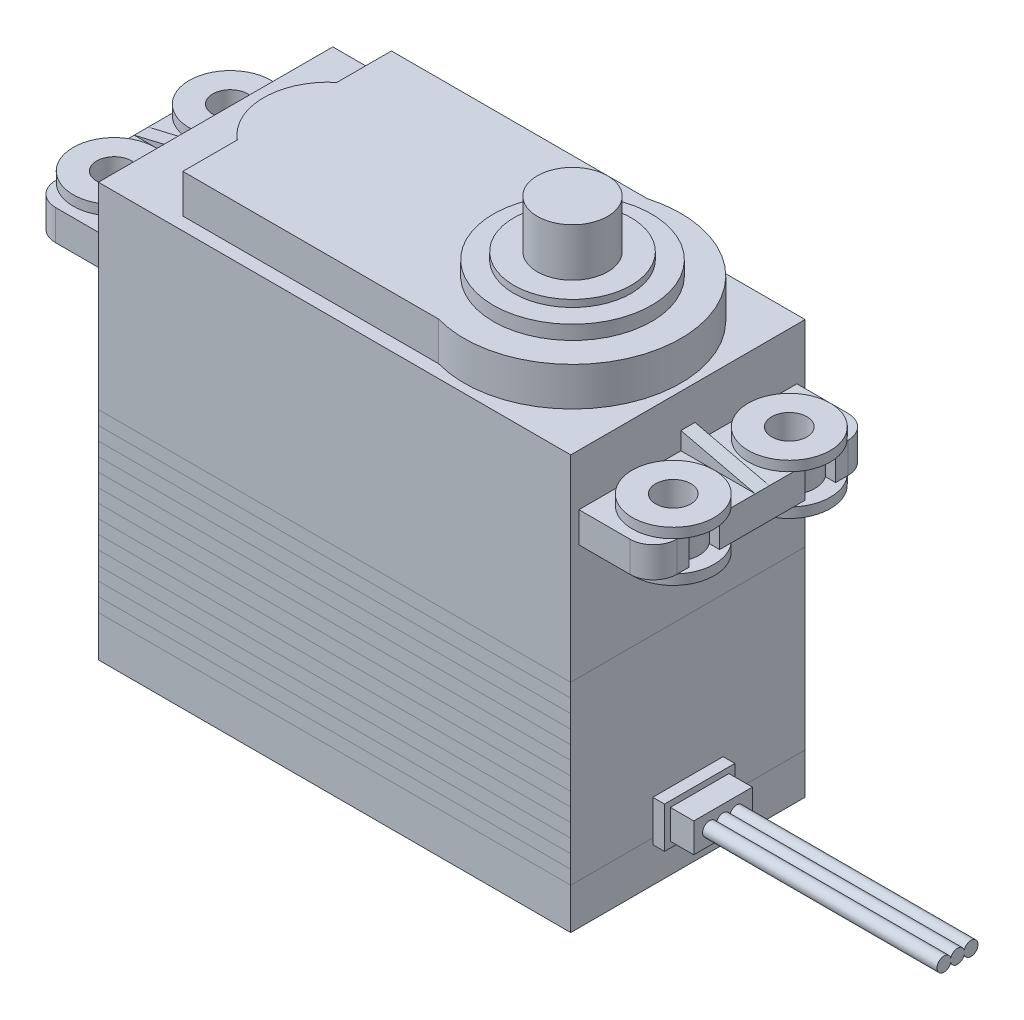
ISO-10303-21;
HEADER;
FILE_DESCRIPTION(('STEP AP214'),'2;1');
FILE_NAME('part.step','',(''),(''),'','','');
FILE_SCHEMA(('AUTOMOTIVE_DESIGN { 1 0 10303 214 1 1 1 1 }'));
ENDSEC;
DATA;
#1=APPLICATION_CONTEXT('core data for automotive mechanical design processes');
#2=APPLICATION_PROTOCOL_DEFINITION('international standard','automotive_design',2000,#1);
#3=PRODUCT_CONTEXT('',#1,'mechanical');
#4=PRODUCT('Part','Part','',(#3));
#5=PRODUCT_RELATED_PRODUCT_CATEGORY('part','',(#4));
#6=PRODUCT_DEFINITION_FORMATION('','',#4);
#7=PRODUCT_DEFINITION_CONTEXT('part definition',#1,'design');
#8=PRODUCT_DEFINITION('design','',#6,#7);
#9=PRODUCT_DEFINITION_SHAPE('','',#8);
#10=(LENGTH_UNIT() NAMED_UNIT(*) SI_UNIT(.MILLI.,.METRE.));
#11=(NAMED_UNIT(*) PLANE_ANGLE_UNIT() SI_UNIT($,.RADIAN.));
#12=(NAMED_UNIT(*) SI_UNIT($,.STERADIAN.) SOLID_ANGLE_UNIT());
#13=UNCERTAINTY_MEASURE_WITH_UNIT(LENGTH_MEASURE(1.E-05),#10,'distance_accuracy_value','');
#14=(GEOMETRIC_REPRESENTATION_CONTEXT(3) GLOBAL_UNCERTAINTY_ASSIGNED_CONTEXT((#13)) GLOBAL_UNIT_ASSIGNED_CONTEXT((#10,
#11,#12)) REPRESENTATION_CONTEXT('',''));
#15=CARTESIAN_POINT('',(0.,0.,0.));
#16=DIRECTION('',(0.,0.,1.));
#17=DIRECTION('',(1.,0.,0.));
#18=AXIS2_PLACEMENT_3D('',#15,#16,#17);
#19=CARTESIAN_POINT('',(43.15,4.75,-1.15));
#20=DIRECTION('',(-1.,0.,0.));
#21=DIRECTION('',(0.,0.,1.));
#22=AXIS2_PLACEMENT_3D('',#19,#20,#21);
#23=CYLINDRICAL_SURFACE('',#22,0.6);
#24=CARTESIAN_POINT('',(23.15,4.75,-1.15));
#25=DIRECTION('',(1.,0.,0.));
#26=DIRECTION('',(0.,0.,-1.));
#27=AXIS2_PLACEMENT_3D('',#24,#25,#26);
#28=CIRCLE('',#27,0.6);
#29=CARTESIAN_POINT('',(23.15,4.57860863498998,-0.575));
#30=VERTEX_POINT('',#29);
#31=CARTESIAN_POINT('',(23.15,4.92139136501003,-0.575));
#32=VERTEX_POINT('',#31);
#33=EDGE_CURVE('E110',#30,#32,#28,.T.);
#34=ORIENTED_EDGE('',*,*,#33,.T.);
#35=DIRECTION('',(-1.,0.,0.));
#36=VECTOR('',#35,1.);
#37=CARTESIAN_POINT('',(43.15,4.92139136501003,-0.575));
#38=LINE('',#37,#36);
#39=CARTESIAN_POINT('',(43.15,4.92139136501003,-0.575));
#40=VERTEX_POINT('',#39);
#41=EDGE_CURVE('E12',#40,#32,#38,.T.);
#42=ORIENTED_EDGE('',*,*,#41,.F.);
#43=CARTESIAN_POINT('',(43.15,4.75,-1.15));
#44=DIRECTION('',(1.,0.,0.));
#45=DIRECTION('',(0.,0.,-1.));
#46=AXIS2_PLACEMENT_3D('',#43,#44,#45);
#47=CIRCLE('',#46,0.6);
#48=CARTESIAN_POINT('',(43.15,4.57860863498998,-0.575));
#49=VERTEX_POINT('',#48);
#50=EDGE_CURVE('E98',#49,#40,#47,.T.);
#51=ORIENTED_EDGE('',*,*,#50,.F.);
#52=DIRECTION('',(-1.,0.,0.));
#53=VECTOR('',#52,1.);
#54=CARTESIAN_POINT('',(43.15,4.57860863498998,-0.575));
#55=LINE('',#54,#53);
#56=EDGE_CURVE('E106',#49,#30,#55,.T.);
#57=ORIENTED_EDGE('',*,*,#56,.T.);
#58=EDGE_LOOP('',(#34,#42,#51,#57));
#59=FACE_BOUND('',#58,.T.);
#60=ADVANCED_FACE('F47',(#59),#23,.T.);
#61=CARTESIAN_POINT('',(43.15,4.75,0.));
#62=DIRECTION('',(-1.,0.,0.));
#63=DIRECTION('',(0.,0.,1.));
#64=AXIS2_PLACEMENT_3D('',#61,#62,#63);
#65=CYLINDRICAL_SURFACE('',#64,0.6);
#66=CARTESIAN_POINT('',(23.15,4.75,0.));
#67=DIRECTION('',(1.,0.,0.));
#68=DIRECTION('',(0.,0.,-1.));
#69=AXIS2_PLACEMENT_3D('',#66,#67,#68);
#70=CIRCLE('',#69,0.6);
#71=CARTESIAN_POINT('',(23.15,4.92139136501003,0.575));
#72=VERTEX_POINT('',#71);
#73=EDGE_CURVE('E102',#32,#72,#70,.T.);
#74=ORIENTED_EDGE('',*,*,#73,.T.);
#75=DIRECTION('',(-1.,0.,0.));
#76=VECTOR('',#75,1.);
#77=CARTESIAN_POINT('',(43.15,4.92139136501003,0.575));
#78=LINE('',#77,#76);
#79=CARTESIAN_POINT('',(43.15,4.92139136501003,0.575));
#80=VERTEX_POINT('',#79);
#81=EDGE_CURVE('E55',#80,#72,#78,.T.);
#82=ORIENTED_EDGE('',*,*,#81,.F.);
#83=CARTESIAN_POINT('',(43.15,4.75,0.));
#84=DIRECTION('',(1.,0.,0.));
#85=DIRECTION('',(0.,0.,-1.));
#86=AXIS2_PLACEMENT_3D('',#83,#84,#85);
#87=CIRCLE('',#86,0.6);
#88=EDGE_CURVE('E93',#40,#80,#87,.T.);
#89=ORIENTED_EDGE('',*,*,#88,.F.);
#90=ORIENTED_EDGE('',*,*,#41,.T.);
#91=EDGE_LOOP('',(#74,#82,#89,#90));
#92=FACE_BOUND('',#91,.T.);
#93=ADVANCED_FACE('F101',(#92),#65,.T.);
#94=CARTESIAN_POINT('',(43.15,4.75,1.15));
#95=DIRECTION('',(-1.,0.,0.));
#96=DIRECTION('',(0.,0.,1.));
#97=AXIS2_PLACEMENT_3D('',#94,#95,#96);
#98=CYLINDRICAL_SURFACE('',#97,0.6);
#99=CARTESIAN_POINT('',(23.15,4.75,1.15));
#100=DIRECTION('',(1.,0.,0.));
#101=DIRECTION('',(0.,0.,-1.));
#102=AXIS2_PLACEMENT_3D('',#99,#100,#101);
#103=CIRCLE('',#102,0.6);
#104=CARTESIAN_POINT('',(23.15,4.57860863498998,0.575));
#105=VERTEX_POINT('',#104);
#106=EDGE_CURVE('E80',#72,#105,#103,.T.);
#107=ORIENTED_EDGE('',*,*,#106,.T.);
#108=DIRECTION('',(-1.,0.,0.));
#109=VECTOR('',#108,1.);
#110=CARTESIAN_POINT('',(43.15,4.57860863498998,0.575));
#111=LINE('',#110,#109);
#112=CARTESIAN_POINT('',(43.15,4.57860863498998,0.575));
#113=VERTEX_POINT('',#112);
#114=EDGE_CURVE('E103',#113,#105,#111,.T.);
#115=ORIENTED_EDGE('',*,*,#114,.F.);
#116=CARTESIAN_POINT('',(43.15,4.75,1.15));
#117=DIRECTION('',(1.,0.,0.));
#118=DIRECTION('',(0.,0.,-1.));
#119=AXIS2_PLACEMENT_3D('',#116,#117,#118);
#120=CIRCLE('',#119,0.6);
#121=EDGE_CURVE('E96',#80,#113,#120,.T.);
#122=ORIENTED_EDGE('',*,*,#121,.F.);
#123=ORIENTED_EDGE('',*,*,#81,.T.);
#124=EDGE_LOOP('',(#107,#115,#122,#123));
#125=FACE_BOUND('',#124,.T.);
#126=ADVANCED_FACE('F104',(#125),#98,.T.);
#127=CARTESIAN_POINT('',(43.15,4.75,0.));
#128=DIRECTION('',(-1.,0.,0.));
#129=DIRECTION('',(0.,0.,1.));
#130=AXIS2_PLACEMENT_3D('',#127,#128,#129);
#131=CYLINDRICAL_SURFACE('',#130,0.6);
#132=CARTESIAN_POINT('',(23.15,4.75,0.));
#133=DIRECTION('',(1.,0.,0.));
#134=DIRECTION('',(0.,0.,-1.));
#135=AXIS2_PLACEMENT_3D('',#132,#133,#134);
#136=CIRCLE('',#135,0.6);
#137=EDGE_CURVE('E86',#105,#30,#136,.T.);
#138=ORIENTED_EDGE('',*,*,#137,.T.);
#139=ORIENTED_EDGE('',*,*,#56,.F.);
#140=CARTESIAN_POINT('',(43.15,4.75,0.));
#141=DIRECTION('',(1.,0.,0.));
#142=DIRECTION('',(0.,0.,-1.));
#143=AXIS2_PLACEMENT_3D('',#140,#141,#142);
#144=CIRCLE('',#143,0.6);
#145=EDGE_CURVE('E63',#113,#49,#144,.T.);
#146=ORIENTED_EDGE('',*,*,#145,.F.);
#147=ORIENTED_EDGE('',*,*,#114,.T.);
#148=EDGE_LOOP('',(#138,#139,#146,#147));
#149=FACE_BOUND('',#148,.T.);
#150=ADVANCED_FACE('F117',(#149),#131,.T.);
#151=CARTESIAN_POINT('',(43.15,4.75,-0.575));
#152=DIRECTION('',(1.,0.,0.));
#153=DIRECTION('',(0.,0.,-1.));
#154=AXIS2_PLACEMENT_3D('',#151,#152,#153);
#155=PLANE('',#154);
#156=ORIENTED_EDGE('',*,*,#50,.T.);
#157=ORIENTED_EDGE('',*,*,#88,.T.);
#158=ORIENTED_EDGE('',*,*,#121,.T.);
#159=ORIENTED_EDGE('',*,*,#145,.T.);
#160=EDGE_LOOP('',(#156,#157,#158,#159));
#161=FACE_BOUND('',#160,.T.);
#162=ADVANCED_FACE('F94',(#161),#155,.T.);
#163=CARTESIAN_POINT('',(23.15,4.75,-0.575));
#164=DIRECTION('',(1.,0.,0.));
#165=DIRECTION('',(0.,0.,-1.));
#166=AXIS2_PLACEMENT_3D('',#163,#164,#165);
#167=PLANE('',#166);
#168=ORIENTED_EDGE('',*,*,#33,.F.);
#169=ORIENTED_EDGE('',*,*,#137,.F.);
#170=ORIENTED_EDGE('',*,*,#106,.F.);
#171=ORIENTED_EDGE('',*,*,#73,.F.);
#172=EDGE_LOOP('',(#168,#169,#170,#171));
#173=FACE_BOUND('',#172,.T.);
#174=ADVANCED_FACE('F120',(#173),#167,.F.);
#175=CLOSED_SHELL('',(#60,#93,#126,#150,#162,#174));
#176=MANIFOLD_SOLID_BREP('B2',#175);
#177=CARTESIAN_POINT('',(10.3,97.4852813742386,0.));
#178=DIRECTION('',(0.,-1.,0.));
#179=DIRECTION('',(0.,0.,-1.));
#180=AXIS2_PLACEMENT_3D('',#177,#178,#179);
#181=CYLINDRICAL_SURFACE('',#180,3.);
#182=CARTESIAN_POINT('',(10.3,40.4,0.));
#183=DIRECTION('',(0.,1.,0.));
#184=DIRECTION('',(0.,0.,1.));
#185=AXIS2_PLACEMENT_3D('',#182,#183,#184);
#186=CIRCLE('',#185,3.);
#187=CARTESIAN_POINT('',(10.3,40.4,3.));
#188=VERTEX_POINT('',#187);
#189=EDGE_CURVE('E195',#188,#188,#186,.T.);
#190=ORIENTED_EDGE('',*,*,#189,.T.);
#191=EDGE_LOOP('',(#190));
#192=FACE_BOUND('',#191,.T.);
#193=CARTESIAN_POINT('',(10.3,44.5,0.));
#194=DIRECTION('',(0.,1.,0.));
#195=DIRECTION('',(0.,0.,1.));
#196=AXIS2_PLACEMENT_3D('',#193,#194,#195);
#197=CIRCLE('',#196,3.);
#198=CARTESIAN_POINT('',(10.3,44.5,3.));
#199=VERTEX_POINT('',#198);
#200=EDGE_CURVE('E46',#199,#199,#197,.T.);
#201=ORIENTED_EDGE('',*,*,#200,.F.);
#202=EDGE_LOOP('',(#201));
#203=FACE_BOUND('',#202,.T.);
#204=ADVANCED_FACE('F188',(#192,#203),#181,.T.);
#205=CARTESIAN_POINT('',(10.3,40.4,0.));
#206=DIRECTION('',(0.,1.,0.));
#207=DIRECTION('',(0.,0.,1.));
#208=AXIS2_PLACEMENT_3D('',#205,#206,#207);
#209=PLANE('',#208);
#210=ORIENTED_EDGE('',*,*,#189,.F.);
#211=EDGE_LOOP('',(#210));
#212=FACE_BOUND('',#211,.T.);
#213=ADVANCED_FACE('F203',(#212),#209,.F.);
#214=CARTESIAN_POINT('',(0.,44.5,0.));
#215=DIRECTION('',(0.,1.,0.));
#216=DIRECTION('',(0.,0.,1.));
#217=AXIS2_PLACEMENT_3D('',#214,#215,#216);
#218=PLANE('',#217);
#219=ORIENTED_EDGE('',*,*,#200,.T.);
#220=EDGE_LOOP('',(#219));
#221=FACE_BOUND('',#220,.T.);
#222=ADVANCED_FACE('F190',(#221),#218,.T.);
#223=CLOSED_SHELL('',(#204,#213,#222));
#224=MANIFOLD_SOLID_BREP('B6',#223);
#225=CARTESIAN_POINT('',(21.15,0.,0.));
#226=DIRECTION('',(1.,0.,0.));
#227=DIRECTION('',(0.,0.,-1.));
#228=AXIS2_PLACEMENT_3D('',#225,#226,#227);
#229=PLANE('',#228);
#230=DIRECTION('',(0.,-1.,0.));
#231=VECTOR('',#230,1.);
#232=CARTESIAN_POINT('',(21.15,6.5,3.));
#233=LINE('',#232,#231);
#234=CARTESIAN_POINT('',(21.15,6.5,3.));
#235=VERTEX_POINT('',#234);
#236=CARTESIAN_POINT('',(21.15,3.,3.));
#237=VERTEX_POINT('',#236);
#238=EDGE_CURVE('E812',#235,#237,#233,.T.);
#239=ORIENTED_EDGE('',*,*,#238,.T.);
#240=DIRECTION('',(0.,0.,-1.));
#241=VECTOR('',#240,1.);
#242=CARTESIAN_POINT('',(21.15,3.,3.));
#243=LINE('',#242,#241);
#244=CARTESIAN_POINT('',(21.15,3.,-3.));
#245=VERTEX_POINT('',#244);
#246=EDGE_CURVE('E815',#237,#245,#243,.T.);
#247=ORIENTED_EDGE('',*,*,#246,.T.);
#248=DIRECTION('',(0.,1.,0.));
#249=VECTOR('',#248,1.);
#250=CARTESIAN_POINT('',(21.15,6.5,-3.));
#251=LINE('',#250,#249);
#252=CARTESIAN_POINT('',(21.15,6.5,-3.));
#253=VERTEX_POINT('',#252);
#254=EDGE_CURVE('E818',#245,#253,#251,.T.);
#255=ORIENTED_EDGE('',*,*,#254,.T.);
#256=DIRECTION('',(0.,0.,1.));
#257=VECTOR('',#256,1.);
#258=CARTESIAN_POINT('',(21.15,6.5,3.));
#259=LINE('',#258,#257);
#260=EDGE_CURVE('E820',#253,#235,#259,.T.);
#261=ORIENTED_EDGE('',*,*,#260,.T.);
#262=EDGE_LOOP('',(#239,#247,#255,#261));
#263=FACE_BOUND('',#262,.T.);
#264=DIRECTION('',(0.,-1.,0.));
#265=VECTOR('',#264,1.);
#266=CARTESIAN_POINT('',(21.15,6.,2.5));
#267=LINE('',#266,#265);
#268=CARTESIAN_POINT('',(21.15,6.,2.5));
#269=VERTEX_POINT('',#268);
#270=CARTESIAN_POINT('',(21.15,3.5,2.5));
#271=VERTEX_POINT('',#270);
#272=EDGE_CURVE('E2796',#269,#271,#267,.T.);
#273=ORIENTED_EDGE('',*,*,#272,.F.);
#274=DIRECTION('',(0.,0.,1.));
#275=VECTOR('',#274,1.);
#276=CARTESIAN_POINT('',(21.15,6.,-2.5));
#277=LINE('',#276,#275);
#278=CARTESIAN_POINT('',(21.15,6.,-2.5));
#279=VERTEX_POINT('',#278);
#280=EDGE_CURVE('E803',#279,#269,#277,.T.);
#281=ORIENTED_EDGE('',*,*,#280,.F.);
#282=DIRECTION('',(0.,1.,0.));
#283=VECTOR('',#282,1.);
#284=CARTESIAN_POINT('',(21.15,3.5,-2.5));
#285=LINE('',#284,#283);
#286=CARTESIAN_POINT('',(21.15,3.5,-2.5));
#287=VERTEX_POINT('',#286);
#288=EDGE_CURVE('E799',#287,#279,#285,.T.);
#289=ORIENTED_EDGE('',*,*,#288,.F.);
#290=DIRECTION('',(0.,0.,-1.));
#291=VECTOR('',#290,1.);
#292=CARTESIAN_POINT('',(21.15,3.5,2.5));
#293=LINE('',#292,#291);
#294=EDGE_CURVE('E2793',#271,#287,#293,.T.);
#295=ORIENTED_EDGE('',*,*,#294,.F.);
#296=EDGE_LOOP('',(#273,#281,#289,#295));
#297=FACE_BOUND('',#296,.T.);
#298=ADVANCED_FACE('F229',(#263,#297),#229,.T.);
#299=CARTESIAN_POINT('',(20.15,35.3,-10.));
#300=DIRECTION('',(-1.,0.,0.));
#301=DIRECTION('',(0.,0.,1.));
#302=AXIS2_PLACEMENT_3D('',#299,#300,#301);
#303=PLANE('',#302);
#304=DIRECTION('',(0.,-1.,0.));
#305=VECTOR('',#304,1.);
#306=CARTESIAN_POINT('',(20.15,6.5,3.));
#307=LINE('',#306,#305);
#308=CARTESIAN_POINT('',(20.15,3.5,3.));
#309=VERTEX_POINT('',#308);
#310=CARTESIAN_POINT('',(20.15,3.00000000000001,3.));
#311=VERTEX_POINT('',#310);
#312=EDGE_CURVE('E805',#309,#311,#307,.T.);
#313=ORIENTED_EDGE('',*,*,#312,.F.);
#314=DIRECTION('',(0.,0.,-1.));
#315=VECTOR('',#314,1.);
#316=CARTESIAN_POINT('',(20.15,3.5,-10.));
#317=LINE('',#316,#315);
#318=CARTESIAN_POINT('',(20.15,3.5,10.));
#319=VERTEX_POINT('',#318);
#320=EDGE_CURVE('E1326',#319,#309,#317,.T.);
#321=ORIENTED_EDGE('',*,*,#320,.F.);
#322=DIRECTION('',(0.,-1.,0.));
#323=VECTOR('',#322,1.);
#324=CARTESIAN_POINT('',(20.15,35.3,10.));
#325=LINE('',#324,#323);
#326=CARTESIAN_POINT('',(20.15,0.,10.));
#327=VERTEX_POINT('',#326);
#328=EDGE_CURVE('E1248',#319,#327,#325,.T.);
#329=ORIENTED_EDGE('',*,*,#328,.T.);
#330=DIRECTION('',(0.,0.,-1.));
#331=VECTOR('',#330,1.);
#332=CARTESIAN_POINT('',(20.15,0.,-10.));
#333=LINE('',#332,#331);
#334=CARTESIAN_POINT('',(20.15,0.,-10.));
#335=VERTEX_POINT('',#334);
#336=EDGE_CURVE('E1225',#327,#335,#333,.T.);
#337=ORIENTED_EDGE('',*,*,#336,.T.);
#338=DIRECTION('',(0.,-1.,0.));
#339=VECTOR('',#338,1.);
#340=CARTESIAN_POINT('',(20.15,35.3,-10.));
#341=LINE('',#340,#339);
#342=CARTESIAN_POINT('',(20.15,3.5,-10.));
#343=VERTEX_POINT('',#342);
#344=EDGE_CURVE('E1274',#343,#335,#341,.T.);
#345=ORIENTED_EDGE('',*,*,#344,.F.);
#346=CARTESIAN_POINT('',(20.15,3.5,-3.));
#347=VERTEX_POINT('',#346);
#348=EDGE_CURVE('E1324',#347,#343,#317,.T.);
#349=ORIENTED_EDGE('',*,*,#348,.F.);
#350=DIRECTION('',(0.,1.,0.));
#351=VECTOR('',#350,1.);
#352=CARTESIAN_POINT('',(20.15,6.5,-3.));
#353=LINE('',#352,#351);
#354=CARTESIAN_POINT('',(20.15,3.,-3.));
#355=VERTEX_POINT('',#354);
#356=EDGE_CURVE('E825',#355,#347,#353,.T.);
#357=ORIENTED_EDGE('',*,*,#356,.F.);
#358=DIRECTION('',(0.,0.,-1.));
#359=VECTOR('',#358,1.);
#360=CARTESIAN_POINT('',(20.15,3.,3.));
#361=LINE('',#360,#359);
#362=EDGE_CURVE('E252',#311,#355,#361,.T.);
#363=ORIENTED_EDGE('',*,*,#362,.F.);
#364=EDGE_LOOP('',(#313,#321,#329,#337,#345,#349,#357,#363));
#365=FACE_BOUND('',#364,.T.);
#366=ADVANCED_FACE('F1488',(#365),#303,.F.);
#367=CARTESIAN_POINT('',(20.15,6.5,3.));
#368=VERTEX_POINT('',#367);
#369=EDGE_CURVE('E807',#368,#309,#307,.T.);
#370=ORIENTED_EDGE('',*,*,#369,.F.);
#371=DIRECTION('',(0.,0.,1.));
#372=VECTOR('',#371,1.);
#373=CARTESIAN_POINT('',(20.15,6.5,3.));
#374=LINE('',#373,#372);
#375=CARTESIAN_POINT('',(20.15,6.5,-3.));
#376=VERTEX_POINT('',#375);
#377=EDGE_CURVE('E816',#376,#368,#374,.T.);
#378=ORIENTED_EDGE('',*,*,#377,.F.);
#379=DIRECTION('',(0.,1.,0.));
#380=VECTOR('',#379,1.);
#381=CARTESIAN_POINT('',(20.15,35.3,-3.00000000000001));
#382=LINE('',#381,#380);
#383=EDGE_CURVE('E186',#347,#376,#382,.T.);
#384=ORIENTED_EDGE('',*,*,#383,.F.);
#385=ORIENTED_EDGE('',*,*,#348,.T.);
#386=CARTESIAN_POINT('',(20.15,4.675,-10.));
#387=VERTEX_POINT('',#386);
#388=EDGE_CURVE('E1282',#387,#343,#341,.T.);
#389=ORIENTED_EDGE('',*,*,#388,.F.);
#390=CARTESIAN_POINT('',(20.15,5.825,-10.));
#391=VERTEX_POINT('',#390);
#392=EDGE_CURVE('E1435',#391,#387,#341,.T.);
#393=ORIENTED_EDGE('',*,*,#392,.F.);
#394=CARTESIAN_POINT('',(20.15,6.975,-10.));
#395=VERTEX_POINT('',#394);
#396=EDGE_CURVE('E1439',#395,#391,#341,.T.);
#397=ORIENTED_EDGE('',*,*,#396,.F.);
#398=CARTESIAN_POINT('',(20.15,8.125,-10.));
#399=VERTEX_POINT('',#398);
#400=EDGE_CURVE('E1440',#399,#395,#341,.T.);
#401=ORIENTED_EDGE('',*,*,#400,.F.);
#402=CARTESIAN_POINT('',(20.15,9.275,-10.));
#403=VERTEX_POINT('',#402);
#404=EDGE_CURVE('E1443',#403,#399,#341,.T.);
#405=ORIENTED_EDGE('',*,*,#404,.F.);
#406=CARTESIAN_POINT('',(20.15,10.425,-10.));
#407=VERTEX_POINT('',#406);
#408=EDGE_CURVE('E1447',#407,#403,#341,.T.);
#409=ORIENTED_EDGE('',*,*,#408,.F.);
#410=CARTESIAN_POINT('',(20.15,11.575,-10.));
#411=VERTEX_POINT('',#410);
#412=EDGE_CURVE('E1451',#411,#407,#341,.T.);
#413=ORIENTED_EDGE('',*,*,#412,.F.);
#414=CARTESIAN_POINT('',(20.15,12.725,-10.));
#415=VERTEX_POINT('',#414);
#416=EDGE_CURVE('E1455',#415,#411,#341,.T.);
#417=ORIENTED_EDGE('',*,*,#416,.F.);
#418=CARTESIAN_POINT('',(20.15,13.875,-10.));
#419=VERTEX_POINT('',#418);
#420=EDGE_CURVE('E1459',#419,#415,#341,.T.);
#421=ORIENTED_EDGE('',*,*,#420,.F.);
#422=CARTESIAN_POINT('',(20.15,15.025,-10.));
#423=VERTEX_POINT('',#422);
#424=EDGE_CURVE('E1463',#423,#419,#341,.T.);
#425=ORIENTED_EDGE('',*,*,#424,.F.);
#426=CARTESIAN_POINT('',(20.15,16.175,-10.));
#427=VERTEX_POINT('',#426);
#428=EDGE_CURVE('E1467',#427,#423,#341,.T.);
#429=ORIENTED_EDGE('',*,*,#428,.F.);
#430=CARTESIAN_POINT('',(20.15,17.325,-10.));
#431=VERTEX_POINT('',#430);
#432=EDGE_CURVE('E1471',#431,#427,#341,.T.);
#433=ORIENTED_EDGE('',*,*,#432,.F.);
#434=CARTESIAN_POINT('',(20.15,18.5,-10.));
#435=VERTEX_POINT('',#434);
#436=EDGE_CURVE('E1281',#435,#431,#341,.T.);
#437=ORIENTED_EDGE('',*,*,#436,.F.);
#438=DIRECTION('',(0.,0.,1.));
#439=VECTOR('',#438,1.);
#440=CARTESIAN_POINT('',(20.15,18.5,-10.));
#441=LINE('',#440,#439);
#442=CARTESIAN_POINT('',(20.15,18.5,10.));
#443=VERTEX_POINT('',#442);
#444=EDGE_CURVE('E1321',#435,#443,#441,.T.);
#445=ORIENTED_EDGE('',*,*,#444,.T.);
#446=CARTESIAN_POINT('',(20.15,17.325,10.));
#447=VERTEX_POINT('',#446);
#448=EDGE_CURVE('E1263',#443,#447,#325,.T.);
#449=ORIENTED_EDGE('',*,*,#448,.T.);
#450=CARTESIAN_POINT('',(20.15,16.175,10.));
#451=VERTEX_POINT('',#450);
#452=EDGE_CURVE('E1493',#447,#451,#325,.T.);
#453=ORIENTED_EDGE('',*,*,#452,.T.);
#454=CARTESIAN_POINT('',(20.15,15.025,10.));
#455=VERTEX_POINT('',#454);
#456=EDGE_CURVE('E2134',#451,#455,#325,.T.);
#457=ORIENTED_EDGE('',*,*,#456,.T.);
#458=CARTESIAN_POINT('',(20.15,13.875,10.));
#459=VERTEX_POINT('',#458);
#460=EDGE_CURVE('E2135',#455,#459,#325,.T.);
#461=ORIENTED_EDGE('',*,*,#460,.T.);
#462=CARTESIAN_POINT('',(20.15,12.725,10.));
#463=VERTEX_POINT('',#462);
#464=EDGE_CURVE('E2138',#459,#463,#325,.T.);
#465=ORIENTED_EDGE('',*,*,#464,.T.);
#466=CARTESIAN_POINT('',(20.15,11.575,10.));
#467=VERTEX_POINT('',#466);
#468=EDGE_CURVE('E2141',#463,#467,#325,.T.);
#469=ORIENTED_EDGE('',*,*,#468,.T.);
#470=CARTESIAN_POINT('',(20.15,10.425,10.));
#471=VERTEX_POINT('',#470);
#472=EDGE_CURVE('E2144',#467,#471,#325,.T.);
#473=ORIENTED_EDGE('',*,*,#472,.T.);
#474=CARTESIAN_POINT('',(20.15,9.275,10.));
#475=VERTEX_POINT('',#474);
#476=EDGE_CURVE('E2147',#471,#475,#325,.T.);
#477=ORIENTED_EDGE('',*,*,#476,.T.);
#478=CARTESIAN_POINT('',(20.15,8.125,10.));
#479=VERTEX_POINT('',#478);
#480=EDGE_CURVE('E2150',#475,#479,#325,.T.);
#481=ORIENTED_EDGE('',*,*,#480,.T.);
#482=CARTESIAN_POINT('',(20.15,6.975,10.));
#483=VERTEX_POINT('',#482);
#484=EDGE_CURVE('E2153',#479,#483,#325,.T.);
#485=ORIENTED_EDGE('',*,*,#484,.T.);
#486=CARTESIAN_POINT('',(20.15,5.825,10.));
#487=VERTEX_POINT('',#486);
#488=EDGE_CURVE('E2156',#483,#487,#325,.T.);
#489=ORIENTED_EDGE('',*,*,#488,.T.);
#490=CARTESIAN_POINT('',(20.15,4.675,10.));
#491=VERTEX_POINT('',#490);
#492=EDGE_CURVE('E2159',#487,#491,#325,.T.);
#493=ORIENTED_EDGE('',*,*,#492,.T.);
#494=EDGE_CURVE('E1264',#491,#319,#325,.T.);
#495=ORIENTED_EDGE('',*,*,#494,.T.);
#496=ORIENTED_EDGE('',*,*,#320,.T.);
#497=EDGE_LOOP('',(#370,#378,#384,#385,#389,#393,#397,#401,#405,#409,#413,#417,#421,#425,#429,
#433,#437,#445,#449,#453,#457,#461,#465,#469,#473,#477,#481,#485,#489,#493,#495,#496));
#498=FACE_BOUND('',#497,.T.);
#499=ADVANCED_FACE('F1433',(#498),#303,.F.);
#500=CARTESIAN_POINT('',(23.85,28.3,-4.95));
#501=DIRECTION('',(0.,-1.,0.));
#502=DIRECTION('',(0.,0.,-1.));
#503=AXIS2_PLACEMENT_3D('',#500,#501,#502);
#504=PLANE('',#503);
#505=DIRECTION('',(0.,0.,1.));
#506=VECTOR('',#505,1.);
#507=CARTESIAN_POINT('',(26.5,28.3,-9.3));
#508=LINE('',#507,#506);
#509=CARTESIAN_POINT('',(26.5,28.3,-7.3));
#510=VERTEX_POINT('',#509);
#511=CARTESIAN_POINT('',(26.5,28.3,-7.23637267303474));
#512=VERTEX_POINT('',#511);
#513=EDGE_CURVE('E1149',#510,#512,#508,.T.);
#514=ORIENTED_EDGE('',*,*,#513,.T.);
#515=CARTESIAN_POINT('',(23.85,28.3,-4.95));
#516=DIRECTION('',(0.,-1.,0.));
#517=DIRECTION('',(0.,0.,-1.));
#518=AXIS2_PLACEMENT_3D('',#515,#516,#517);
#519=CIRCLE('',#518,3.5);
#520=CARTESIAN_POINT('',(26.5,28.3,-2.66362732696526));
#521=VERTEX_POINT('',#520);
#522=EDGE_CURVE('E847',#521,#512,#519,.T.);
#523=ORIENTED_EDGE('',*,*,#522,.F.);
#524=DIRECTION('',(0.,0.,1.));
#525=VECTOR('',#524,1.);
#526=CARTESIAN_POINT('',(26.5,28.3,-3.65));
#527=LINE('',#526,#525);
#528=CARTESIAN_POINT('',(26.5,28.3,2.66362732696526));
#529=VERTEX_POINT('',#528);
#530=EDGE_CURVE('E1204',#521,#529,#527,.T.);
#531=ORIENTED_EDGE('',*,*,#530,.T.);
#532=CARTESIAN_POINT('',(23.85,28.3,4.95));
#533=DIRECTION('',(0.,-1.,0.));
#534=DIRECTION('',(0.,0.,-1.));
#535=AXIS2_PLACEMENT_3D('',#532,#533,#534);
#536=CIRCLE('',#535,3.5);
#537=CARTESIAN_POINT('',(26.5,28.3,7.23637267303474));
#538=VERTEX_POINT('',#537);
#539=EDGE_CURVE('E877',#538,#529,#536,.T.);
#540=ORIENTED_EDGE('',*,*,#539,.F.);
#541=DIRECTION('',(0.,0.,1.));
#542=VECTOR('',#541,1.);
#543=CARTESIAN_POINT('',(26.5,28.3,6.25));
#544=LINE('',#543,#542);
#545=CARTESIAN_POINT('',(26.5,28.3,7.3));
#546=VERTEX_POINT('',#545);
#547=EDGE_CURVE('E1212',#538,#546,#544,.T.);
#548=ORIENTED_EDGE('',*,*,#547,.T.);
#549=CARTESIAN_POINT('',(24.5,28.3,7.3));
#550=DIRECTION('',(0.,-1.,0.));
#551=DIRECTION('',(0.,0.,-1.));
#552=AXIS2_PLACEMENT_3D('',#549,#550,#551);
#553=CIRCLE('',#552,2.);
#554=CARTESIAN_POINT('',(24.5,28.3,9.3));
#555=VERTEX_POINT('',#554);
#556=EDGE_CURVE('E1285',#546,#555,#553,.T.);
#557=ORIENTED_EDGE('',*,*,#556,.T.);
#558=DIRECTION('',(-1.,0.,0.));
#559=VECTOR('',#558,1.);
#560=CARTESIAN_POINT('',(26.5,28.3,9.3));
#561=LINE('',#560,#559);
#562=CARTESIAN_POINT('',(20.15,28.3,9.3));
#563=VERTEX_POINT('',#562);
#564=EDGE_CURVE('E1216',#555,#563,#561,.T.);
#565=ORIENTED_EDGE('',*,*,#564,.T.);
#566=DIRECTION('',(0.,0.,-1.));
#567=VECTOR('',#566,1.);
#568=CARTESIAN_POINT('',(20.15,28.3,-9.3));
#569=LINE('',#568,#567);
#570=CARTESIAN_POINT('',(20.15,28.3,-9.3));
#571=VERTEX_POINT('',#570);
#572=EDGE_CURVE('E1218',#563,#571,#569,.T.);
#573=ORIENTED_EDGE('',*,*,#572,.T.);
#574=DIRECTION('',(1.,0.,0.));
#575=VECTOR('',#574,1.);
#576=CARTESIAN_POINT('',(26.5,28.3,-9.3));
#577=LINE('',#576,#575);
#578=CARTESIAN_POINT('',(24.5,28.3,-9.3));
#579=VERTEX_POINT('',#578);
#580=EDGE_CURVE('E1167',#571,#579,#577,.T.);
#581=ORIENTED_EDGE('',*,*,#580,.T.);
#582=CARTESIAN_POINT('',(24.5,28.3,-7.3));
#583=DIRECTION('',(0.,-1.,0.));
#584=DIRECTION('',(0.,0.,-1.));
#585=AXIS2_PLACEMENT_3D('',#582,#583,#584);
#586=CIRCLE('',#585,2.);
#587=EDGE_CURVE('E1287',#579,#510,#586,.T.);
#588=ORIENTED_EDGE('',*,*,#587,.T.);
#589=EDGE_LOOP('',(#514,#523,#531,#540,#548,#557,#565,#573,#581,#588));
#590=FACE_BOUND('',#589,.T.);
#591=ADVANCED_FACE('F1905',(#590),#504,.T.);
#592=CARTESIAN_POINT('',(23.85,30.9,-4.95));
#593=DIRECTION('',(0.,-1.,0.));
#594=DIRECTION('',(0.,0.,-1.));
#595=AXIS2_PLACEMENT_3D('',#592,#593,#594);
#596=PLANE('',#595);
#597=CARTESIAN_POINT('',(23.85,30.9,-4.95));
#598=DIRECTION('',(0.,-1.,0.));
#599=DIRECTION('',(0.,0.,-1.));
#600=AXIS2_PLACEMENT_3D('',#597,#598,#599);
#601=CIRCLE('',#600,3.5);
#602=CARTESIAN_POINT('',(26.5,30.9,-2.66362732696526));
#603=VERTEX_POINT('',#602);
#604=CARTESIAN_POINT('',(26.5,30.9,-7.23637267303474));
#605=VERTEX_POINT('',#604);
#606=EDGE_CURVE('E863',#603,#605,#601,.T.);
#607=ORIENTED_EDGE('',*,*,#606,.T.);
#608=DIRECTION('',(0.,0.,1.));
#609=VECTOR('',#608,1.);
#610=CARTESIAN_POINT('',(26.5,30.9,-9.3));
#611=LINE('',#610,#609);
#612=CARTESIAN_POINT('',(26.5,30.9,-7.3));
#613=VERTEX_POINT('',#612);
#614=EDGE_CURVE('E1163',#613,#605,#611,.T.);
#615=ORIENTED_EDGE('',*,*,#614,.F.);
#616=CARTESIAN_POINT('',(24.5,30.9,-7.3));
#617=DIRECTION('',(0.,-1.,0.));
#618=DIRECTION('',(0.,0.,-1.));
#619=AXIS2_PLACEMENT_3D('',#616,#617,#618);
#620=CIRCLE('',#619,2.);
#621=CARTESIAN_POINT('',(24.5,30.9,-9.3));
#622=VERTEX_POINT('',#621);
#623=EDGE_CURVE('E1291',#613,#622,#620,.F.);
#624=ORIENTED_EDGE('',*,*,#623,.T.);
#625=DIRECTION('',(1.,0.,0.));
#626=VECTOR('',#625,1.);
#627=CARTESIAN_POINT('',(26.5,30.9,-9.3));
#628=LINE('',#627,#626);
#629=CARTESIAN_POINT('',(20.15,30.9,-9.3));
#630=VERTEX_POINT('',#629);
#631=EDGE_CURVE('E1192',#630,#622,#628,.T.);
#632=ORIENTED_EDGE('',*,*,#631,.F.);
#633=DIRECTION('',(0.,0.,-1.));
#634=VECTOR('',#633,1.);
#635=CARTESIAN_POINT('',(20.15,30.9,-9.3));
#636=LINE('',#635,#634);
#637=CARTESIAN_POINT('',(20.15,30.9,-0.6));
#638=VERTEX_POINT('',#637);
#639=EDGE_CURVE('E1188',#638,#630,#636,.T.);
#640=ORIENTED_EDGE('',*,*,#639,.F.);
#641=DIRECTION('',(1.,0.,0.));
#642=VECTOR('',#641,1.);
#643=CARTESIAN_POINT('',(26.5,30.9,-0.6));
#644=LINE('',#643,#642);
#645=CARTESIAN_POINT('',(26.5,30.9,-0.600000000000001));
#646=VERTEX_POINT('',#645);
#647=EDGE_CURVE('E1048',#638,#646,#644,.T.);
#648=ORIENTED_EDGE('',*,*,#647,.T.);
#649=DIRECTION('',(0.,0.,1.));
#650=VECTOR('',#649,1.);
#651=CARTESIAN_POINT('',(26.5,30.9,-3.65));
#652=LINE('',#651,#650);
#653=EDGE_CURVE('E1176',#603,#646,#652,.T.);
#654=ORIENTED_EDGE('',*,*,#653,.F.);
#655=EDGE_LOOP('',(#607,#615,#624,#632,#640,#648,#654));
#656=FACE_BOUND('',#655,.T.);
#657=ADVANCED_FACE('F1903',(#656),#596,.F.);
#658=CARTESIAN_POINT('',(23.85,30.9,4.95));
#659=DIRECTION('',(0.,-1.,0.));
#660=DIRECTION('',(0.,0.,-1.));
#661=AXIS2_PLACEMENT_3D('',#658,#659,#660);
#662=CIRCLE('',#661,3.5);
#663=CARTESIAN_POINT('',(26.5,30.9,7.23637267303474));
#664=VERTEX_POINT('',#663);
#665=CARTESIAN_POINT('',(26.5,30.9,2.66362732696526));
#666=VERTEX_POINT('',#665);
#667=EDGE_CURVE('E892',#664,#666,#662,.T.);
#668=ORIENTED_EDGE('',*,*,#667,.T.);
#669=CARTESIAN_POINT('',(26.5,30.9,0.599999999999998));
#670=VERTEX_POINT('',#669);
#671=EDGE_CURVE('E1171',#670,#666,#652,.T.);
#672=ORIENTED_EDGE('',*,*,#671,.F.);
#673=DIRECTION('',(1.,0.,0.));
#674=VECTOR('',#673,1.);
#675=CARTESIAN_POINT('',(26.5,30.9,0.6));
#676=LINE('',#675,#674);
#677=CARTESIAN_POINT('',(20.15,30.9,0.6));
#678=VERTEX_POINT('',#677);
#679=EDGE_CURVE('E1051',#678,#670,#676,.T.);
#680=ORIENTED_EDGE('',*,*,#679,.F.);
#681=CARTESIAN_POINT('',(20.15,30.9,9.30000000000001));
#682=VERTEX_POINT('',#681);
#683=EDGE_CURVE('E1189',#682,#678,#636,.T.);
#684=ORIENTED_EDGE('',*,*,#683,.F.);
#685=DIRECTION('',(-1.,0.,0.));
#686=VECTOR('',#685,1.);
#687=CARTESIAN_POINT('',(26.5,30.9,9.3));
#688=LINE('',#687,#686);
#689=CARTESIAN_POINT('',(24.5,30.9,9.3));
#690=VERTEX_POINT('',#689);
#691=EDGE_CURVE('E1186',#690,#682,#688,.T.);
#692=ORIENTED_EDGE('',*,*,#691,.F.);
#693=CARTESIAN_POINT('',(24.5,30.9,7.3));
#694=DIRECTION('',(0.,-1.,0.));
#695=DIRECTION('',(0.,0.,-1.));
#696=AXIS2_PLACEMENT_3D('',#693,#694,#695);
#697=CIRCLE('',#696,2.);
#698=CARTESIAN_POINT('',(26.5,30.9,7.3));
#699=VERTEX_POINT('',#698);
#700=EDGE_CURVE('E1298',#690,#699,#697,.F.);
#701=ORIENTED_EDGE('',*,*,#700,.T.);
#702=DIRECTION('',(0.,0.,1.));
#703=VECTOR('',#702,1.);
#704=CARTESIAN_POINT('',(26.5,30.9,6.25));
#705=LINE('',#704,#703);
#706=EDGE_CURVE('E1182',#664,#699,#705,.T.);
#707=ORIENTED_EDGE('',*,*,#706,.F.);
#708=EDGE_LOOP('',(#668,#672,#680,#684,#692,#701,#707));
#709=FACE_BOUND('',#708,.T.);
#710=ADVANCED_FACE('F1863',(#709),#596,.F.);
#711=CARTESIAN_POINT('',(-23.85,28.3,-4.95));
#712=DIRECTION('',(0.,-1.,0.));
#713=DIRECTION('',(0.,0.,-1.));
#714=AXIS2_PLACEMENT_3D('',#711,#712,#713);
#715=PLANE('',#714);
#716=DIRECTION('',(0.,0.,-1.));
#717=VECTOR('',#716,1.);
#718=CARTESIAN_POINT('',(-26.5,28.3,-3.65));
#719=LINE('',#718,#717);
#720=CARTESIAN_POINT('',(-26.5,28.3,2.66362732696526));
#721=VERTEX_POINT('',#720);
#722=CARTESIAN_POINT('',(-26.5,28.3,-2.66362732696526));
#723=VERTEX_POINT('',#722);
#724=EDGE_CURVE('E1137',#721,#723,#719,.T.);
#725=ORIENTED_EDGE('',*,*,#724,.T.);
#726=CARTESIAN_POINT('',(-23.85,28.3,-4.95));
#727=DIRECTION('',(0.,-1.,0.));
#728=DIRECTION('',(0.,0.,-1.));
#729=AXIS2_PLACEMENT_3D('',#726,#727,#728);
#730=CIRCLE('',#729,3.5);
#731=CARTESIAN_POINT('',(-26.5,28.3,-7.23637267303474));
#732=VERTEX_POINT('',#731);
#733=EDGE_CURVE('E908',#732,#723,#730,.T.);
#734=ORIENTED_EDGE('',*,*,#733,.F.);
#735=DIRECTION('',(0.,0.,-1.));
#736=VECTOR('',#735,1.);
#737=CARTESIAN_POINT('',(-26.5,28.3,-9.3));
#738=LINE('',#737,#736);
#739=CARTESIAN_POINT('',(-26.5,28.3,-7.3));
#740=VERTEX_POINT('',#739);
#741=EDGE_CURVE('E1087',#732,#740,#738,.T.);
#742=ORIENTED_EDGE('',*,*,#741,.T.);
#743=CARTESIAN_POINT('',(-24.5,28.3,-7.3));
#744=DIRECTION('',(0.,-1.,0.));
#745=DIRECTION('',(0.,0.,-1.));
#746=AXIS2_PLACEMENT_3D('',#743,#744,#745);
#747=CIRCLE('',#746,2.);
#748=CARTESIAN_POINT('',(-24.5,28.3,-9.3));
#749=VERTEX_POINT('',#748);
#750=EDGE_CURVE('E1306',#740,#749,#747,.T.);
#751=ORIENTED_EDGE('',*,*,#750,.T.);
#752=DIRECTION('',(1.,0.,0.));
#753=VECTOR('',#752,1.);
#754=CARTESIAN_POINT('',(-26.5,28.3,-9.3));
#755=LINE('',#754,#753);
#756=CARTESIAN_POINT('',(-20.15,28.3,-9.3));
#757=VERTEX_POINT('',#756);
#758=EDGE_CURVE('E1122',#749,#757,#755,.T.);
#759=ORIENTED_EDGE('',*,*,#758,.T.);
#760=DIRECTION('',(0.,0.,1.));
#761=VECTOR('',#760,1.);
#762=CARTESIAN_POINT('',(-20.15,28.3,-9.3));
#763=LINE('',#762,#761);
#764=CARTESIAN_POINT('',(-20.15,28.3,9.3));
#765=VERTEX_POINT('',#764);
#766=EDGE_CURVE('E1124',#757,#765,#763,.T.);
#767=ORIENTED_EDGE('',*,*,#766,.T.);
#768=DIRECTION('',(-1.,0.,0.));
#769=VECTOR('',#768,1.);
#770=CARTESIAN_POINT('',(-26.5,28.3,9.3));
#771=LINE('',#770,#769);
#772=CARTESIAN_POINT('',(-24.5,28.3,9.3));
#773=VERTEX_POINT('',#772);
#774=EDGE_CURVE('E1127',#765,#773,#771,.T.);
#775=ORIENTED_EDGE('',*,*,#774,.T.);
#776=CARTESIAN_POINT('',(-24.5,28.3,7.3));
#777=DIRECTION('',(0.,-1.,0.));
#778=DIRECTION('',(0.,0.,-1.));
#779=AXIS2_PLACEMENT_3D('',#776,#777,#778);
#780=CIRCLE('',#779,2.);
#781=CARTESIAN_POINT('',(-26.5,28.3,7.3));
#782=VERTEX_POINT('',#781);
#783=EDGE_CURVE('E1304',#773,#782,#780,.T.);
#784=ORIENTED_EDGE('',*,*,#783,.T.);
#785=DIRECTION('',(0.,0.,-1.));
#786=VECTOR('',#785,1.);
#787=CARTESIAN_POINT('',(-26.5,28.3,6.25));
#788=LINE('',#787,#786);
#789=CARTESIAN_POINT('',(-26.5,28.3,7.23637267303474));
#790=VERTEX_POINT('',#789);
#791=EDGE_CURVE('E1130',#782,#790,#788,.T.);
#792=ORIENTED_EDGE('',*,*,#791,.T.);
#793=CARTESIAN_POINT('',(-23.85,28.3,4.95));
#794=DIRECTION('',(0.,-1.,0.));
#795=DIRECTION('',(0.,0.,-1.));
#796=AXIS2_PLACEMENT_3D('',#793,#794,#795);
#797=CIRCLE('',#796,3.5);
#798=EDGE_CURVE('E938',#721,#790,#797,.T.);
#799=ORIENTED_EDGE('',*,*,#798,.F.);
#800=EDGE_LOOP('',(#725,#734,#742,#751,#759,#767,#775,#784,#792,#799));
#801=FACE_BOUND('',#800,.T.);
#802=ADVANCED_FACE('F1859',(#801),#715,.T.);
#803=CARTESIAN_POINT('',(-23.85,30.9,-4.95));
#804=DIRECTION('',(0.,-1.,0.));
#805=DIRECTION('',(0.,0.,-1.));
#806=AXIS2_PLACEMENT_3D('',#803,#804,#805);
#807=PLANE('',#806);
#808=CARTESIAN_POINT('',(-23.85,30.9,-4.95));
#809=DIRECTION('',(0.,-1.,0.));
#810=DIRECTION('',(0.,0.,-1.));
#811=AXIS2_PLACEMENT_3D('',#808,#809,#810);
#812=CIRCLE('',#811,3.5);
#813=CARTESIAN_POINT('',(-26.5,30.9,-7.23637267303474));
#814=VERTEX_POINT('',#813);
#815=CARTESIAN_POINT('',(-26.5,30.9,-2.66362732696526));
#816=VERTEX_POINT('',#815);
#817=EDGE_CURVE('E924',#814,#816,#812,.T.);
#818=ORIENTED_EDGE('',*,*,#817,.T.);
#819=DIRECTION('',(0.,0.,-1.));
#820=VECTOR('',#819,1.);
#821=CARTESIAN_POINT('',(-26.5,30.9,-3.65));
#822=LINE('',#821,#820);
#823=CARTESIAN_POINT('',(-26.5,30.9,-0.6));
#824=VERTEX_POINT('',#823);
#825=EDGE_CURVE('E1109',#824,#816,#822,.T.);
#826=ORIENTED_EDGE('',*,*,#825,.F.);
#827=DIRECTION('',(1.,0.,0.));
#828=VECTOR('',#827,1.);
#829=CARTESIAN_POINT('',(-26.5,30.9,-0.6));
#830=LINE('',#829,#828);
#831=CARTESIAN_POINT('',(-20.15,30.9,-0.6));
#832=VERTEX_POINT('',#831);
#833=EDGE_CURVE('E1078',#824,#832,#830,.T.);
#834=ORIENTED_EDGE('',*,*,#833,.T.);
#835=DIRECTION('',(0.,0.,1.));
#836=VECTOR('',#835,1.);
#837=CARTESIAN_POINT('',(-20.15,30.9,-9.3));
#838=LINE('',#837,#836);
#839=CARTESIAN_POINT('',(-20.15,30.9,-9.3));
#840=VERTEX_POINT('',#839);
#841=EDGE_CURVE('E1094',#840,#832,#838,.T.);
#842=ORIENTED_EDGE('',*,*,#841,.F.);
#843=DIRECTION('',(1.,0.,0.));
#844=VECTOR('',#843,1.);
#845=CARTESIAN_POINT('',(-26.5,30.9,-9.3));
#846=LINE('',#845,#844);
#847=CARTESIAN_POINT('',(-24.5,30.9,-9.3));
#848=VERTEX_POINT('',#847);
#849=EDGE_CURVE('E1090',#848,#840,#846,.T.);
#850=ORIENTED_EDGE('',*,*,#849,.F.);
#851=CARTESIAN_POINT('',(-24.5,30.9,-7.3));
#852=DIRECTION('',(0.,-1.,0.));
#853=DIRECTION('',(0.,0.,-1.));
#854=AXIS2_PLACEMENT_3D('',#851,#852,#853);
#855=CIRCLE('',#854,2.);
#856=CARTESIAN_POINT('',(-26.5,30.9,-7.3));
#857=VERTEX_POINT('',#856);
#858=EDGE_CURVE('E1310',#848,#857,#855,.F.);
#859=ORIENTED_EDGE('',*,*,#858,.T.);
#860=DIRECTION('',(0.,0.,-1.));
#861=VECTOR('',#860,1.);
#862=CARTESIAN_POINT('',(-26.5,30.9,-9.3));
#863=LINE('',#862,#861);
#864=EDGE_CURVE('E1091',#814,#857,#863,.T.);
#865=ORIENTED_EDGE('',*,*,#864,.F.);
#866=EDGE_LOOP('',(#818,#826,#834,#842,#850,#859,#865));
#867=FACE_BOUND('',#866,.T.);
#868=ADVANCED_FACE('F1855',(#867),#807,.F.);
#869=CARTESIAN_POINT('',(-23.85,30.9,4.95));
#870=DIRECTION('',(0.,-1.,0.));
#871=DIRECTION('',(0.,0.,-1.));
#872=AXIS2_PLACEMENT_3D('',#869,#870,#871);
#873=CIRCLE('',#872,3.5);
#874=CARTESIAN_POINT('',(-26.5,30.9,2.66362732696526));
#875=VERTEX_POINT('',#874);
#876=CARTESIAN_POINT('',(-26.5,30.9,7.23637267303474));
#877=VERTEX_POINT('',#876);
#878=EDGE_CURVE('E953',#875,#877,#873,.T.);
#879=ORIENTED_EDGE('',*,*,#878,.T.);
#880=DIRECTION('',(0.,0.,-1.));
#881=VECTOR('',#880,1.);
#882=CARTESIAN_POINT('',(-26.5,30.9,6.25));
#883=LINE('',#882,#881);
#884=CARTESIAN_POINT('',(-26.5,30.9,7.3));
#885=VERTEX_POINT('',#884);
#886=EDGE_CURVE('E1100',#885,#877,#883,.T.);
#887=ORIENTED_EDGE('',*,*,#886,.F.);
#888=CARTESIAN_POINT('',(-24.5,30.9,7.3));
#889=DIRECTION('',(0.,-1.,0.));
#890=DIRECTION('',(0.,0.,-1.));
#891=AXIS2_PLACEMENT_3D('',#888,#889,#890);
#892=CIRCLE('',#891,2.);
#893=CARTESIAN_POINT('',(-24.5,30.9,9.3));
#894=VERTEX_POINT('',#893);
#895=EDGE_CURVE('E1318',#885,#894,#892,.F.);
#896=ORIENTED_EDGE('',*,*,#895,.T.);
#897=DIRECTION('',(-1.,0.,0.));
#898=VECTOR('',#897,1.);
#899=CARTESIAN_POINT('',(-26.5,30.9,9.3));
#900=LINE('',#899,#898);
#901=CARTESIAN_POINT('',(-20.15,30.9,9.3));
#902=VERTEX_POINT('',#901);
#903=EDGE_CURVE('E1097',#902,#894,#900,.T.);
#904=ORIENTED_EDGE('',*,*,#903,.F.);
#905=CARTESIAN_POINT('',(-20.15,30.9,0.6));
#906=VERTEX_POINT('',#905);
#907=EDGE_CURVE('E1093',#906,#902,#838,.T.);
#908=ORIENTED_EDGE('',*,*,#907,.F.);
#909=DIRECTION('',(1.,0.,0.));
#910=VECTOR('',#909,1.);
#911=CARTESIAN_POINT('',(-26.5,30.9,0.6));
#912=LINE('',#911,#910);
#913=CARTESIAN_POINT('',(-26.5,30.9,0.6));
#914=VERTEX_POINT('',#913);
#915=EDGE_CURVE('E1070',#914,#906,#912,.T.);
#916=ORIENTED_EDGE('',*,*,#915,.F.);
#917=EDGE_CURVE('E1114',#875,#914,#822,.T.);
#918=ORIENTED_EDGE('',*,*,#917,.F.);
#919=EDGE_LOOP('',(#879,#887,#896,#904,#908,#916,#918));
#920=FACE_BOUND('',#919,.T.);
#921=ADVANCED_FACE('F1858',(#920),#807,.F.);
#922=CARTESIAN_POINT('',(-20.15,35.3,-10.));
#923=DIRECTION('',(0.,0.,1.));
#924=DIRECTION('',(1.,0.,0.));
#925=AXIS2_PLACEMENT_3D('',#922,#923,#924);
#926=PLANE('',#925);
#927=DIRECTION('',(-1.,0.,0.));
#928=VECTOR('',#927,1.);
#929=CARTESIAN_POINT('',(-20.15,17.325,-10.));
#930=LINE('',#929,#928);
#931=CARTESIAN_POINT('',(-20.15,17.325,-10.));
#932=VERTEX_POINT('',#931);
#933=EDGE_CURVE('E237',#431,#932,#930,.T.);
#934=ORIENTED_EDGE('',*,*,#933,.F.);
#935=ORIENTED_EDGE('',*,*,#432,.T.);
#936=DIRECTION('',(1.,0.,0.));
#937=VECTOR('',#936,1.);
#938=CARTESIAN_POINT('',(-20.15,16.175,-10.));
#939=LINE('',#938,#937);
#940=CARTESIAN_POINT('',(-20.15,16.175,-10.));
#941=VERTEX_POINT('',#940);
#942=EDGE_CURVE('E1389',#941,#427,#939,.T.);
#943=ORIENTED_EDGE('',*,*,#942,.F.);
#944=DIRECTION('',(0.,-1.,0.));
#945=VECTOR('',#944,1.);
#946=CARTESIAN_POINT('',(-20.15,35.3,-10.));
#947=LINE('',#946,#945);
#948=EDGE_CURVE('E1500',#932,#941,#947,.T.);
#949=ORIENTED_EDGE('',*,*,#948,.F.);
#950=EDGE_LOOP('',(#934,#935,#943,#949));
#951=FACE_BOUND('',#950,.T.);
#952=ADVANCED_FACE('F1607',(#951),#926,.F.);
#953=ORIENTED_EDGE('',*,*,#436,.T.);
#954=ORIENTED_EDGE('',*,*,#933,.T.);
#955=CARTESIAN_POINT('',(-20.15,18.5,-10.));
#956=VERTEX_POINT('',#955);
#957=EDGE_CURVE('E1275',#956,#932,#947,.T.);
#958=ORIENTED_EDGE('',*,*,#957,.F.);
#959=DIRECTION('',(1.,0.,0.));
#960=VECTOR('',#959,1.);
#961=CARTESIAN_POINT('',(-20.15,18.5,-10.));
#962=LINE('',#961,#960);
#963=EDGE_CURVE('E1330',#956,#435,#962,.T.);
#964=ORIENTED_EDGE('',*,*,#963,.T.);
#965=EDGE_LOOP('',(#953,#954,#958,#964));
#966=FACE_BOUND('',#965,.T.);
#967=ADVANCED_FACE('F1605',(#966),#926,.F.);
#968=DIRECTION('',(-1.,0.,0.));
#969=VECTOR('',#968,1.);
#970=CARTESIAN_POINT('',(-20.15,15.025,-10.));
#971=LINE('',#970,#969);
#972=CARTESIAN_POINT('',(-20.15,15.025,-10.));
#973=VERTEX_POINT('',#972);
#974=EDGE_CURVE('E1392',#423,#973,#971,.T.);
#975=ORIENTED_EDGE('',*,*,#974,.F.);
#976=ORIENTED_EDGE('',*,*,#424,.T.);
#977=DIRECTION('',(1.,0.,0.));
#978=VECTOR('',#977,1.);
#979=CARTESIAN_POINT('',(-20.15,13.875,-10.));
#980=LINE('',#979,#978);
#981=CARTESIAN_POINT('',(-20.15,13.875,-10.));
#982=VERTEX_POINT('',#981);
#983=EDGE_CURVE('E1395',#982,#419,#980,.T.);
#984=ORIENTED_EDGE('',*,*,#983,.F.);
#985=EDGE_CURVE('E1508',#973,#982,#947,.T.);
#986=ORIENTED_EDGE('',*,*,#985,.F.);
#987=EDGE_LOOP('',(#975,#976,#984,#986));
#988=FACE_BOUND('',#987,.T.);
#989=ADVANCED_FACE('F1609',(#988),#926,.F.);
#990=EDGE_CURVE('E1504',#941,#973,#947,.T.);
#991=ORIENTED_EDGE('',*,*,#990,.F.);
#992=ORIENTED_EDGE('',*,*,#942,.T.);
#993=ORIENTED_EDGE('',*,*,#428,.T.);
#994=ORIENTED_EDGE('',*,*,#974,.T.);
#995=EDGE_LOOP('',(#991,#992,#993,#994));
#996=FACE_BOUND('',#995,.T.);
#997=ADVANCED_FACE('F1608',(#996),#926,.F.);
#998=DIRECTION('',(-1.,0.,0.));
#999=VECTOR('',#998,1.);
#1000=CARTESIAN_POINT('',(-20.15,12.725,-10.));
#1001=LINE('',#1000,#999);
#1002=CARTESIAN_POINT('',(-20.15,12.725,-10.));
#1003=VERTEX_POINT('',#1002);
#1004=EDGE_CURVE('E1398',#415,#1003,#1001,.T.);
#1005=ORIENTED_EDGE('',*,*,#1004,.F.);
#1006=ORIENTED_EDGE('',*,*,#416,.T.);
#1007=DIRECTION('',(1.,0.,0.));
#1008=VECTOR('',#1007,1.);
#1009=CARTESIAN_POINT('',(-20.15,11.575,-10.));
#1010=LINE('',#1009,#1008);
#1011=CARTESIAN_POINT('',(-20.15,11.575,-10.));
#1012=VERTEX_POINT('',#1011);
#1013=EDGE_CURVE('E1401',#1012,#411,#1010,.T.);
#1014=ORIENTED_EDGE('',*,*,#1013,.F.);
#1015=EDGE_CURVE('E1514',#1003,#1012,#947,.T.);
#1016=ORIENTED_EDGE('',*,*,#1015,.F.);
#1017=EDGE_LOOP('',(#1005,#1006,#1014,#1016));
#1018=FACE_BOUND('',#1017,.T.);
#1019=ADVANCED_FACE('F1611',(#1018),#926,.F.);
#1020=EDGE_CURVE('E1511',#982,#1003,#947,.T.);
#1021=ORIENTED_EDGE('',*,*,#1020,.F.);
#1022=ORIENTED_EDGE('',*,*,#983,.T.);
#1023=ORIENTED_EDGE('',*,*,#420,.T.);
#1024=ORIENTED_EDGE('',*,*,#1004,.T.);
#1025=EDGE_LOOP('',(#1021,#1022,#1023,#1024));
#1026=FACE_BOUND('',#1025,.T.);
#1027=ADVANCED_FACE('F1610',(#1026),#926,.F.);
#1028=DIRECTION('',(-1.,0.,0.));
#1029=VECTOR('',#1028,1.);
#1030=CARTESIAN_POINT('',(-20.15,10.425,-10.));
#1031=LINE('',#1030,#1029);
#1032=CARTESIAN_POINT('',(-20.15,10.425,-10.));
#1033=VERTEX_POINT('',#1032);
#1034=EDGE_CURVE('E1404',#407,#1033,#1031,.T.);
#1035=ORIENTED_EDGE('',*,*,#1034,.F.);
#1036=ORIENTED_EDGE('',*,*,#408,.T.);
#1037=DIRECTION('',(1.,0.,0.));
#1038=VECTOR('',#1037,1.);
#1039=CARTESIAN_POINT('',(-20.15,9.27499999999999,-10.));
#1040=LINE('',#1039,#1038);
#1041=CARTESIAN_POINT('',(-20.15,9.27499999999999,-10.));
#1042=VERTEX_POINT('',#1041);
#1043=EDGE_CURVE('E1407',#1042,#403,#1040,.T.);
#1044=ORIENTED_EDGE('',*,*,#1043,.F.);
#1045=EDGE_CURVE('E1520',#1033,#1042,#947,.T.);
#1046=ORIENTED_EDGE('',*,*,#1045,.F.);
#1047=EDGE_LOOP('',(#1035,#1036,#1044,#1046));
#1048=FACE_BOUND('',#1047,.T.);
#1049=ADVANCED_FACE('F1613',(#1048),#926,.F.);
#1050=EDGE_CURVE('E1517',#1012,#1033,#947,.T.);
#1051=ORIENTED_EDGE('',*,*,#1050,.F.);
#1052=ORIENTED_EDGE('',*,*,#1013,.T.);
#1053=ORIENTED_EDGE('',*,*,#412,.T.);
#1054=ORIENTED_EDGE('',*,*,#1034,.T.);
#1055=EDGE_LOOP('',(#1051,#1052,#1053,#1054));
#1056=FACE_BOUND('',#1055,.T.);
#1057=ADVANCED_FACE('F1612',(#1056),#926,.F.);
#1058=DIRECTION('',(-1.,0.,0.));
#1059=VECTOR('',#1058,1.);
#1060=CARTESIAN_POINT('',(-20.15,8.12499999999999,-10.));
#1061=LINE('',#1060,#1059);
#1062=CARTESIAN_POINT('',(-20.15,8.12499999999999,-10.));
#1063=VERTEX_POINT('',#1062);
#1064=EDGE_CURVE('E1410',#399,#1063,#1061,.T.);
#1065=ORIENTED_EDGE('',*,*,#1064,.F.);
#1066=ORIENTED_EDGE('',*,*,#400,.T.);
#1067=DIRECTION('',(1.,0.,0.));
#1068=VECTOR('',#1067,1.);
#1069=CARTESIAN_POINT('',(-20.15,6.97499999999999,-10.));
#1070=LINE('',#1069,#1068);
#1071=CARTESIAN_POINT('',(-20.15,6.97499999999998,-10.));
#1072=VERTEX_POINT('',#1071);
#1073=EDGE_CURVE('E1413',#1072,#395,#1070,.T.);
#1074=ORIENTED_EDGE('',*,*,#1073,.F.);
#1075=EDGE_CURVE('E1526',#1063,#1072,#947,.T.);
#1076=ORIENTED_EDGE('',*,*,#1075,.F.);
#1077=EDGE_LOOP('',(#1065,#1066,#1074,#1076));
#1078=FACE_BOUND('',#1077,.T.);
#1079=ADVANCED_FACE('F1615',(#1078),#926,.F.);
#1080=EDGE_CURVE('E1523',#1042,#1063,#947,.T.);
#1081=ORIENTED_EDGE('',*,*,#1080,.F.);
#1082=ORIENTED_EDGE('',*,*,#1043,.T.);
#1083=ORIENTED_EDGE('',*,*,#404,.T.);
#1084=ORIENTED_EDGE('',*,*,#1064,.T.);
#1085=EDGE_LOOP('',(#1081,#1082,#1083,#1084));
#1086=FACE_BOUND('',#1085,.T.);
#1087=ADVANCED_FACE('F1614',(#1086),#926,.F.);
#1088=DIRECTION('',(-1.,0.,0.));
#1089=VECTOR('',#1088,1.);
#1090=CARTESIAN_POINT('',(-20.15,5.82499999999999,-10.));
#1091=LINE('',#1090,#1089);
#1092=CARTESIAN_POINT('',(-20.15,5.82499999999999,-10.));
#1093=VERTEX_POINT('',#1092);
#1094=EDGE_CURVE('E1416',#391,#1093,#1091,.T.);
#1095=ORIENTED_EDGE('',*,*,#1094,.F.);
#1096=ORIENTED_EDGE('',*,*,#392,.T.);
#1097=DIRECTION('',(1.,0.,0.));
#1098=VECTOR('',#1097,1.);
#1099=CARTESIAN_POINT('',(-20.15,4.675,-10.));
#1100=LINE('',#1099,#1098);
#1101=CARTESIAN_POINT('',(-20.15,4.675,-10.));
#1102=VERTEX_POINT('',#1101);
#1103=EDGE_CURVE('E1386',#1102,#387,#1100,.T.);
#1104=ORIENTED_EDGE('',*,*,#1103,.F.);
#1105=EDGE_CURVE('E1501',#1093,#1102,#947,.T.);
#1106=ORIENTED_EDGE('',*,*,#1105,.F.);
#1107=EDGE_LOOP('',(#1095,#1096,#1104,#1106));
#1108=FACE_BOUND('',#1107,.T.);
#1109=ADVANCED_FACE('F1438',(#1108),#926,.F.);
#1110=EDGE_CURVE('E1529',#1072,#1093,#947,.T.);
#1111=ORIENTED_EDGE('',*,*,#1110,.F.);
#1112=ORIENTED_EDGE('',*,*,#1073,.T.);
#1113=ORIENTED_EDGE('',*,*,#396,.T.);
#1114=ORIENTED_EDGE('',*,*,#1094,.T.);
#1115=EDGE_LOOP('',(#1111,#1112,#1113,#1114));
#1116=FACE_BOUND('',#1115,.T.);
#1117=ADVANCED_FACE('F1616',(#1116),#926,.F.);
#1118=CARTESIAN_POINT('',(-20.15,35.3,10.));
#1119=DIRECTION('',(0.,0.,-1.));
#1120=DIRECTION('',(-1.,0.,0.));
#1121=AXIS2_PLACEMENT_3D('',#1118,#1119,#1120);
#1122=PLANE('',#1121);
#1123=DIRECTION('',(1.,0.,0.));
#1124=VECTOR('',#1123,1.);
#1125=CARTESIAN_POINT('',(-20.15,17.325,10.));
#1126=LINE('',#1125,#1124);
#1127=CARTESIAN_POINT('',(-20.15,17.325,10.));
#1128=VERTEX_POINT('',#1127);
#1129=EDGE_CURVE('E1383',#1128,#447,#1126,.T.);
#1130=ORIENTED_EDGE('',*,*,#1129,.F.);
#1131=DIRECTION('',(0.,-1.,0.));
#1132=VECTOR('',#1131,1.);
#1133=CARTESIAN_POINT('',(-20.15,35.3,10.));
#1134=LINE('',#1133,#1132);
#1135=CARTESIAN_POINT('',(-20.15,16.175,10.));
#1136=VERTEX_POINT('',#1135);
#1137=EDGE_CURVE('E1498',#1128,#1136,#1134,.T.);
#1138=ORIENTED_EDGE('',*,*,#1137,.T.);
#1139=DIRECTION('',(-1.,0.,0.));
#1140=VECTOR('',#1139,1.);
#1141=CARTESIAN_POINT('',(-20.15,16.175,10.));
#1142=LINE('',#1141,#1140);
#1143=EDGE_CURVE('E1380',#451,#1136,#1142,.T.);
#1144=ORIENTED_EDGE('',*,*,#1143,.F.);
#1145=ORIENTED_EDGE('',*,*,#452,.F.);
#1146=EDGE_LOOP('',(#1130,#1138,#1144,#1145));
#1147=FACE_BOUND('',#1146,.T.);
#1148=ADVANCED_FACE('F1618',(#1147),#1122,.F.);
#1149=CARTESIAN_POINT('',(-20.15,18.5,10.));
#1150=VERTEX_POINT('',#1149);
#1151=EDGE_CURVE('E1269',#1150,#1128,#1134,.T.);
#1152=ORIENTED_EDGE('',*,*,#1151,.T.);
#1153=ORIENTED_EDGE('',*,*,#1129,.T.);
#1154=ORIENTED_EDGE('',*,*,#448,.F.);
#1155=DIRECTION('',(-1.,0.,0.));
#1156=VECTOR('',#1155,1.);
#1157=CARTESIAN_POINT('',(-20.15,18.5,10.));
#1158=LINE('',#1157,#1156);
#1159=EDGE_CURVE('E1320',#443,#1150,#1158,.T.);
#1160=ORIENTED_EDGE('',*,*,#1159,.T.);
#1161=EDGE_LOOP('',(#1152,#1153,#1154,#1160));
#1162=FACE_BOUND('',#1161,.T.);
#1163=ADVANCED_FACE('F1585',(#1162),#1122,.F.);
#1164=DIRECTION('',(1.,0.,0.));
#1165=VECTOR('',#1164,1.);
#1166=CARTESIAN_POINT('',(-20.15,15.025,10.));
#1167=LINE('',#1166,#1165);
#1168=CARTESIAN_POINT('',(-20.15,15.025,10.));
#1169=VERTEX_POINT('',#1168);
#1170=EDGE_CURVE('E1377',#1169,#455,#1167,.T.);
#1171=ORIENTED_EDGE('',*,*,#1170,.F.);
#1172=CARTESIAN_POINT('',(-20.15,13.875,10.));
#1173=VERTEX_POINT('',#1172);
#1174=EDGE_CURVE('E1569',#1169,#1173,#1134,.T.);
#1175=ORIENTED_EDGE('',*,*,#1174,.T.);
#1176=DIRECTION('',(-1.,0.,0.));
#1177=VECTOR('',#1176,1.);
#1178=CARTESIAN_POINT('',(-20.15,13.875,10.));
#1179=LINE('',#1178,#1177);
#1180=EDGE_CURVE('E1374',#459,#1173,#1179,.T.);
#1181=ORIENTED_EDGE('',*,*,#1180,.F.);
#1182=ORIENTED_EDGE('',*,*,#460,.F.);
#1183=EDGE_LOOP('',(#1171,#1175,#1181,#1182));
#1184=FACE_BOUND('',#1183,.T.);
#1185=ADVANCED_FACE('F2200',(#1184),#1122,.F.);
#1186=ORIENTED_EDGE('',*,*,#456,.F.);
#1187=ORIENTED_EDGE('',*,*,#1143,.T.);
#1188=EDGE_CURVE('E1573',#1136,#1169,#1134,.T.);
#1189=ORIENTED_EDGE('',*,*,#1188,.T.);
#1190=ORIENTED_EDGE('',*,*,#1170,.T.);
#1191=EDGE_LOOP('',(#1186,#1187,#1189,#1190));
#1192=FACE_BOUND('',#1191,.T.);
#1193=ADVANCED_FACE('F2201',(#1192),#1122,.F.);
#1194=DIRECTION('',(1.,0.,0.));
#1195=VECTOR('',#1194,1.);
#1196=CARTESIAN_POINT('',(-20.15,12.725,10.));
#1197=LINE('',#1196,#1195);
#1198=CARTESIAN_POINT('',(-20.15,12.725,10.));
#1199=VERTEX_POINT('',#1198);
#1200=EDGE_CURVE('E1371',#1199,#463,#1197,.T.);
#1201=ORIENTED_EDGE('',*,*,#1200,.F.);
#1202=CARTESIAN_POINT('',(-20.15,11.575,10.));
#1203=VERTEX_POINT('',#1202);
#1204=EDGE_CURVE('E1561',#1199,#1203,#1134,.T.);
#1205=ORIENTED_EDGE('',*,*,#1204,.T.);
#1206=DIRECTION('',(-1.,0.,0.));
#1207=VECTOR('',#1206,1.);
#1208=CARTESIAN_POINT('',(-20.15,11.575,10.));
#1209=LINE('',#1208,#1207);
#1210=EDGE_CURVE('E1368',#467,#1203,#1209,.T.);
#1211=ORIENTED_EDGE('',*,*,#1210,.F.);
#1212=ORIENTED_EDGE('',*,*,#468,.F.);
#1213=EDGE_LOOP('',(#1201,#1205,#1211,#1212));
#1214=FACE_BOUND('',#1213,.T.);
#1215=ADVANCED_FACE('F2198',(#1214),#1122,.F.);
#1216=ORIENTED_EDGE('',*,*,#464,.F.);
#1217=ORIENTED_EDGE('',*,*,#1180,.T.);
#1218=EDGE_CURVE('E1565',#1173,#1199,#1134,.T.);
#1219=ORIENTED_EDGE('',*,*,#1218,.T.);
#1220=ORIENTED_EDGE('',*,*,#1200,.T.);
#1221=EDGE_LOOP('',(#1216,#1217,#1219,#1220));
#1222=FACE_BOUND('',#1221,.T.);
#1223=ADVANCED_FACE('F2199',(#1222),#1122,.F.);
#1224=DIRECTION('',(1.,0.,0.));
#1225=VECTOR('',#1224,1.);
#1226=CARTESIAN_POINT('',(-20.15,10.425,10.));
#1227=LINE('',#1226,#1225);
#1228=CARTESIAN_POINT('',(-20.15,10.425,10.));
#1229=VERTEX_POINT('',#1228);
#1230=EDGE_CURVE('E1365',#1229,#471,#1227,.T.);
#1231=ORIENTED_EDGE('',*,*,#1230,.F.);
#1232=CARTESIAN_POINT('',(-20.15,9.27499999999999,10.));
#1233=VERTEX_POINT('',#1232);
#1234=EDGE_CURVE('E1553',#1229,#1233,#1134,.T.);
#1235=ORIENTED_EDGE('',*,*,#1234,.T.);
#1236=DIRECTION('',(-1.,0.,0.));
#1237=VECTOR('',#1236,1.);
#1238=CARTESIAN_POINT('',(-20.15,9.27499999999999,10.));
#1239=LINE('',#1238,#1237);
#1240=EDGE_CURVE('E1362',#475,#1233,#1239,.T.);
#1241=ORIENTED_EDGE('',*,*,#1240,.F.);
#1242=ORIENTED_EDGE('',*,*,#476,.F.);
#1243=EDGE_LOOP('',(#1231,#1235,#1241,#1242));
#1244=FACE_BOUND('',#1243,.T.);
#1245=ADVANCED_FACE('F2196',(#1244),#1122,.F.);
#1246=ORIENTED_EDGE('',*,*,#472,.F.);
#1247=ORIENTED_EDGE('',*,*,#1210,.T.);
#1248=EDGE_CURVE('E1557',#1203,#1229,#1134,.T.);
#1249=ORIENTED_EDGE('',*,*,#1248,.T.);
#1250=ORIENTED_EDGE('',*,*,#1230,.T.);
#1251=EDGE_LOOP('',(#1246,#1247,#1249,#1250));
#1252=FACE_BOUND('',#1251,.T.);
#1253=ADVANCED_FACE('F2197',(#1252),#1122,.F.);
#1254=DIRECTION('',(1.,0.,0.));
#1255=VECTOR('',#1254,1.);
#1256=CARTESIAN_POINT('',(-20.15,8.12499999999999,10.));
#1257=LINE('',#1256,#1255);
#1258=CARTESIAN_POINT('',(-20.15,8.12499999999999,10.));
#1259=VERTEX_POINT('',#1258);
#1260=EDGE_CURVE('E1359',#1259,#479,#1257,.T.);
#1261=ORIENTED_EDGE('',*,*,#1260,.F.);
#1262=CARTESIAN_POINT('',(-20.15,6.97499999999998,10.));
#1263=VERTEX_POINT('',#1262);
#1264=EDGE_CURVE('E1546',#1259,#1263,#1134,.T.);
#1265=ORIENTED_EDGE('',*,*,#1264,.T.);
#1266=DIRECTION('',(-1.,0.,0.));
#1267=VECTOR('',#1266,1.);
#1268=CARTESIAN_POINT('',(-20.15,6.97499999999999,10.));
#1269=LINE('',#1268,#1267);
#1270=EDGE_CURVE('E1356',#483,#1263,#1269,.T.);
#1271=ORIENTED_EDGE('',*,*,#1270,.F.);
#1272=ORIENTED_EDGE('',*,*,#484,.F.);
#1273=EDGE_LOOP('',(#1261,#1265,#1271,#1272));
#1274=FACE_BOUND('',#1273,.T.);
#1275=ADVANCED_FACE('F2194',(#1274),#1122,.F.);
#1276=ORIENTED_EDGE('',*,*,#480,.F.);
#1277=ORIENTED_EDGE('',*,*,#1240,.T.);
#1278=EDGE_CURVE('E1549',#1233,#1259,#1134,.T.);
#1279=ORIENTED_EDGE('',*,*,#1278,.T.);
#1280=ORIENTED_EDGE('',*,*,#1260,.T.);
#1281=EDGE_LOOP('',(#1276,#1277,#1279,#1280));
#1282=FACE_BOUND('',#1281,.T.);
#1283=ADVANCED_FACE('F2195',(#1282),#1122,.F.);
#1284=DIRECTION('',(1.,0.,0.));
#1285=VECTOR('',#1284,1.);
#1286=CARTESIAN_POINT('',(-20.15,5.82499999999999,10.));
#1287=LINE('',#1286,#1285);
#1288=CARTESIAN_POINT('',(-20.15,5.82499999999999,10.));
#1289=VERTEX_POINT('',#1288);
#1290=EDGE_CURVE('E1353',#1289,#487,#1287,.T.);
#1291=ORIENTED_EDGE('',*,*,#1290,.F.);
#1292=CARTESIAN_POINT('',(-20.15,4.675,10.));
#1293=VERTEX_POINT('',#1292);
#1294=EDGE_CURVE('E1538',#1289,#1293,#1134,.T.);
#1295=ORIENTED_EDGE('',*,*,#1294,.T.);
#1296=DIRECTION('',(-1.,0.,0.));
#1297=VECTOR('',#1296,1.);
#1298=CARTESIAN_POINT('',(-20.15,4.675,10.));
#1299=LINE('',#1298,#1297);
#1300=EDGE_CURVE('E1339',#491,#1293,#1299,.T.);
#1301=ORIENTED_EDGE('',*,*,#1300,.F.);
#1302=ORIENTED_EDGE('',*,*,#492,.F.);
#1303=EDGE_LOOP('',(#1291,#1295,#1301,#1302));
#1304=FACE_BOUND('',#1303,.T.);
#1305=ADVANCED_FACE('F1542',(#1304),#1122,.F.);
#1306=ORIENTED_EDGE('',*,*,#488,.F.);
#1307=ORIENTED_EDGE('',*,*,#1270,.T.);
#1308=EDGE_CURVE('E1545',#1263,#1289,#1134,.T.);
#1309=ORIENTED_EDGE('',*,*,#1308,.T.);
#1310=ORIENTED_EDGE('',*,*,#1290,.T.);
#1311=EDGE_LOOP('',(#1306,#1307,#1309,#1310));
#1312=FACE_BOUND('',#1311,.T.);
#1313=ADVANCED_FACE('F1954',(#1312),#1122,.F.);
#1314=CARTESIAN_POINT('',(-20.15,35.3,-10.));
#1315=DIRECTION('',(1.,0.,0.));
#1316=DIRECTION('',(0.,0.,-1.));
#1317=AXIS2_PLACEMENT_3D('',#1314,#1315,#1316);
#1318=PLANE('',#1317);
#1319=DIRECTION('',(0.,0.,1.));
#1320=VECTOR('',#1319,1.);
#1321=CARTESIAN_POINT('',(-20.15,3.5,-10.));
#1322=LINE('',#1321,#1320);
#1323=CARTESIAN_POINT('',(-20.15,3.5,-10.));
#1324=VERTEX_POINT('',#1323);
#1325=CARTESIAN_POINT('',(-20.15,3.5,10.));
#1326=VERTEX_POINT('',#1325);
#1327=EDGE_CURVE('E1334',#1324,#1326,#1322,.T.);
#1328=ORIENTED_EDGE('',*,*,#1327,.F.);
#1329=CARTESIAN_POINT('',(-20.15,0.,-10.));
#1330=VERTEX_POINT('',#1329);
#1331=EDGE_CURVE('E1268',#1324,#1330,#947,.T.);
#1332=ORIENTED_EDGE('',*,*,#1331,.T.);
#1333=DIRECTION('',(0.,0.,1.));
#1334=VECTOR('',#1333,1.);
#1335=CARTESIAN_POINT('',(-20.15,0.,-10.));
#1336=LINE('',#1335,#1334);
#1337=CARTESIAN_POINT('',(-20.15,0.,10.));
#1338=VERTEX_POINT('',#1337);
#1339=EDGE_CURVE('E1254',#1330,#1338,#1336,.T.);
#1340=ORIENTED_EDGE('',*,*,#1339,.T.);
#1341=EDGE_CURVE('E1262',#1326,#1338,#1134,.T.);
#1342=ORIENTED_EDGE('',*,*,#1341,.F.);
#1343=EDGE_LOOP('',(#1328,#1332,#1340,#1342));
#1344=FACE_BOUND('',#1343,.T.);
#1345=ADVANCED_FACE('F1499',(#1344),#1318,.F.);
#1346=DIRECTION('',(0.,1.,0.));
#1347=VECTOR('',#1346,1.);
#1348=CARTESIAN_POINT('',(-20.15,30.9,0.6));
#1349=LINE('',#1348,#1347);
#1350=CARTESIAN_POINT('',(-20.15,32.4,0.6));
#1351=VERTEX_POINT('',#1350);
#1352=EDGE_CURVE('E1073',#906,#1351,#1349,.T.);
#1353=ORIENTED_EDGE('',*,*,#1352,.F.);
#1354=ORIENTED_EDGE('',*,*,#907,.T.);
#1355=DIRECTION('',(0.,-1.,0.));
#1356=VECTOR('',#1355,1.);
#1357=CARTESIAN_POINT('',(-20.15,30.9,9.3));
#1358=LINE('',#1357,#1356);
#1359=EDGE_CURVE('E1158',#902,#765,#1358,.T.);
#1360=ORIENTED_EDGE('',*,*,#1359,.T.);
#1361=ORIENTED_EDGE('',*,*,#766,.F.);
#1362=DIRECTION('',(0.,-1.,0.));
#1363=VECTOR('',#1362,1.);
#1364=CARTESIAN_POINT('',(-20.15,30.9,-9.3));
#1365=LINE('',#1364,#1363);
#1366=EDGE_CURVE('E1118',#840,#757,#1365,.T.);
#1367=ORIENTED_EDGE('',*,*,#1366,.F.);
#1368=ORIENTED_EDGE('',*,*,#841,.T.);
#1369=DIRECTION('',(0.,1.,0.));
#1370=VECTOR('',#1369,1.);
#1371=CARTESIAN_POINT('',(-20.15,30.9,-0.6));
#1372=LINE('',#1371,#1370);
#1373=CARTESIAN_POINT('',(-20.15,32.4,-0.6));
#1374=VERTEX_POINT('',#1373);
#1375=EDGE_CURVE('E1071',#832,#1374,#1372,.T.);
#1376=ORIENTED_EDGE('',*,*,#1375,.T.);
#1377=DIRECTION('',(0.,0.,-1.));
#1378=VECTOR('',#1377,1.);
#1379=CARTESIAN_POINT('',(-20.15,32.4,0.6));
#1380=LINE('',#1379,#1378);
#1381=EDGE_CURVE('E1075',#1351,#1374,#1380,.T.);
#1382=ORIENTED_EDGE('',*,*,#1381,.F.);
#1383=EDGE_LOOP('',(#1353,#1354,#1360,#1361,#1367,#1368,#1376,#1382));
#1384=FACE_BOUND('',#1383,.T.);
#1385=DIRECTION('',(0.,0.,-1.));
#1386=VECTOR('',#1385,1.);
#1387=CARTESIAN_POINT('',(-20.15,18.5,-10.));
#1388=LINE('',#1387,#1386);
#1389=EDGE_CURVE('E1331',#1150,#956,#1388,.T.);
#1390=ORIENTED_EDGE('',*,*,#1389,.F.);
#1391=CARTESIAN_POINT('',(-20.15,35.3,10.));
#1392=VERTEX_POINT('',#1391);
#1393=EDGE_CURVE('E1265',#1392,#1150,#1134,.T.);
#1394=ORIENTED_EDGE('',*,*,#1393,.F.);
#1395=DIRECTION('',(0.,0.,1.));
#1396=VECTOR('',#1395,1.);
#1397=CARTESIAN_POINT('',(-20.15,35.3,-10.));
#1398=LINE('',#1397,#1396);
#1399=CARTESIAN_POINT('',(-20.15,35.3,-10.));
#1400=VERTEX_POINT('',#1399);
#1401=EDGE_CURVE('E1244',#1400,#1392,#1398,.T.);
#1402=ORIENTED_EDGE('',*,*,#1401,.F.);
#1403=EDGE_CURVE('E1271',#1400,#956,#947,.T.);
#1404=ORIENTED_EDGE('',*,*,#1403,.T.);
#1405=EDGE_LOOP('',(#1390,#1394,#1402,#1404));
#1406=FACE_BOUND('',#1405,.T.);
#1407=ADVANCED_FACE('F1597',(#1384,#1406),#1318,.F.);
#1408=DIRECTION('',(-1.,0.,0.));
#1409=VECTOR('',#1408,1.);
#1410=CARTESIAN_POINT('',(-20.15,3.5,-10.));
#1411=LINE('',#1410,#1409);
#1412=EDGE_CURVE('E1335',#343,#1324,#1411,.T.);
#1413=ORIENTED_EDGE('',*,*,#1412,.F.);
#1414=ORIENTED_EDGE('',*,*,#344,.T.);
#1415=DIRECTION('',(-1.,0.,0.));
#1416=VECTOR('',#1415,1.);
#1417=CARTESIAN_POINT('',(-20.15,0.,-10.));
#1418=LINE('',#1417,#1416);
#1419=EDGE_CURVE('E1251',#335,#1330,#1418,.T.);
#1420=ORIENTED_EDGE('',*,*,#1419,.T.);
#1421=ORIENTED_EDGE('',*,*,#1331,.F.);
#1422=EDGE_LOOP('',(#1413,#1414,#1420,#1421));
#1423=FACE_BOUND('',#1422,.T.);
#1424=ADVANCED_FACE('F1481',(#1423),#926,.F.);
#1425=ORIENTED_EDGE('',*,*,#963,.F.);
#1426=ORIENTED_EDGE('',*,*,#1403,.F.);
#1427=DIRECTION('',(-1.,0.,0.));
#1428=VECTOR('',#1427,1.);
#1429=CARTESIAN_POINT('',(-20.15,35.3,-10.));
#1430=LINE('',#1429,#1428);
#1431=CARTESIAN_POINT('',(20.15,35.3,-10.));
#1432=VERTEX_POINT('',#1431);
#1433=EDGE_CURVE('E1241',#1432,#1400,#1430,.T.);
#1434=ORIENTED_EDGE('',*,*,#1433,.F.);
#1435=EDGE_CURVE('E1277',#1432,#435,#341,.T.);
#1436=ORIENTED_EDGE('',*,*,#1435,.T.);
#1437=EDGE_LOOP('',(#1425,#1426,#1434,#1436));
#1438=FACE_BOUND('',#1437,.T.);
#1439=ADVANCED_FACE('F1600',(#1438),#926,.F.);
#1440=ORIENTED_EDGE('',*,*,#683,.T.);
#1441=DIRECTION('',(0.,-1.,0.));
#1442=VECTOR('',#1441,1.);
#1443=CARTESIAN_POINT('',(20.15,30.9,0.6));
#1444=LINE('',#1443,#1442);
#1445=CARTESIAN_POINT('',(20.15,32.4,0.6));
#1446=VERTEX_POINT('',#1445);
#1447=EDGE_CURVE('E1047',#1446,#678,#1444,.T.);
#1448=ORIENTED_EDGE('',*,*,#1447,.F.);
#1449=DIRECTION('',(0.,0.,-1.));
#1450=VECTOR('',#1449,1.);
#1451=CARTESIAN_POINT('',(20.15,32.4,0.6));
#1452=LINE('',#1451,#1450);
#1453=CARTESIAN_POINT('',(20.15,32.4,-0.6));
#1454=VERTEX_POINT('',#1453);
#1455=EDGE_CURVE('E1064',#1446,#1454,#1452,.T.);
#1456=ORIENTED_EDGE('',*,*,#1455,.T.);
#1457=DIRECTION('',(0.,-1.,0.));
#1458=VECTOR('',#1457,1.);
#1459=CARTESIAN_POINT('',(20.15,30.9,-0.6));
#1460=LINE('',#1459,#1458);
#1461=EDGE_CURVE('E1057',#1454,#638,#1460,.T.);
#1462=ORIENTED_EDGE('',*,*,#1461,.T.);
#1463=ORIENTED_EDGE('',*,*,#639,.T.);
#1464=DIRECTION('',(0.,-1.,0.));
#1465=VECTOR('',#1464,1.);
#1466=CARTESIAN_POINT('',(20.15,30.9,-9.3));
#1467=LINE('',#1466,#1465);
#1468=EDGE_CURVE('E1222',#630,#571,#1467,.T.);
#1469=ORIENTED_EDGE('',*,*,#1468,.T.);
#1470=ORIENTED_EDGE('',*,*,#572,.F.);
#1471=DIRECTION('',(0.,-1.,0.));
#1472=VECTOR('',#1471,1.);
#1473=CARTESIAN_POINT('',(20.15,30.9,9.30000000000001));
#1474=LINE('',#1473,#1472);
#1475=EDGE_CURVE('E1226',#682,#563,#1474,.T.);
#1476=ORIENTED_EDGE('',*,*,#1475,.F.);
#1477=EDGE_LOOP('',(#1440,#1448,#1456,#1462,#1463,#1469,#1470,#1476));
#1478=FACE_BOUND('',#1477,.T.);
#1479=ORIENTED_EDGE('',*,*,#444,.F.);
#1480=ORIENTED_EDGE('',*,*,#1435,.F.);
#1481=DIRECTION('',(0.,0.,-1.));
#1482=VECTOR('',#1481,1.);
#1483=CARTESIAN_POINT('',(20.15,35.3,-10.));
#1484=LINE('',#1483,#1482);
#1485=CARTESIAN_POINT('',(20.15,35.3,10.));
#1486=VERTEX_POINT('',#1485);
#1487=EDGE_CURVE('E1238',#1486,#1432,#1484,.T.);
#1488=ORIENTED_EDGE('',*,*,#1487,.F.);
#1489=EDGE_CURVE('E1259',#1486,#443,#325,.T.);
#1490=ORIENTED_EDGE('',*,*,#1489,.T.);
#1491=EDGE_LOOP('',(#1479,#1480,#1488,#1490));
#1492=FACE_BOUND('',#1491,.T.);
#1493=ADVANCED_FACE('F1635',(#1478,#1492),#303,.F.);
#1494=DIRECTION('',(1.,0.,0.));
#1495=VECTOR('',#1494,1.);
#1496=CARTESIAN_POINT('',(-20.15,3.5,10.));
#1497=LINE('',#1496,#1495);
#1498=EDGE_CURVE('E1325',#1326,#319,#1497,.T.);
#1499=ORIENTED_EDGE('',*,*,#1498,.F.);
#1500=ORIENTED_EDGE('',*,*,#1341,.T.);
#1501=DIRECTION('',(1.,0.,0.));
#1502=VECTOR('',#1501,1.);
#1503=CARTESIAN_POINT('',(-20.15,0.,10.));
#1504=LINE('',#1503,#1502);
#1505=EDGE_CURVE('E1242',#1338,#327,#1504,.T.);
#1506=ORIENTED_EDGE('',*,*,#1505,.T.);
#1507=ORIENTED_EDGE('',*,*,#328,.F.);
#1508=EDGE_LOOP('',(#1499,#1500,#1506,#1507));
#1509=FACE_BOUND('',#1508,.T.);
#1510=ADVANCED_FACE('F1494',(#1509),#1122,.F.);
#1511=ORIENTED_EDGE('',*,*,#1159,.F.);
#1512=ORIENTED_EDGE('',*,*,#1489,.F.);
#1513=DIRECTION('',(1.,0.,0.));
#1514=VECTOR('',#1513,1.);
#1515=CARTESIAN_POINT('',(-20.15,35.3,10.));
#1516=LINE('',#1515,#1514);
#1517=EDGE_CURVE('E1246',#1392,#1486,#1516,.T.);
#1518=ORIENTED_EDGE('',*,*,#1517,.F.);
#1519=ORIENTED_EDGE('',*,*,#1393,.T.);
#1520=EDGE_LOOP('',(#1511,#1512,#1518,#1519));
#1521=FACE_BOUND('',#1520,.T.);
#1522=ADVANCED_FACE('F1593',(#1521),#1122,.F.);
#1523=CARTESIAN_POINT('',(0.,39.8,0.));
#1524=DIRECTION('',(0.,1.,0.));
#1525=DIRECTION('',(0.,0.,1.));
#1526=AXIS2_PLACEMENT_3D('',#1523,#1524,#1525);
#1527=PLANE('',#1526);
#1528=CARTESIAN_POINT('',(10.3,39.8,0.));
#1529=DIRECTION('',(0.,1.,0.));
#1530=DIRECTION('',(0.,0.,1.));
#1531=AXIS2_PLACEMENT_3D('',#1528,#1529,#1530);
#1532=CIRCLE('',#1531,6.75);
#1533=CARTESIAN_POINT('',(10.3,39.8,6.75));
#1534=VERTEX_POINT('',#1533);
#1535=EDGE_CURVE('E992',#1534,#1534,#1532,.T.);
#1536=ORIENTED_EDGE('',*,*,#1535,.T.);
#1537=EDGE_LOOP('',(#1536));
#1538=FACE_BOUND('',#1537,.T.);
#1539=CARTESIAN_POINT('',(10.3,39.8,0.));
#1540=DIRECTION('',(0.,1.,0.));
#1541=DIRECTION('',(0.,0.,1.));
#1542=AXIS2_PLACEMENT_3D('',#1539,#1540,#1541);
#1543=CIRCLE('',#1542,5.);
#1544=CARTESIAN_POINT('',(10.3,39.8,5.));
#1545=VERTEX_POINT('',#1544);
#1546=EDGE_CURVE('E983',#1545,#1545,#1543,.T.);
#1547=ORIENTED_EDGE('',*,*,#1546,.F.);
#1548=EDGE_LOOP('',(#1547));
#1549=FACE_BOUND('',#1548,.T.);
#1550=ADVANCED_FACE('F1797',(#1538,#1549),#1527,.T.);
#1551=CARTESIAN_POINT('',(0.,38.6,0.));
#1552=DIRECTION('',(0.,1.,0.));
#1553=DIRECTION('',(0.,0.,1.));
#1554=AXIS2_PLACEMENT_3D('',#1551,#1552,#1553);
#1555=PLANE('',#1554);
#1556=DIRECTION('',(-1.,0.,0.));
#1557=VECTOR('',#1556,1.);
#1558=CARTESIAN_POINT('',(-14.05,38.6,-8.9));
#1559=LINE('',#1558,#1557);
#1560=CARTESIAN_POINT('',(7.77958336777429,38.6,-8.9));
#1561=VERTEX_POINT('',#1560);
#1562=CARTESIAN_POINT('',(-14.05,38.6,-8.9));
#1563=VERTEX_POINT('',#1562);
#1564=EDGE_CURVE('E999',#1561,#1563,#1559,.T.);
#1565=ORIENTED_EDGE('',*,*,#1564,.T.);
#1566=DIRECTION('',(0.,0.,1.));
#1567=VECTOR('',#1566,1.);
#1568=CARTESIAN_POINT('',(-14.05,38.6,-8.9));
#1569=LINE('',#1568,#1567);
#1570=CARTESIAN_POINT('',(-14.05,38.6,-4.25));
#1571=VERTEX_POINT('',#1570);
#1572=EDGE_CURVE('E1032',#1563,#1571,#1569,.T.);
#1573=ORIENTED_EDGE('',*,*,#1572,.T.);
#1574=CARTESIAN_POINT('',(-10.534375,38.6,0.));
#1575=DIRECTION('',(0.,1.,0.));
#1576=DIRECTION('',(0.,0.,1.));
#1577=AXIS2_PLACEMENT_3D('',#1574,#1575,#1576);
#1578=CIRCLE('',#1577,5.51562499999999);
#1579=CARTESIAN_POINT('',(-14.05,38.6,4.25));
#1580=VERTEX_POINT('',#1579);
#1581=EDGE_CURVE('E1029',#1571,#1580,#1578,.T.);
#1582=ORIENTED_EDGE('',*,*,#1581,.T.);
#1583=DIRECTION('',(0.,0.,1.));
#1584=VECTOR('',#1583,1.);
#1585=CARTESIAN_POINT('',(-14.05,38.6,4.25));
#1586=LINE('',#1585,#1584);
#1587=CARTESIAN_POINT('',(-14.05,38.6,8.9));
#1588=VERTEX_POINT('',#1587);
#1589=EDGE_CURVE('E1026',#1580,#1588,#1586,.T.);
#1590=ORIENTED_EDGE('',*,*,#1589,.T.);
#1591=DIRECTION('',(1.,0.,0.));
#1592=VECTOR('',#1591,1.);
#1593=CARTESIAN_POINT('',(-14.05,38.6,8.9));
#1594=LINE('',#1593,#1592);
#1595=CARTESIAN_POINT('',(7.77958336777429,38.6,8.9));
#1596=VERTEX_POINT('',#1595);
#1597=EDGE_CURVE('E1023',#1588,#1596,#1594,.T.);
#1598=ORIENTED_EDGE('',*,*,#1597,.T.);
#1599=CARTESIAN_POINT('',(10.3,38.6,0.));
#1600=DIRECTION('',(0.,1.,0.));
#1601=DIRECTION('',(0.,0.,1.));
#1602=AXIS2_PLACEMENT_3D('',#1599,#1600,#1601);
#1603=CIRCLE('',#1602,9.25);
#1604=EDGE_CURVE('E1019',#1596,#1561,#1603,.T.);
#1605=ORIENTED_EDGE('',*,*,#1604,.T.);
#1606=EDGE_LOOP('',(#1565,#1573,#1582,#1590,#1598,#1605));
#1607=FACE_BOUND('',#1606,.T.);
#1608=CARTESIAN_POINT('',(10.3,38.6,0.));
#1609=DIRECTION('',(0.,1.,0.));
#1610=DIRECTION('',(0.,0.,1.));
#1611=AXIS2_PLACEMENT_3D('',#1608,#1609,#1610);
#1612=CIRCLE('',#1611,6.75);
#1613=CARTESIAN_POINT('',(10.3,38.6,6.75));
#1614=VERTEX_POINT('',#1613);
#1615=EDGE_CURVE('E989',#1614,#1614,#1612,.T.);
#1616=ORIENTED_EDGE('',*,*,#1615,.F.);
#1617=EDGE_LOOP('',(#1616));
#1618=FACE_BOUND('',#1617,.T.);
#1619=ADVANCED_FACE('F1800',(#1607,#1618),#1555,.T.);
#1620=CARTESIAN_POINT('',(0.,35.3,0.));
#1621=DIRECTION('',(0.,1.,0.));
#1622=DIRECTION('',(0.,0.,1.));
#1623=AXIS2_PLACEMENT_3D('',#1620,#1621,#1622);
#1624=PLANE('',#1623);
#1625=ORIENTED_EDGE('',*,*,#1487,.T.);
#1626=ORIENTED_EDGE('',*,*,#1433,.T.);
#1627=ORIENTED_EDGE('',*,*,#1401,.T.);
#1628=ORIENTED_EDGE('',*,*,#1517,.T.);
#1629=EDGE_LOOP('',(#1625,#1626,#1627,#1628));
#1630=FACE_BOUND('',#1629,.T.);
#1631=CARTESIAN_POINT('',(-10.534375,35.3,0.));
#1632=DIRECTION('',(0.,1.,0.));
#1633=DIRECTION('',(0.,0.,1.));
#1634=AXIS2_PLACEMENT_3D('',#1631,#1632,#1633);
#1635=CIRCLE('',#1634,5.51562499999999);
#1636=CARTESIAN_POINT('',(-14.05,35.3,-4.25));
#1637=VERTEX_POINT('',#1636);
#1638=CARTESIAN_POINT('',(-14.05,35.3,4.25));
#1639=VERTEX_POINT('',#1638);
#1640=EDGE_CURVE('E1012',#1637,#1639,#1635,.T.);
#1641=ORIENTED_EDGE('',*,*,#1640,.F.);
#1642=DIRECTION('',(0.,0.,1.));
#1643=VECTOR('',#1642,1.);
#1644=CARTESIAN_POINT('',(-14.05,35.3,-8.9));
#1645=LINE('',#1644,#1643);
#1646=CARTESIAN_POINT('',(-14.05,35.3,-8.9));
#1647=VERTEX_POINT('',#1646);
#1648=EDGE_CURVE('E1016',#1647,#1637,#1645,.T.);
#1649=ORIENTED_EDGE('',*,*,#1648,.F.);
#1650=DIRECTION('',(-1.,0.,0.));
#1651=VECTOR('',#1650,1.);
#1652=CARTESIAN_POINT('',(-14.05,35.3,-8.9));
#1653=LINE('',#1652,#1651);
#1654=CARTESIAN_POINT('',(7.77958336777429,35.3,-8.9));
#1655=VERTEX_POINT('',#1654);
#1656=EDGE_CURVE('E996',#1655,#1647,#1653,.T.);
#1657=ORIENTED_EDGE('',*,*,#1656,.F.);
#1658=CARTESIAN_POINT('',(10.3,35.3,0.));
#1659=DIRECTION('',(0.,1.,0.));
#1660=DIRECTION('',(0.,0.,1.));
#1661=AXIS2_PLACEMENT_3D('',#1658,#1659,#1660);
#1662=CIRCLE('',#1661,9.25);
#1663=CARTESIAN_POINT('',(7.77958336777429,35.3,8.9));
#1664=VERTEX_POINT('',#1663);
#1665=EDGE_CURVE('E1001',#1664,#1655,#1662,.T.);
#1666=ORIENTED_EDGE('',*,*,#1665,.F.);
#1667=DIRECTION('',(1.,0.,0.));
#1668=VECTOR('',#1667,1.);
#1669=CARTESIAN_POINT('',(-14.05,35.3,8.9));
#1670=LINE('',#1669,#1668);
#1671=CARTESIAN_POINT('',(-14.05,35.3,8.9));
#1672=VERTEX_POINT('',#1671);
#1673=EDGE_CURVE('E1004',#1672,#1664,#1670,.T.);
#1674=ORIENTED_EDGE('',*,*,#1673,.F.);
#1675=DIRECTION('',(0.,0.,1.));
#1676=VECTOR('',#1675,1.);
#1677=CARTESIAN_POINT('',(-14.05,35.3,4.25));
#1678=LINE('',#1677,#1676);
#1679=EDGE_CURVE('E1008',#1639,#1672,#1678,.T.);
#1680=ORIENTED_EDGE('',*,*,#1679,.F.);
#1681=EDGE_LOOP('',(#1641,#1649,#1657,#1666,#1674,#1680));
#1682=FACE_BOUND('',#1681,.T.);
#1683=ADVANCED_FACE('F1827',(#1630,#1682),#1624,.T.);
#1684=ORIENTED_EDGE('',*,*,#957,.T.);
#1685=ORIENTED_EDGE('',*,*,#948,.T.);
#1686=ORIENTED_EDGE('',*,*,#990,.T.);
#1687=ORIENTED_EDGE('',*,*,#985,.T.);
#1688=ORIENTED_EDGE('',*,*,#1020,.T.);
#1689=ORIENTED_EDGE('',*,*,#1015,.T.);
#1690=ORIENTED_EDGE('',*,*,#1050,.T.);
#1691=ORIENTED_EDGE('',*,*,#1045,.T.);
#1692=ORIENTED_EDGE('',*,*,#1080,.T.);
#1693=ORIENTED_EDGE('',*,*,#1075,.T.);
#1694=ORIENTED_EDGE('',*,*,#1110,.T.);
#1695=ORIENTED_EDGE('',*,*,#1105,.T.);
#1696=EDGE_CURVE('E1276',#1102,#1324,#947,.T.);
#1697=ORIENTED_EDGE('',*,*,#1696,.T.);
#1698=ORIENTED_EDGE('',*,*,#1327,.T.);
#1699=EDGE_CURVE('E1270',#1293,#1326,#1134,.T.);
#1700=ORIENTED_EDGE('',*,*,#1699,.F.);
#1701=ORIENTED_EDGE('',*,*,#1294,.F.);
#1702=ORIENTED_EDGE('',*,*,#1308,.F.);
#1703=ORIENTED_EDGE('',*,*,#1264,.F.);
#1704=ORIENTED_EDGE('',*,*,#1278,.F.);
#1705=ORIENTED_EDGE('',*,*,#1234,.F.);
#1706=ORIENTED_EDGE('',*,*,#1248,.F.);
#1707=ORIENTED_EDGE('',*,*,#1204,.F.);
#1708=ORIENTED_EDGE('',*,*,#1218,.F.);
#1709=ORIENTED_EDGE('',*,*,#1174,.F.);
#1710=ORIENTED_EDGE('',*,*,#1188,.F.);
#1711=ORIENTED_EDGE('',*,*,#1137,.F.);
#1712=ORIENTED_EDGE('',*,*,#1151,.F.);
#1713=ORIENTED_EDGE('',*,*,#1389,.T.);
#1714=EDGE_LOOP('',(#1684,#1685,#1686,#1687,#1688,#1689,#1690,#1691,#1692,#1693,#1694,#1695,
#1697,#1698,#1700,#1701,#1702,#1703,#1704,#1705,#1706,#1707,#1708,#1709,#1710,#1711,#1712,#1713));
#1715=FACE_BOUND('',#1714,.T.);
#1716=ADVANCED_FACE('F1533',(#1715),#1318,.F.);
#1717=ORIENTED_EDGE('',*,*,#1696,.F.);
#1718=ORIENTED_EDGE('',*,*,#1103,.T.);
#1719=ORIENTED_EDGE('',*,*,#388,.T.);
#1720=ORIENTED_EDGE('',*,*,#1412,.T.);
#1721=EDGE_LOOP('',(#1717,#1718,#1719,#1720));
#1722=FACE_BOUND('',#1721,.T.);
#1723=ADVANCED_FACE('F1425',(#1722),#926,.F.);
#1724=ORIENTED_EDGE('',*,*,#494,.F.);
#1725=ORIENTED_EDGE('',*,*,#1300,.T.);
#1726=ORIENTED_EDGE('',*,*,#1699,.T.);
#1727=ORIENTED_EDGE('',*,*,#1498,.T.);
#1728=EDGE_LOOP('',(#1724,#1725,#1726,#1727));
#1729=FACE_BOUND('',#1728,.T.);
#1730=ADVANCED_FACE('F1625',(#1729),#1122,.F.);
#1731=CARTESIAN_POINT('',(0.,0.,0.));
#1732=DIRECTION('',(0.,1.,0.));
#1733=DIRECTION('',(0.,0.,1.));
#1734=AXIS2_PLACEMENT_3D('',#1731,#1732,#1733);
#1735=PLANE('',#1734);
#1736=ORIENTED_EDGE('',*,*,#336,.F.);
#1737=ORIENTED_EDGE('',*,*,#1505,.F.);
#1738=ORIENTED_EDGE('',*,*,#1339,.F.);
#1739=ORIENTED_EDGE('',*,*,#1419,.F.);
#1740=EDGE_LOOP('',(#1736,#1737,#1738,#1739));
#1741=FACE_BOUND('',#1740,.T.);
#1742=ADVANCED_FACE('F1486',(#1741),#1735,.F.);
#1743=CARTESIAN_POINT('',(26.5,30.9,-9.3));
#1744=DIRECTION('',(1.,0.,0.));
#1745=DIRECTION('',(0.,0.,-1.));
#1746=AXIS2_PLACEMENT_3D('',#1743,#1744,#1745);
#1747=PLANE('',#1746);
#1748=ORIENTED_EDGE('',*,*,#513,.F.);
#1749=DIRECTION('',(0.,-1.,0.));
#1750=VECTOR('',#1749,1.);
#1751=CARTESIAN_POINT('',(26.5,30.9,-7.3));
#1752=LINE('',#1751,#1750);
#1753=EDGE_CURVE('E1289',#510,#613,#1752,.F.);
#1754=ORIENTED_EDGE('',*,*,#1753,.T.);
#1755=ORIENTED_EDGE('',*,*,#614,.T.);
#1756=DIRECTION('',(0.,0.,1.));
#1757=VECTOR('',#1756,1.);
#1758=CARTESIAN_POINT('',(26.5,30.9,-9.3));
#1759=LINE('',#1758,#1757);
#1760=CARTESIAN_POINT('',(26.5,30.9,-6.25));
#1761=VERTEX_POINT('',#1760);
#1762=EDGE_CURVE('E869',#605,#1761,#1759,.T.);
#1763=ORIENTED_EDGE('',*,*,#1762,.T.);
#1764=DIRECTION('',(0.,-1.,0.));
#1765=VECTOR('',#1764,1.);
#1766=CARTESIAN_POINT('',(26.5,30.9,-6.25));
#1767=LINE('',#1766,#1765);
#1768=CARTESIAN_POINT('',(26.5,28.3,-6.25));
#1769=VERTEX_POINT('',#1768);
#1770=EDGE_CURVE('E1195',#1761,#1769,#1767,.T.);
#1771=ORIENTED_EDGE('',*,*,#1770,.T.);
#1772=DIRECTION('',(0.,0.,-1.));
#1773=VECTOR('',#1772,1.);
#1774=CARTESIAN_POINT('',(26.5,28.3,-9.3));
#1775=LINE('',#1774,#1773);
#1776=EDGE_CURVE('E867',#1769,#512,#1775,.T.);
#1777=ORIENTED_EDGE('',*,*,#1776,.T.);
#1778=EDGE_LOOP('',(#1748,#1754,#1755,#1763,#1771,#1777));
#1779=FACE_BOUND('',#1778,.T.);
#1780=ADVANCED_FACE('F1913',(#1779),#1747,.T.);
#1781=CARTESIAN_POINT('',(26.5,30.9,-9.3));
#1782=DIRECTION('',(0.,0.,-1.));
#1783=DIRECTION('',(-1.,0.,0.));
#1784=AXIS2_PLACEMENT_3D('',#1781,#1782,#1783);
#1785=PLANE('',#1784);
#1786=ORIENTED_EDGE('',*,*,#631,.T.);
#1787=DIRECTION('',(0.,-1.,0.));
#1788=VECTOR('',#1787,1.);
#1789=CARTESIAN_POINT('',(24.5,30.9,-9.3));
#1790=LINE('',#1789,#1788);
#1791=EDGE_CURVE('E1280',#622,#579,#1790,.T.);
#1792=ORIENTED_EDGE('',*,*,#1791,.T.);
#1793=ORIENTED_EDGE('',*,*,#580,.F.);
#1794=ORIENTED_EDGE('',*,*,#1468,.F.);
#1795=EDGE_LOOP('',(#1786,#1792,#1793,#1794));
#1796=FACE_BOUND('',#1795,.T.);
#1797=ADVANCED_FACE('F1909',(#1796),#1785,.T.);
#1798=CARTESIAN_POINT('',(26.5,30.9,9.3));
#1799=DIRECTION('',(0.,0.,1.));
#1800=DIRECTION('',(1.,0.,0.));
#1801=AXIS2_PLACEMENT_3D('',#1798,#1799,#1800);
#1802=PLANE('',#1801);
#1803=ORIENTED_EDGE('',*,*,#564,.F.);
#1804=DIRECTION('',(0.,-1.,0.));
#1805=VECTOR('',#1804,1.);
#1806=CARTESIAN_POINT('',(24.5,30.9,9.3));
#1807=LINE('',#1806,#1805);
#1808=EDGE_CURVE('E1296',#555,#690,#1807,.F.);
#1809=ORIENTED_EDGE('',*,*,#1808,.T.);
#1810=ORIENTED_EDGE('',*,*,#691,.T.);
#1811=ORIENTED_EDGE('',*,*,#1475,.T.);
#1812=EDGE_LOOP('',(#1803,#1809,#1810,#1811));
#1813=FACE_BOUND('',#1812,.T.);
#1814=ADVANCED_FACE('F1912',(#1813),#1802,.T.);
#1815=CARTESIAN_POINT('',(26.5,30.9,6.25));
#1816=DIRECTION('',(1.,0.,0.));
#1817=DIRECTION('',(0.,0.,-1.));
#1818=AXIS2_PLACEMENT_3D('',#1815,#1816,#1817);
#1819=PLANE('',#1818);
#1820=CARTESIAN_POINT('',(26.5,30.9,6.25));
#1821=VERTEX_POINT('',#1820);
#1822=EDGE_CURVE('E1183',#1821,#664,#705,.T.);
#1823=ORIENTED_EDGE('',*,*,#1822,.T.);
#1824=ORIENTED_EDGE('',*,*,#706,.T.);
#1825=DIRECTION('',(0.,-1.,0.));
#1826=VECTOR('',#1825,1.);
#1827=CARTESIAN_POINT('',(26.5,30.9,7.3));
#1828=LINE('',#1827,#1826);
#1829=EDGE_CURVE('E1293',#699,#546,#1828,.T.);
#1830=ORIENTED_EDGE('',*,*,#1829,.T.);
#1831=ORIENTED_EDGE('',*,*,#547,.F.);
#1832=CARTESIAN_POINT('',(26.5,28.3,6.25));
#1833=VERTEX_POINT('',#1832);
#1834=EDGE_CURVE('E1213',#1833,#538,#544,.T.);
#1835=ORIENTED_EDGE('',*,*,#1834,.F.);
#1836=DIRECTION('',(0.,-1.,0.));
#1837=VECTOR('',#1836,1.);
#1838=CARTESIAN_POINT('',(26.5,30.9,6.25));
#1839=LINE('',#1838,#1837);
#1840=EDGE_CURVE('E1229',#1821,#1833,#1839,.T.);
#1841=ORIENTED_EDGE('',*,*,#1840,.F.);
#1842=EDGE_LOOP('',(#1823,#1824,#1830,#1831,#1835,#1841));
#1843=FACE_BOUND('',#1842,.T.);
#1844=ADVANCED_FACE('F1917',(#1843),#1819,.T.);
#1845=CARTESIAN_POINT('',(25.5624543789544,30.9,6.25));
#1846=DIRECTION('',(0.,0.,-1.));
#1847=DIRECTION('',(-1.,0.,0.));
#1848=AXIS2_PLACEMENT_3D('',#1845,#1846,#1847);
#1849=PLANE('',#1848);
#1850=DIRECTION('',(0.,1.,0.));
#1851=VECTOR('',#1850,1.);
#1852=CARTESIAN_POINT('',(25.6248239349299,30.9,6.25));
#1853=LINE('',#1852,#1851);
#1854=CARTESIAN_POINT('',(25.6248239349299,30.9,6.25));
#1855=VERTEX_POINT('',#1854);
#1856=CARTESIAN_POINT('',(25.6248239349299,28.3,6.25));
#1857=VERTEX_POINT('',#1856);
#1858=EDGE_CURVE('E975',#1855,#1857,#1853,.F.);
#1859=ORIENTED_EDGE('',*,*,#1858,.F.);
#1860=DIRECTION('',(1.,0.,0.));
#1861=VECTOR('',#1860,1.);
#1862=CARTESIAN_POINT('',(25.5624543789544,30.9,6.25));
#1863=LINE('',#1862,#1861);
#1864=EDGE_CURVE('E1179',#1855,#1821,#1863,.T.);
#1865=ORIENTED_EDGE('',*,*,#1864,.T.);
#1866=ORIENTED_EDGE('',*,*,#1840,.T.);
#1867=DIRECTION('',(1.,0.,0.));
#1868=VECTOR('',#1867,1.);
#1869=CARTESIAN_POINT('',(25.5624543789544,28.3,6.25));
#1870=LINE('',#1869,#1868);
#1871=EDGE_CURVE('E1210',#1857,#1833,#1870,.T.);
#1872=ORIENTED_EDGE('',*,*,#1871,.F.);
#1873=EDGE_LOOP('',(#1859,#1865,#1866,#1872));
#1874=FACE_BOUND('',#1873,.T.);
#1875=ADVANCED_FACE('F1921',(#1874),#1849,.T.);
#1876=CARTESIAN_POINT('',(25.5624543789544,30.9,3.65));
#1877=DIRECTION('',(0.,0.,1.));
#1878=DIRECTION('',(1.,0.,0.));
#1879=AXIS2_PLACEMENT_3D('',#1876,#1877,#1878);
#1880=PLANE('',#1879);
#1881=DIRECTION('',(0.,1.,0.));
#1882=VECTOR('',#1881,1.);
#1883=CARTESIAN_POINT('',(25.6248239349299,30.9,3.65));
#1884=LINE('',#1883,#1882);
#1885=CARTESIAN_POINT('',(25.6248239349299,28.3,3.65));
#1886=VERTEX_POINT('',#1885);
#1887=CARTESIAN_POINT('',(25.6248239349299,30.9,3.65));
#1888=VERTEX_POINT('',#1887);
#1889=EDGE_CURVE('E973',#1886,#1888,#1884,.T.);
#1890=ORIENTED_EDGE('',*,*,#1889,.F.);
#1891=DIRECTION('',(-1.,0.,0.));
#1892=VECTOR('',#1891,1.);
#1893=CARTESIAN_POINT('',(25.5624543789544,28.3,3.65));
#1894=LINE('',#1893,#1892);
#1895=CARTESIAN_POINT('',(26.5,28.3,3.65));
#1896=VERTEX_POINT('',#1895);
#1897=EDGE_CURVE('E1208',#1896,#1886,#1894,.T.);
#1898=ORIENTED_EDGE('',*,*,#1897,.F.);
#1899=DIRECTION('',(0.,-1.,0.));
#1900=VECTOR('',#1899,1.);
#1901=CARTESIAN_POINT('',(26.5,30.9,3.65));
#1902=LINE('',#1901,#1900);
#1903=CARTESIAN_POINT('',(26.5,30.9,3.65));
#1904=VERTEX_POINT('',#1903);
#1905=EDGE_CURVE('E1232',#1904,#1896,#1902,.T.);
#1906=ORIENTED_EDGE('',*,*,#1905,.F.);
#1907=DIRECTION('',(-1.,0.,0.));
#1908=VECTOR('',#1907,1.);
#1909=CARTESIAN_POINT('',(25.5624543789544,30.9,3.65));
#1910=LINE('',#1909,#1908);
#1911=EDGE_CURVE('E1175',#1904,#1888,#1910,.T.);
#1912=ORIENTED_EDGE('',*,*,#1911,.T.);
#1913=EDGE_LOOP('',(#1890,#1898,#1906,#1912));
#1914=FACE_BOUND('',#1913,.T.);
#1915=ADVANCED_FACE('F1925',(#1914),#1880,.T.);
#1916=CARTESIAN_POINT('',(26.5,30.9,-3.65));
#1917=DIRECTION('',(1.,0.,0.));
#1918=DIRECTION('',(0.,0.,-1.));
#1919=AXIS2_PLACEMENT_3D('',#1916,#1917,#1918);
#1920=PLANE('',#1919);
#1921=CARTESIAN_POINT('',(26.5,28.3,-3.65));
#1922=VERTEX_POINT('',#1921);
#1923=EDGE_CURVE('E1205',#1922,#521,#527,.T.);
#1924=ORIENTED_EDGE('',*,*,#1923,.F.);
#1925=DIRECTION('',(0.,-1.,0.));
#1926=VECTOR('',#1925,1.);
#1927=CARTESIAN_POINT('',(26.5,30.9,-3.65));
#1928=LINE('',#1927,#1926);
#1929=CARTESIAN_POINT('',(26.5,30.9,-3.65));
#1930=VERTEX_POINT('',#1929);
#1931=EDGE_CURVE('E1235',#1930,#1922,#1928,.T.);
#1932=ORIENTED_EDGE('',*,*,#1931,.F.);
#1933=EDGE_CURVE('E1172',#1930,#603,#652,.T.);
#1934=ORIENTED_EDGE('',*,*,#1933,.T.);
#1935=ORIENTED_EDGE('',*,*,#653,.T.);
#1936=DIRECTION('',(0.,0.,-1.));
#1937=VECTOR('',#1936,1.);
#1938=CARTESIAN_POINT('',(26.5,30.9,0.6));
#1939=LINE('',#1938,#1937);
#1940=EDGE_CURVE('E1054',#670,#646,#1939,.T.);
#1941=ORIENTED_EDGE('',*,*,#1940,.F.);
#1942=ORIENTED_EDGE('',*,*,#671,.T.);
#1943=DIRECTION('',(0.,0.,1.));
#1944=VECTOR('',#1943,1.);
#1945=CARTESIAN_POINT('',(26.5,30.9,-3.65));
#1946=LINE('',#1945,#1944);
#1947=EDGE_CURVE('E899',#666,#1904,#1946,.T.);
#1948=ORIENTED_EDGE('',*,*,#1947,.T.);
#1949=ORIENTED_EDGE('',*,*,#1905,.T.);
#1950=DIRECTION('',(0.,0.,-1.));
#1951=VECTOR('',#1950,1.);
#1952=CARTESIAN_POINT('',(26.5,28.3,-3.65));
#1953=LINE('',#1952,#1951);
#1954=EDGE_CURVE('E896',#1896,#529,#1953,.T.);
#1955=ORIENTED_EDGE('',*,*,#1954,.T.);
#1956=ORIENTED_EDGE('',*,*,#530,.F.);
#1957=EDGE_LOOP('',(#1924,#1932,#1934,#1935,#1941,#1942,#1948,#1949,#1955,#1956));
#1958=FACE_BOUND('',#1957,.T.);
#1959=ADVANCED_FACE('F1929',(#1958),#1920,.T.);
#1960=CARTESIAN_POINT('',(25.5624543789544,30.9,-3.65));
#1961=DIRECTION('',(0.,0.,-1.));
#1962=DIRECTION('',(-1.,0.,0.));
#1963=AXIS2_PLACEMENT_3D('',#1960,#1961,#1962);
#1964=PLANE('',#1963);
#1965=DIRECTION('',(0.,1.,0.));
#1966=VECTOR('',#1965,1.);
#1967=CARTESIAN_POINT('',(25.6248239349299,30.9,-3.65));
#1968=LINE('',#1967,#1966);
#1969=CARTESIAN_POINT('',(25.6248239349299,30.9,-3.65));
#1970=VERTEX_POINT('',#1969);
#1971=CARTESIAN_POINT('',(25.6248239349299,28.3,-3.65));
#1972=VERTEX_POINT('',#1971);
#1973=EDGE_CURVE('E980',#1970,#1972,#1968,.F.);
#1974=ORIENTED_EDGE('',*,*,#1973,.F.);
#1975=DIRECTION('',(1.,0.,0.));
#1976=VECTOR('',#1975,1.);
#1977=CARTESIAN_POINT('',(25.5624543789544,30.9,-3.65));
#1978=LINE('',#1977,#1976);
#1979=EDGE_CURVE('E1169',#1970,#1930,#1978,.T.);
#1980=ORIENTED_EDGE('',*,*,#1979,.T.);
#1981=ORIENTED_EDGE('',*,*,#1931,.T.);
#1982=DIRECTION('',(1.,0.,0.));
#1983=VECTOR('',#1982,1.);
#1984=CARTESIAN_POINT('',(25.5624543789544,28.3,-3.65));
#1985=LINE('',#1984,#1983);
#1986=EDGE_CURVE('E1201',#1972,#1922,#1985,.T.);
#1987=ORIENTED_EDGE('',*,*,#1986,.F.);
#1988=EDGE_LOOP('',(#1974,#1980,#1981,#1987));
#1989=FACE_BOUND('',#1988,.T.);
#1990=ADVANCED_FACE('F1933',(#1989),#1964,.T.);
#1991=CARTESIAN_POINT('',(25.5624543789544,30.9,-6.25));
#1992=DIRECTION('',(0.,0.,1.));
#1993=DIRECTION('',(1.,0.,0.));
#1994=AXIS2_PLACEMENT_3D('',#1991,#1992,#1993);
#1995=PLANE('',#1994);
#1996=DIRECTION('',(0.,1.,0.));
#1997=VECTOR('',#1996,1.);
#1998=CARTESIAN_POINT('',(25.6248239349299,30.9,-6.25));
#1999=LINE('',#1998,#1997);
#2000=CARTESIAN_POINT('',(25.6248239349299,28.3,-6.25));
#2001=VERTEX_POINT('',#2000);
#2002=CARTESIAN_POINT('',(25.6248239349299,30.9,-6.25000000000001));
#2003=VERTEX_POINT('',#2002);
#2004=EDGE_CURVE('E977',#2001,#2003,#1999,.T.);
#2005=ORIENTED_EDGE('',*,*,#2004,.F.);
#2006=DIRECTION('',(-1.,0.,0.));
#2007=VECTOR('',#2006,1.);
#2008=CARTESIAN_POINT('',(25.5624543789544,28.3,-6.25));
#2009=LINE('',#2008,#2007);
#2010=EDGE_CURVE('E1198',#1769,#2001,#2009,.T.);
#2011=ORIENTED_EDGE('',*,*,#2010,.F.);
#2012=ORIENTED_EDGE('',*,*,#1770,.F.);
#2013=DIRECTION('',(-1.,0.,0.));
#2014=VECTOR('',#2013,1.);
#2015=CARTESIAN_POINT('',(25.5624543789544,30.9,-6.25));
#2016=LINE('',#2015,#2014);
#2017=EDGE_CURVE('E1166',#1761,#2003,#2016,.T.);
#2018=ORIENTED_EDGE('',*,*,#2017,.T.);
#2019=EDGE_LOOP('',(#2005,#2011,#2012,#2018));
#2020=FACE_BOUND('',#2019,.T.);
#2021=ADVANCED_FACE('F1899',(#2020),#1995,.T.);
#2022=CARTESIAN_POINT('',(-26.5,30.9,-9.3));
#2023=DIRECTION('',(-1.,0.,0.));
#2024=DIRECTION('',(0.,0.,1.));
#2025=AXIS2_PLACEMENT_3D('',#2022,#2023,#2024);
#2026=PLANE('',#2025);
#2027=CARTESIAN_POINT('',(-26.5,30.9,-6.25));
#2028=VERTEX_POINT('',#2027);
#2029=EDGE_CURVE('E1088',#2028,#814,#863,.T.);
#2030=ORIENTED_EDGE('',*,*,#2029,.T.);
#2031=ORIENTED_EDGE('',*,*,#864,.T.);
#2032=DIRECTION('',(0.,-1.,0.));
#2033=VECTOR('',#2032,1.);
#2034=CARTESIAN_POINT('',(-26.5,30.9,-7.3));
#2035=LINE('',#2034,#2033);
#2036=EDGE_CURVE('E1301',#857,#740,#2035,.T.);
#2037=ORIENTED_EDGE('',*,*,#2036,.T.);
#2038=ORIENTED_EDGE('',*,*,#741,.F.);
#2039=CARTESIAN_POINT('',(-26.5,28.3,-6.25));
#2040=VERTEX_POINT('',#2039);
#2041=EDGE_CURVE('E1119',#2040,#732,#738,.T.);
#2042=ORIENTED_EDGE('',*,*,#2041,.F.);
#2043=DIRECTION('',(0.,-1.,0.));
#2044=VECTOR('',#2043,1.);
#2045=CARTESIAN_POINT('',(-26.5,30.9,-6.25));
#2046=LINE('',#2045,#2044);
#2047=EDGE_CURVE('E1147',#2028,#2040,#2046,.T.);
#2048=ORIENTED_EDGE('',*,*,#2047,.F.);
#2049=EDGE_LOOP('',(#2030,#2031,#2037,#2038,#2042,#2048));
#2050=FACE_BOUND('',#2049,.T.);
#2051=ADVANCED_FACE('F1869',(#2050),#2026,.T.);
#2052=CARTESIAN_POINT('',(-25.5624543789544,30.9,-6.25));
#2053=DIRECTION('',(0.,0.,1.));
#2054=DIRECTION('',(1.,0.,0.));
#2055=AXIS2_PLACEMENT_3D('',#2052,#2053,#2054);
#2056=PLANE('',#2055);
#2057=DIRECTION('',(0.,1.,0.));
#2058=VECTOR('',#2057,1.);
#2059=CARTESIAN_POINT('',(-25.6248239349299,30.9,-6.25));
#2060=LINE('',#2059,#2058);
#2061=CARTESIAN_POINT('',(-25.6248239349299,30.9,-6.25));
#2062=VERTEX_POINT('',#2061);
#2063=CARTESIAN_POINT('',(-25.6248239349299,28.3,-6.25));
#2064=VERTEX_POINT('',#2063);
#2065=EDGE_CURVE('E966',#2062,#2064,#2060,.F.);
#2066=ORIENTED_EDGE('',*,*,#2065,.F.);
#2067=DIRECTION('',(-1.,0.,0.));
#2068=VECTOR('',#2067,1.);
#2069=CARTESIAN_POINT('',(-25.5624543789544,30.9,-6.25));
#2070=LINE('',#2069,#2068);
#2071=EDGE_CURVE('E1116',#2062,#2028,#2070,.T.);
#2072=ORIENTED_EDGE('',*,*,#2071,.T.);
#2073=ORIENTED_EDGE('',*,*,#2047,.T.);
#2074=DIRECTION('',(-1.,0.,0.));
#2075=VECTOR('',#2074,1.);
#2076=CARTESIAN_POINT('',(-25.5624543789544,28.3,-6.25));
#2077=LINE('',#2076,#2075);
#2078=EDGE_CURVE('E1144',#2064,#2040,#2077,.T.);
#2079=ORIENTED_EDGE('',*,*,#2078,.F.);
#2080=EDGE_LOOP('',(#2066,#2072,#2073,#2079));
#2081=FACE_BOUND('',#2080,.T.);
#2082=ADVANCED_FACE('F1865',(#2081),#2056,.T.);
#2083=CARTESIAN_POINT('',(-25.5624543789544,30.9,-3.65));
#2084=DIRECTION('',(0.,0.,-1.));
#2085=DIRECTION('',(-1.,0.,0.));
#2086=AXIS2_PLACEMENT_3D('',#2083,#2084,#2085);
#2087=PLANE('',#2086);
#2088=DIRECTION('',(0.,1.,0.));
#2089=VECTOR('',#2088,1.);
#2090=CARTESIAN_POINT('',(-25.6248239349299,30.9,-3.65));
#2091=LINE('',#2090,#2089);
#2092=CARTESIAN_POINT('',(-25.6248239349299,28.3,-3.65));
#2093=VERTEX_POINT('',#2092);
#2094=CARTESIAN_POINT('',(-25.6248239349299,30.9,-3.65));
#2095=VERTEX_POINT('',#2094);
#2096=EDGE_CURVE('E963',#2093,#2095,#2091,.T.);
#2097=ORIENTED_EDGE('',*,*,#2096,.F.);
#2098=DIRECTION('',(1.,0.,0.));
#2099=VECTOR('',#2098,1.);
#2100=CARTESIAN_POINT('',(-25.5624543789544,28.3,-3.65));
#2101=LINE('',#2100,#2099);
#2102=CARTESIAN_POINT('',(-26.5,28.3,-3.65));
#2103=VERTEX_POINT('',#2102);
#2104=EDGE_CURVE('E1141',#2103,#2093,#2101,.T.);
#2105=ORIENTED_EDGE('',*,*,#2104,.F.);
#2106=DIRECTION('',(0.,-1.,0.));
#2107=VECTOR('',#2106,1.);
#2108=CARTESIAN_POINT('',(-26.5,30.9,-3.65));
#2109=LINE('',#2108,#2107);
#2110=CARTESIAN_POINT('',(-26.5,30.9,-3.65));
#2111=VERTEX_POINT('',#2110);
#2112=EDGE_CURVE('E1150',#2111,#2103,#2109,.T.);
#2113=ORIENTED_EDGE('',*,*,#2112,.F.);
#2114=DIRECTION('',(1.,0.,0.));
#2115=VECTOR('',#2114,1.);
#2116=CARTESIAN_POINT('',(-25.5624543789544,30.9,-3.65));
#2117=LINE('',#2116,#2115);
#2118=EDGE_CURVE('E1113',#2111,#2095,#2117,.T.);
#2119=ORIENTED_EDGE('',*,*,#2118,.T.);
#2120=EDGE_LOOP('',(#2097,#2105,#2113,#2119));
#2121=FACE_BOUND('',#2120,.T.);
#2122=ADVANCED_FACE('F1868',(#2121),#2087,.T.);
#2123=CARTESIAN_POINT('',(-26.5,30.9,-3.65));
#2124=DIRECTION('',(-1.,0.,0.));
#2125=DIRECTION('',(0.,0.,1.));
#2126=AXIS2_PLACEMENT_3D('',#2123,#2124,#2125);
#2127=PLANE('',#2126);
#2128=CARTESIAN_POINT('',(-26.5,28.3,3.65));
#2129=VERTEX_POINT('',#2128);
#2130=EDGE_CURVE('E1138',#2129,#721,#719,.T.);
#2131=ORIENTED_EDGE('',*,*,#2130,.F.);
#2132=DIRECTION('',(0.,-1.,0.));
#2133=VECTOR('',#2132,1.);
#2134=CARTESIAN_POINT('',(-26.5,30.9,3.65));
#2135=LINE('',#2134,#2133);
#2136=CARTESIAN_POINT('',(-26.5,30.9,3.65));
#2137=VERTEX_POINT('',#2136);
#2138=EDGE_CURVE('E1152',#2137,#2129,#2135,.T.);
#2139=ORIENTED_EDGE('',*,*,#2138,.F.);
#2140=EDGE_CURVE('E1110',#2137,#875,#822,.T.);
#2141=ORIENTED_EDGE('',*,*,#2140,.T.);
#2142=ORIENTED_EDGE('',*,*,#917,.T.);
#2143=DIRECTION('',(0.,0.,-1.));
#2144=VECTOR('',#2143,1.);
#2145=CARTESIAN_POINT('',(-26.5,30.9,0.6));
#2146=LINE('',#2145,#2144);
#2147=EDGE_CURVE('E1084',#914,#824,#2146,.T.);
#2148=ORIENTED_EDGE('',*,*,#2147,.T.);
#2149=ORIENTED_EDGE('',*,*,#825,.T.);
#2150=DIRECTION('',(0.,0.,-1.));
#2151=VECTOR('',#2150,1.);
#2152=CARTESIAN_POINT('',(-26.5,30.9,-3.65));
#2153=LINE('',#2152,#2151);
#2154=EDGE_CURVE('E930',#816,#2111,#2153,.T.);
#2155=ORIENTED_EDGE('',*,*,#2154,.T.);
#2156=ORIENTED_EDGE('',*,*,#2112,.T.);
#2157=DIRECTION('',(0.,0.,1.));
#2158=VECTOR('',#2157,1.);
#2159=CARTESIAN_POINT('',(-26.5,28.3,-3.65));
#2160=LINE('',#2159,#2158);
#2161=EDGE_CURVE('E928',#2103,#723,#2160,.T.);
#2162=ORIENTED_EDGE('',*,*,#2161,.T.);
#2163=ORIENTED_EDGE('',*,*,#724,.F.);
#2164=EDGE_LOOP('',(#2131,#2139,#2141,#2142,#2148,#2149,#2155,#2156,#2162,#2163));
#2165=FACE_BOUND('',#2164,.T.);
#2166=ADVANCED_FACE('F1873',(#2165),#2127,.T.);
#2167=CARTESIAN_POINT('',(-25.5624543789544,30.9,3.65));
#2168=DIRECTION('',(0.,0.,1.));
#2169=DIRECTION('',(1.,0.,0.));
#2170=AXIS2_PLACEMENT_3D('',#2167,#2168,#2169);
#2171=PLANE('',#2170);
#2172=DIRECTION('',(0.,1.,0.));
#2173=VECTOR('',#2172,1.);
#2174=CARTESIAN_POINT('',(-25.6248239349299,30.9,3.65));
#2175=LINE('',#2174,#2173);
#2176=CARTESIAN_POINT('',(-25.6248239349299,30.9,3.65));
#2177=VERTEX_POINT('',#2176);
#2178=CARTESIAN_POINT('',(-25.6248239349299,28.3,3.65));
#2179=VERTEX_POINT('',#2178);
#2180=EDGE_CURVE('E971',#2177,#2179,#2175,.F.);
#2181=ORIENTED_EDGE('',*,*,#2180,.F.);
#2182=DIRECTION('',(-1.,0.,0.));
#2183=VECTOR('',#2182,1.);
#2184=CARTESIAN_POINT('',(-25.5624543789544,30.9,3.65));
#2185=LINE('',#2184,#2183);
#2186=EDGE_CURVE('E1106',#2177,#2137,#2185,.T.);
#2187=ORIENTED_EDGE('',*,*,#2186,.T.);
#2188=ORIENTED_EDGE('',*,*,#2138,.T.);
#2189=DIRECTION('',(-1.,0.,0.));
#2190=VECTOR('',#2189,1.);
#2191=CARTESIAN_POINT('',(-25.5624543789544,28.3,3.65));
#2192=LINE('',#2191,#2190);
#2193=EDGE_CURVE('E1135',#2179,#2129,#2192,.T.);
#2194=ORIENTED_EDGE('',*,*,#2193,.F.);
#2195=EDGE_LOOP('',(#2181,#2187,#2188,#2194));
#2196=FACE_BOUND('',#2195,.T.);
#2197=ADVANCED_FACE('F1877',(#2196),#2171,.T.);
#2198=CARTESIAN_POINT('',(-25.5624543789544,30.9,6.25));
#2199=DIRECTION('',(0.,0.,-1.));
#2200=DIRECTION('',(-1.,0.,0.));
#2201=AXIS2_PLACEMENT_3D('',#2198,#2199,#2200);
#2202=PLANE('',#2201);
#2203=DIRECTION('',(0.,1.,0.));
#2204=VECTOR('',#2203,1.);
#2205=CARTESIAN_POINT('',(-25.6248239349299,30.9,6.25));
#2206=LINE('',#2205,#2204);
#2207=CARTESIAN_POINT('',(-25.6248239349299,28.3,6.25));
#2208=VERTEX_POINT('',#2207);
#2209=CARTESIAN_POINT('',(-25.6248239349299,30.9,6.25));
#2210=VERTEX_POINT('',#2209);
#2211=EDGE_CURVE('E969',#2208,#2210,#2206,.T.);
#2212=ORIENTED_EDGE('',*,*,#2211,.F.);
#2213=DIRECTION('',(1.,0.,0.));
#2214=VECTOR('',#2213,1.);
#2215=CARTESIAN_POINT('',(-25.5624543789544,28.3,6.25));
#2216=LINE('',#2215,#2214);
#2217=CARTESIAN_POINT('',(-26.5,28.3,6.25));
#2218=VERTEX_POINT('',#2217);
#2219=EDGE_CURVE('E1133',#2218,#2208,#2216,.T.);
#2220=ORIENTED_EDGE('',*,*,#2219,.F.);
#2221=DIRECTION('',(0.,-1.,0.));
#2222=VECTOR('',#2221,1.);
#2223=CARTESIAN_POINT('',(-26.5,30.9,6.25));
#2224=LINE('',#2223,#2222);
#2225=CARTESIAN_POINT('',(-26.5,30.9,6.25));
#2226=VERTEX_POINT('',#2225);
#2227=EDGE_CURVE('E1155',#2226,#2218,#2224,.T.);
#2228=ORIENTED_EDGE('',*,*,#2227,.F.);
#2229=DIRECTION('',(1.,0.,0.));
#2230=VECTOR('',#2229,1.);
#2231=CARTESIAN_POINT('',(-25.5624543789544,30.9,6.25));
#2232=LINE('',#2231,#2230);
#2233=EDGE_CURVE('E1103',#2226,#2210,#2232,.T.);
#2234=ORIENTED_EDGE('',*,*,#2233,.T.);
#2235=EDGE_LOOP('',(#2212,#2220,#2228,#2234));
#2236=FACE_BOUND('',#2235,.T.);
#2237=ADVANCED_FACE('F1881',(#2236),#2202,.T.);
#2238=CARTESIAN_POINT('',(-26.5,30.9,6.25));
#2239=DIRECTION('',(-1.,0.,0.));
#2240=DIRECTION('',(0.,0.,1.));
#2241=AXIS2_PLACEMENT_3D('',#2238,#2239,#2240);
#2242=PLANE('',#2241);
#2243=ORIENTED_EDGE('',*,*,#791,.F.);
#2244=DIRECTION('',(0.,-1.,0.));
#2245=VECTOR('',#2244,1.);
#2246=CARTESIAN_POINT('',(-26.5,30.9,7.3));
#2247=LINE('',#2246,#2245);
#2248=EDGE_CURVE('E1316',#782,#885,#2247,.F.);
#2249=ORIENTED_EDGE('',*,*,#2248,.T.);
#2250=ORIENTED_EDGE('',*,*,#886,.T.);
#2251=DIRECTION('',(0.,0.,-1.));
#2252=VECTOR('',#2251,1.);
#2253=CARTESIAN_POINT('',(-26.5,30.9,6.25));
#2254=LINE('',#2253,#2252);
#2255=EDGE_CURVE('E960',#877,#2226,#2254,.T.);
#2256=ORIENTED_EDGE('',*,*,#2255,.T.);
#2257=ORIENTED_EDGE('',*,*,#2227,.T.);
#2258=DIRECTION('',(0.,0.,1.));
#2259=VECTOR('',#2258,1.);
#2260=CARTESIAN_POINT('',(-26.5,28.3,6.25));
#2261=LINE('',#2260,#2259);
#2262=EDGE_CURVE('E957',#2218,#790,#2261,.T.);
#2263=ORIENTED_EDGE('',*,*,#2262,.T.);
#2264=EDGE_LOOP('',(#2243,#2249,#2250,#2256,#2257,#2263));
#2265=FACE_BOUND('',#2264,.T.);
#2266=ADVANCED_FACE('F1885',(#2265),#2242,.T.);
#2267=CARTESIAN_POINT('',(-26.5,30.9,9.3));
#2268=DIRECTION('',(0.,0.,1.));
#2269=DIRECTION('',(1.,0.,0.));
#2270=AXIS2_PLACEMENT_3D('',#2267,#2268,#2269);
#2271=PLANE('',#2270);
#2272=ORIENTED_EDGE('',*,*,#903,.T.);
#2273=DIRECTION('',(0.,-1.,0.));
#2274=VECTOR('',#2273,1.);
#2275=CARTESIAN_POINT('',(-24.5,30.9,9.3));
#2276=LINE('',#2275,#2274);
#2277=EDGE_CURVE('E1313',#894,#773,#2276,.T.);
#2278=ORIENTED_EDGE('',*,*,#2277,.T.);
#2279=ORIENTED_EDGE('',*,*,#774,.F.);
#2280=ORIENTED_EDGE('',*,*,#1359,.F.);
#2281=EDGE_LOOP('',(#2272,#2278,#2279,#2280));
#2282=FACE_BOUND('',#2281,.T.);
#2283=ADVANCED_FACE('F1889',(#2282),#2271,.T.);
#2284=CARTESIAN_POINT('',(-26.5,30.9,-9.3));
#2285=DIRECTION('',(0.,0.,-1.));
#2286=DIRECTION('',(-1.,0.,0.));
#2287=AXIS2_PLACEMENT_3D('',#2284,#2285,#2286);
#2288=PLANE('',#2287);
#2289=ORIENTED_EDGE('',*,*,#758,.F.);
#2290=DIRECTION('',(0.,-1.,0.));
#2291=VECTOR('',#2290,1.);
#2292=CARTESIAN_POINT('',(-24.5,30.9,-9.3));
#2293=LINE('',#2292,#2291);
#2294=EDGE_CURVE('E1308',#749,#848,#2293,.F.);
#2295=ORIENTED_EDGE('',*,*,#2294,.T.);
#2296=ORIENTED_EDGE('',*,*,#849,.T.);
#2297=ORIENTED_EDGE('',*,*,#1366,.T.);
#2298=EDGE_LOOP('',(#2289,#2295,#2296,#2297));
#2299=FACE_BOUND('',#2298,.T.);
#2300=ADVANCED_FACE('F1853',(#2299),#2288,.T.);
#2301=CARTESIAN_POINT('',(-20.15,32.4,0.6));
#2302=DIRECTION('',(0.229893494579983,-0.973215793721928,0.));
#2303=DIRECTION('',(0.973215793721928,0.229893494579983,0.));
#2304=AXIS2_PLACEMENT_3D('',#2301,#2302,#2303);
#2305=PLANE('',#2304);
#2306=DIRECTION('',(-0.973215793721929,-0.229893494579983,0.));
#2307=VECTOR('',#2306,1.);
#2308=CARTESIAN_POINT('',(-20.15,32.4,-0.6));
#2309=LINE('',#2308,#2307);
#2310=EDGE_CURVE('E1066',#1374,#824,#2309,.T.);
#2311=ORIENTED_EDGE('',*,*,#2310,.T.);
#2312=ORIENTED_EDGE('',*,*,#2147,.F.);
#2313=DIRECTION('',(-0.973215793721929,-0.229893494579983,0.));
#2314=VECTOR('',#2313,1.);
#2315=CARTESIAN_POINT('',(-20.15,32.4,0.6));
#2316=LINE('',#2315,#2314);
#2317=EDGE_CURVE('E1067',#1351,#914,#2316,.T.);
#2318=ORIENTED_EDGE('',*,*,#2317,.F.);
#2319=ORIENTED_EDGE('',*,*,#1381,.T.);
#2320=EDGE_LOOP('',(#2311,#2312,#2318,#2319));
#2321=FACE_BOUND('',#2320,.T.);
#2322=ADVANCED_FACE('F1846',(#2321),#2305,.F.);
#2323=CARTESIAN_POINT('',(0.,0.,0.6));
#2324=DIRECTION('',(0.,0.,-1.));
#2325=DIRECTION('',(-1.,0.,0.));
#2326=AXIS2_PLACEMENT_3D('',#2323,#2324,#2325);
#2327=PLANE('',#2326);
#2328=ORIENTED_EDGE('',*,*,#2317,.T.);
#2329=ORIENTED_EDGE('',*,*,#915,.T.);
#2330=ORIENTED_EDGE('',*,*,#1352,.T.);
#2331=EDGE_LOOP('',(#2328,#2329,#2330));
#2332=FACE_BOUND('',#2331,.T.);
#2333=ADVANCED_FACE('F1843',(#2332),#2327,.F.);
#2334=CARTESIAN_POINT('',(0.,0.,-0.6));
#2335=DIRECTION('',(0.,0.,-1.));
#2336=DIRECTION('',(-1.,0.,0.));
#2337=AXIS2_PLACEMENT_3D('',#2334,#2335,#2336);
#2338=PLANE('',#2337);
#2339=ORIENTED_EDGE('',*,*,#2310,.F.);
#2340=ORIENTED_EDGE('',*,*,#1375,.F.);
#2341=ORIENTED_EDGE('',*,*,#833,.F.);
#2342=EDGE_LOOP('',(#2339,#2340,#2341));
#2343=FACE_BOUND('',#2342,.T.);
#2344=ADVANCED_FACE('F1841',(#2343),#2338,.T.);
#2345=CARTESIAN_POINT('',(20.15,32.4,0.6));
#2346=DIRECTION('',(-0.229893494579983,-0.973215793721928,0.));
#2347=DIRECTION('',(0.973215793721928,-0.229893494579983,0.));
#2348=AXIS2_PLACEMENT_3D('',#2345,#2346,#2347);
#2349=PLANE('',#2348);
#2350=DIRECTION('',(-0.973215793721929,0.229893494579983,0.));
#2351=VECTOR('',#2350,1.);
#2352=CARTESIAN_POINT('',(20.15,32.4,-0.6));
#2353=LINE('',#2352,#2351);
#2354=EDGE_CURVE('E1022',#646,#1454,#2353,.T.);
#2355=ORIENTED_EDGE('',*,*,#2354,.T.);
#2356=ORIENTED_EDGE('',*,*,#1455,.F.);
#2357=DIRECTION('',(-0.973215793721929,0.229893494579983,0.));
#2358=VECTOR('',#2357,1.);
#2359=CARTESIAN_POINT('',(20.15,32.4,0.6));
#2360=LINE('',#2359,#2358);
#2361=EDGE_CURVE('E1044',#670,#1446,#2360,.T.);
#2362=ORIENTED_EDGE('',*,*,#2361,.F.);
#2363=ORIENTED_EDGE('',*,*,#1940,.T.);
#2364=EDGE_LOOP('',(#2355,#2356,#2362,#2363));
#2365=FACE_BOUND('',#2364,.T.);
#2366=ADVANCED_FACE('F1833',(#2365),#2349,.F.);
#2367=CARTESIAN_POINT('',(0.,0.,0.6));
#2368=DIRECTION('',(0.,0.,1.));
#2369=DIRECTION('',(1.,0.,0.));
#2370=AXIS2_PLACEMENT_3D('',#2367,#2368,#2369);
#2371=PLANE('',#2370);
#2372=ORIENTED_EDGE('',*,*,#2361,.T.);
#2373=ORIENTED_EDGE('',*,*,#1447,.T.);
#2374=ORIENTED_EDGE('',*,*,#679,.T.);
#2375=EDGE_LOOP('',(#2372,#2373,#2374));
#2376=FACE_BOUND('',#2375,.T.);
#2377=ADVANCED_FACE('F1829',(#2376),#2371,.T.);
#2378=CARTESIAN_POINT('',(0.,0.,-0.6));
#2379=DIRECTION('',(0.,0.,1.));
#2380=DIRECTION('',(1.,0.,0.));
#2381=AXIS2_PLACEMENT_3D('',#2378,#2379,#2380);
#2382=PLANE('',#2381);
#2383=ORIENTED_EDGE('',*,*,#2354,.F.);
#2384=ORIENTED_EDGE('',*,*,#647,.F.);
#2385=ORIENTED_EDGE('',*,*,#1461,.F.);
#2386=EDGE_LOOP('',(#2383,#2384,#2385));
#2387=FACE_BOUND('',#2386,.T.);
#2388=ADVANCED_FACE('F1832',(#2387),#2382,.F.);
#2389=CARTESIAN_POINT('',(24.5,30.9,-7.3));
#2390=DIRECTION('',(0.,-1.,0.));
#2391=DIRECTION('',(0.,0.,-1.));
#2392=AXIS2_PLACEMENT_3D('',#2389,#2390,#2391);
#2393=CYLINDRICAL_SURFACE('',#2392,2.);
#2394=ORIENTED_EDGE('',*,*,#623,.F.);
#2395=ORIENTED_EDGE('',*,*,#1753,.F.);
#2396=ORIENTED_EDGE('',*,*,#587,.F.);
#2397=ORIENTED_EDGE('',*,*,#1791,.F.);
#2398=EDGE_LOOP('',(#2394,#2395,#2396,#2397));
#2399=FACE_BOUND('',#2398,.T.);
#2400=ADVANCED_FACE('F1837',(#2399),#2393,.T.);
#2401=CARTESIAN_POINT('',(24.5,30.9,7.3));
#2402=DIRECTION('',(0.,-1.,0.));
#2403=DIRECTION('',(0.,0.,-1.));
#2404=AXIS2_PLACEMENT_3D('',#2401,#2402,#2403);
#2405=CYLINDRICAL_SURFACE('',#2404,2.);
#2406=ORIENTED_EDGE('',*,*,#700,.F.);
#2407=ORIENTED_EDGE('',*,*,#1808,.F.);
#2408=ORIENTED_EDGE('',*,*,#556,.F.);
#2409=ORIENTED_EDGE('',*,*,#1829,.F.);
#2410=EDGE_LOOP('',(#2406,#2407,#2408,#2409));
#2411=FACE_BOUND('',#2410,.T.);
#2412=ADVANCED_FACE('F2040',(#2411),#2405,.T.);
#2413=CARTESIAN_POINT('',(-24.5,30.9,-7.3));
#2414=DIRECTION('',(0.,-1.,0.));
#2415=DIRECTION('',(0.,0.,-1.));
#2416=AXIS2_PLACEMENT_3D('',#2413,#2414,#2415);
#2417=CYLINDRICAL_SURFACE('',#2416,2.);
#2418=ORIENTED_EDGE('',*,*,#858,.F.);
#2419=ORIENTED_EDGE('',*,*,#2294,.F.);
#2420=ORIENTED_EDGE('',*,*,#750,.F.);
#2421=ORIENTED_EDGE('',*,*,#2036,.F.);
#2422=EDGE_LOOP('',(#2418,#2419,#2420,#2421));
#2423=FACE_BOUND('',#2422,.T.);
#2424=ADVANCED_FACE('F2000',(#2423),#2417,.T.);
#2425=CARTESIAN_POINT('',(-24.5,30.9,7.3));
#2426=DIRECTION('',(0.,-1.,0.));
#2427=DIRECTION('',(0.,0.,-1.));
#2428=AXIS2_PLACEMENT_3D('',#2425,#2426,#2427);
#2429=CYLINDRICAL_SURFACE('',#2428,2.);
#2430=ORIENTED_EDGE('',*,*,#895,.F.);
#2431=ORIENTED_EDGE('',*,*,#2248,.F.);
#2432=ORIENTED_EDGE('',*,*,#783,.F.);
#2433=ORIENTED_EDGE('',*,*,#2277,.F.);
#2434=EDGE_LOOP('',(#2430,#2431,#2432,#2433));
#2435=FACE_BOUND('',#2434,.T.);
#2436=ADVANCED_FACE('F231',(#2435),#2429,.T.);
#2437=CARTESIAN_POINT('',(-14.05,117.319945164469,-8.9));
#2438=DIRECTION('',(1.,0.,0.));
#2439=DIRECTION('',(0.,0.,-1.));
#2440=AXIS2_PLACEMENT_3D('',#2437,#2438,#2439);
#2441=PLANE('',#2440);
#2442=ORIENTED_EDGE('',*,*,#1572,.F.);
#2443=DIRECTION('',(0.,-1.,0.));
#2444=VECTOR('',#2443,1.);
#2445=CARTESIAN_POINT('',(-14.05,117.319945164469,-8.9));
#2446=LINE('',#2445,#2444);
#2447=EDGE_CURVE('E995',#1563,#1647,#2446,.T.);
#2448=ORIENTED_EDGE('',*,*,#2447,.T.);
#2449=ORIENTED_EDGE('',*,*,#1648,.T.);
#2450=DIRECTION('',(0.,-1.,0.));
#2451=VECTOR('',#2450,1.);
#2452=CARTESIAN_POINT('',(-14.05,117.319945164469,-4.25));
#2453=LINE('',#2452,#2451);
#2454=EDGE_CURVE('E1015',#1571,#1637,#2453,.T.);
#2455=ORIENTED_EDGE('',*,*,#2454,.F.);
#2456=EDGE_LOOP('',(#2442,#2448,#2449,#2455));
#2457=FACE_BOUND('',#2456,.T.);
#2458=ADVANCED_FACE('F1820',(#2457),#2441,.F.);
#2459=CARTESIAN_POINT('',(-10.534375,117.319945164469,0.));
#2460=DIRECTION('',(0.,-1.,0.));
#2461=DIRECTION('',(0.,0.,-1.));
#2462=AXIS2_PLACEMENT_3D('',#2459,#2460,#2461);
#2463=CYLINDRICAL_SURFACE('',#2462,5.51562499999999);
#2464=ORIENTED_EDGE('',*,*,#1581,.F.);
#2465=ORIENTED_EDGE('',*,*,#2454,.T.);
#2466=ORIENTED_EDGE('',*,*,#1640,.T.);
#2467=DIRECTION('',(0.,-1.,0.));
#2468=VECTOR('',#2467,1.);
#2469=CARTESIAN_POINT('',(-14.05,117.319945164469,4.25));
#2470=LINE('',#2469,#2468);
#2471=EDGE_CURVE('E1011',#1580,#1639,#2470,.T.);
#2472=ORIENTED_EDGE('',*,*,#2471,.F.);
#2473=EDGE_LOOP('',(#2464,#2465,#2466,#2472));
#2474=FACE_BOUND('',#2473,.T.);
#2475=ADVANCED_FACE('F1816',(#2474),#2463,.T.);
#2476=CARTESIAN_POINT('',(-14.05,117.319945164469,4.25));
#2477=DIRECTION('',(1.,0.,0.));
#2478=DIRECTION('',(0.,0.,-1.));
#2479=AXIS2_PLACEMENT_3D('',#2476,#2477,#2478);
#2480=PLANE('',#2479);
#2481=ORIENTED_EDGE('',*,*,#1589,.F.);
#2482=ORIENTED_EDGE('',*,*,#2471,.T.);
#2483=ORIENTED_EDGE('',*,*,#1679,.T.);
#2484=DIRECTION('',(0.,-1.,0.));
#2485=VECTOR('',#2484,1.);
#2486=CARTESIAN_POINT('',(-14.05,117.319945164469,8.9));
#2487=LINE('',#2486,#2485);
#2488=EDGE_CURVE('E1007',#1588,#1672,#2487,.T.);
#2489=ORIENTED_EDGE('',*,*,#2488,.F.);
#2490=EDGE_LOOP('',(#2481,#2482,#2483,#2489));
#2491=FACE_BOUND('',#2490,.T.);
#2492=ADVANCED_FACE('F1812',(#2491),#2480,.F.);
#2493=CARTESIAN_POINT('',(-14.05,117.319945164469,8.9));
#2494=DIRECTION('',(0.,0.,-1.));
#2495=DIRECTION('',(-1.,0.,0.));
#2496=AXIS2_PLACEMENT_3D('',#2493,#2494,#2495);
#2497=PLANE('',#2496);
#2498=ORIENTED_EDGE('',*,*,#1597,.F.);
#2499=ORIENTED_EDGE('',*,*,#2488,.T.);
#2500=ORIENTED_EDGE('',*,*,#1673,.T.);
#2501=DIRECTION('',(0.,-1.,0.));
#2502=VECTOR('',#2501,1.);
#2503=CARTESIAN_POINT('',(7.77958336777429,117.319945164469,8.9));
#2504=LINE('',#2503,#2502);
#2505=EDGE_CURVE('E1003',#1596,#1664,#2504,.T.);
#2506=ORIENTED_EDGE('',*,*,#2505,.F.);
#2507=EDGE_LOOP('',(#2498,#2499,#2500,#2506));
#2508=FACE_BOUND('',#2507,.T.);
#2509=ADVANCED_FACE('F1808',(#2508),#2497,.F.);
#2510=CARTESIAN_POINT('',(10.3,117.319945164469,0.));
#2511=DIRECTION('',(0.,-1.,0.));
#2512=DIRECTION('',(0.,0.,-1.));
#2513=AXIS2_PLACEMENT_3D('',#2510,#2511,#2512);
#2514=CYLINDRICAL_SURFACE('',#2513,9.25);
#2515=ORIENTED_EDGE('',*,*,#1604,.F.);
#2516=ORIENTED_EDGE('',*,*,#2505,.T.);
#2517=ORIENTED_EDGE('',*,*,#1665,.T.);
#2518=DIRECTION('',(0.,-1.,0.));
#2519=VECTOR('',#2518,1.);
#2520=CARTESIAN_POINT('',(7.77958336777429,117.319945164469,-8.9));
#2521=LINE('',#2520,#2519);
#2522=EDGE_CURVE('E1000',#1561,#1655,#2521,.T.);
#2523=ORIENTED_EDGE('',*,*,#2522,.F.);
#2524=EDGE_LOOP('',(#2515,#2516,#2517,#2523));
#2525=FACE_BOUND('',#2524,.T.);
#2526=ADVANCED_FACE('F1804',(#2525),#2514,.T.);
#2527=CARTESIAN_POINT('',(-14.05,117.319945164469,-8.9));
#2528=DIRECTION('',(0.,0.,1.));
#2529=DIRECTION('',(1.,0.,0.));
#2530=AXIS2_PLACEMENT_3D('',#2527,#2528,#2529);
#2531=PLANE('',#2530);
#2532=ORIENTED_EDGE('',*,*,#1564,.F.);
#2533=ORIENTED_EDGE('',*,*,#2522,.T.);
#2534=ORIENTED_EDGE('',*,*,#1656,.T.);
#2535=ORIENTED_EDGE('',*,*,#2447,.F.);
#2536=EDGE_LOOP('',(#2532,#2533,#2534,#2535));
#2537=FACE_BOUND('',#2536,.T.);
#2538=ADVANCED_FACE('F1795',(#2537),#2531,.F.);
#2539=CARTESIAN_POINT('',(10.3,98.6918830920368,0.));
#2540=DIRECTION('',(0.,-1.,0.));
#2541=DIRECTION('',(0.,0.,-1.));
#2542=AXIS2_PLACEMENT_3D('',#2539,#2540,#2541);
#2543=CYLINDRICAL_SURFACE('',#2542,6.75);
#2544=ORIENTED_EDGE('',*,*,#1615,.T.);
#2545=EDGE_LOOP('',(#2544));
#2546=FACE_BOUND('',#2545,.T.);
#2547=ORIENTED_EDGE('',*,*,#1535,.F.);
#2548=EDGE_LOOP('',(#2547));
#2549=FACE_BOUND('',#2548,.T.);
#2550=ADVANCED_FACE('F1788',(#2546,#2549),#2543,.T.);
#2551=CARTESIAN_POINT('',(10.3,94.9421356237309,0.));
#2552=DIRECTION('',(0.,-1.,0.));
#2553=DIRECTION('',(0.,0.,-1.));
#2554=AXIS2_PLACEMENT_3D('',#2551,#2552,#2553);
#2555=CYLINDRICAL_SURFACE('',#2554,5.);
#2556=ORIENTED_EDGE('',*,*,#1546,.T.);
#2557=EDGE_LOOP('',(#2556));
#2558=FACE_BOUND('',#2557,.T.);
#2559=CARTESIAN_POINT('',(10.3,40.4,0.));
#2560=DIRECTION('',(0.,1.,0.));
#2561=DIRECTION('',(0.,0.,1.));
#2562=AXIS2_PLACEMENT_3D('',#2559,#2560,#2561);
#2563=CIRCLE('',#2562,5.);
#2564=CARTESIAN_POINT('',(10.3,40.4,5.));
#2565=VERTEX_POINT('',#2564);
#2566=EDGE_CURVE('E986',#2565,#2565,#2563,.T.);
#2567=ORIENTED_EDGE('',*,*,#2566,.F.);
#2568=EDGE_LOOP('',(#2567));
#2569=FACE_BOUND('',#2568,.T.);
#2570=ADVANCED_FACE('F1785',(#2558,#2569),#2555,.T.);
#2571=CARTESIAN_POINT('',(0.,40.4,0.));
#2572=DIRECTION('',(0.,1.,0.));
#2573=DIRECTION('',(0.,0.,1.));
#2574=AXIS2_PLACEMENT_3D('',#2571,#2572,#2573);
#2575=PLANE('',#2574);
#2576=ORIENTED_EDGE('',*,*,#2566,.T.);
#2577=EDGE_LOOP('',(#2576));
#2578=FACE_BOUND('',#2577,.T.);
#2579=ADVANCED_FACE('F1783',(#2578),#2575,.T.);
#2580=CARTESIAN_POINT('',(-23.85,30.9,7.15));
#2581=DIRECTION('',(0.,1.,0.));
#2582=DIRECTION('',(0.,0.,1.));
#2583=AXIS2_PLACEMENT_3D('',#2580,#2581,#2582);
#2584=PLANE('',#2583);
#2585=ORIENTED_EDGE('',*,*,#2140,.F.);
#2586=ORIENTED_EDGE('',*,*,#2186,.F.);
#2587=CARTESIAN_POINT('',(-23.85,30.9,4.95));
#2588=DIRECTION('',(0.,-1.,0.));
#2589=DIRECTION('',(0.,0.,-1.));
#2590=AXIS2_PLACEMENT_3D('',#2587,#2588,#2589);
#2591=CIRCLE('',#2590,2.2);
#2592=EDGE_CURVE('E932',#2210,#2177,#2591,.T.);
#2593=ORIENTED_EDGE('',*,*,#2592,.F.);
#2594=ORIENTED_EDGE('',*,*,#2233,.F.);
#2595=ORIENTED_EDGE('',*,*,#2255,.F.);
#2596=EDGE_CURVE('E954',#877,#875,#873,.T.);
#2597=ORIENTED_EDGE('',*,*,#2596,.T.);
#2598=EDGE_LOOP('',(#2585,#2586,#2593,#2594,#2595,#2597));
#2599=FACE_BOUND('',#2598,.T.);
#2600=ADVANCED_FACE('F1779',(#2599),#2584,.F.);
#2601=CARTESIAN_POINT('',(-23.85,28.3,4.95));
#2602=DIRECTION('',(0.,-1.,0.));
#2603=DIRECTION('',(0.,0.,-1.));
#2604=AXIS2_PLACEMENT_3D('',#2601,#2602,#2603);
#2605=CYLINDRICAL_SURFACE('',#2604,3.5);
#2606=ORIENTED_EDGE('',*,*,#2596,.F.);
#2607=ORIENTED_EDGE('',*,*,#878,.F.);
#2608=EDGE_LOOP('',(#2606,#2607));
#2609=FACE_BOUND('',#2608,.T.);
#2610=CARTESIAN_POINT('',(-23.85,31.75,4.95));
#2611=DIRECTION('',(0.,-1.,0.));
#2612=DIRECTION('',(0.,0.,-1.));
#2613=AXIS2_PLACEMENT_3D('',#2610,#2611,#2612);
#2614=CIRCLE('',#2613,3.5);
#2615=CARTESIAN_POINT('',(-23.85,31.75,1.45));
#2616=VERTEX_POINT('',#2615);
#2617=EDGE_CURVE('E950',#2616,#2616,#2614,.T.);
#2618=ORIENTED_EDGE('',*,*,#2617,.T.);
#2619=EDGE_LOOP('',(#2618));
#2620=FACE_BOUND('',#2619,.T.);
#2621=ADVANCED_FACE('F1775',(#2609,#2620),#2605,.T.);
#2622=CARTESIAN_POINT('',(-23.85,31.75,8.45));
#2623=DIRECTION('',(0.,-1.,0.));
#2624=DIRECTION('',(0.,0.,-1.));
#2625=AXIS2_PLACEMENT_3D('',#2622,#2623,#2624);
#2626=PLANE('',#2625);
#2627=ORIENTED_EDGE('',*,*,#2617,.F.);
#2628=EDGE_LOOP('',(#2627));
#2629=FACE_BOUND('',#2628,.T.);
#2630=CARTESIAN_POINT('',(-23.85,31.75,4.95));
#2631=DIRECTION('',(0.,-1.,0.));
#2632=DIRECTION('',(0.,0.,-1.));
#2633=AXIS2_PLACEMENT_3D('',#2630,#2631,#2632);
#2634=CIRCLE('',#2633,1.5);
#2635=CARTESIAN_POINT('',(-23.85,31.75,3.45));
#2636=VERTEX_POINT('',#2635);
#2637=EDGE_CURVE('E947',#2636,#2636,#2634,.T.);
#2638=ORIENTED_EDGE('',*,*,#2637,.T.);
#2639=EDGE_LOOP('',(#2638));
#2640=FACE_BOUND('',#2639,.T.);
#2641=ADVANCED_FACE('F1771',(#2629,#2640),#2626,.F.);
#2642=CARTESIAN_POINT('',(-23.85,28.3,4.95));
#2643=DIRECTION('',(0.,-1.,0.));
#2644=DIRECTION('',(0.,0.,-1.));
#2645=AXIS2_PLACEMENT_3D('',#2642,#2643,#2644);
#2646=CYLINDRICAL_SURFACE('',#2645,1.5);
#2647=ORIENTED_EDGE('',*,*,#2637,.F.);
#2648=EDGE_LOOP('',(#2647));
#2649=FACE_BOUND('',#2648,.T.);
#2650=CARTESIAN_POINT('',(-23.85,27.45,4.95));
#2651=DIRECTION('',(0.,-1.,0.));
#2652=DIRECTION('',(0.,0.,-1.));
#2653=AXIS2_PLACEMENT_3D('',#2650,#2651,#2652);
#2654=CIRCLE('',#2653,1.5);
#2655=CARTESIAN_POINT('',(-23.85,27.45,3.45));
#2656=VERTEX_POINT('',#2655);
#2657=EDGE_CURVE('E944',#2656,#2656,#2654,.T.);
#2658=ORIENTED_EDGE('',*,*,#2657,.T.);
#2659=EDGE_LOOP('',(#2658));
#2660=FACE_BOUND('',#2659,.T.);
#2661=ADVANCED_FACE('F1767',(#2649,#2660),#2646,.F.);
#2662=CARTESIAN_POINT('',(-23.85,27.45,6.45));
#2663=DIRECTION('',(0.,1.,0.));
#2664=DIRECTION('',(0.,0.,1.));
#2665=AXIS2_PLACEMENT_3D('',#2662,#2663,#2664);
#2666=PLANE('',#2665);
#2667=ORIENTED_EDGE('',*,*,#2657,.F.);
#2668=EDGE_LOOP('',(#2667));
#2669=FACE_BOUND('',#2668,.T.);
#2670=CARTESIAN_POINT('',(-23.85,27.45,4.95));
#2671=DIRECTION('',(0.,-1.,0.));
#2672=DIRECTION('',(0.,0.,-1.));
#2673=AXIS2_PLACEMENT_3D('',#2670,#2671,#2672);
#2674=CIRCLE('',#2673,3.5);
#2675=CARTESIAN_POINT('',(-23.85,27.45,1.45));
#2676=VERTEX_POINT('',#2675);
#2677=EDGE_CURVE('E941',#2676,#2676,#2674,.T.);
#2678=ORIENTED_EDGE('',*,*,#2677,.T.);
#2679=EDGE_LOOP('',(#2678));
#2680=FACE_BOUND('',#2679,.T.);
#2681=ADVANCED_FACE('F1763',(#2669,#2680),#2666,.F.);
#2682=CARTESIAN_POINT('',(-23.85,28.3,4.95));
#2683=DIRECTION('',(0.,-1.,0.));
#2684=DIRECTION('',(0.,0.,-1.));
#2685=AXIS2_PLACEMENT_3D('',#2682,#2683,#2684);
#2686=CYLINDRICAL_SURFACE('',#2685,3.5);
#2687=ORIENTED_EDGE('',*,*,#2677,.F.);
#2688=EDGE_LOOP('',(#2687));
#2689=FACE_BOUND('',#2688,.T.);
#2690=EDGE_CURVE('E939',#790,#721,#797,.T.);
#2691=ORIENTED_EDGE('',*,*,#2690,.T.);
#2692=ORIENTED_EDGE('',*,*,#798,.T.);
#2693=EDGE_LOOP('',(#2691,#2692));
#2694=FACE_BOUND('',#2693,.T.);
#2695=ADVANCED_FACE('F1759',(#2689,#2694),#2686,.T.);
#2696=CARTESIAN_POINT('',(-23.85,28.3,8.45));
#2697=DIRECTION('',(0.,-1.,0.));
#2698=DIRECTION('',(0.,0.,-1.));
#2699=AXIS2_PLACEMENT_3D('',#2696,#2697,#2698);
#2700=PLANE('',#2699);
#2701=ORIENTED_EDGE('',*,*,#2130,.T.);
#2702=ORIENTED_EDGE('',*,*,#2690,.F.);
#2703=ORIENTED_EDGE('',*,*,#2262,.F.);
#2704=ORIENTED_EDGE('',*,*,#2219,.T.);
#2705=CARTESIAN_POINT('',(-23.85,28.3,4.95));
#2706=DIRECTION('',(0.,-1.,0.));
#2707=DIRECTION('',(0.,0.,-1.));
#2708=AXIS2_PLACEMENT_3D('',#2705,#2706,#2707);
#2709=CIRCLE('',#2708,2.2);
#2710=EDGE_CURVE('E935',#2208,#2179,#2709,.T.);
#2711=ORIENTED_EDGE('',*,*,#2710,.T.);
#2712=ORIENTED_EDGE('',*,*,#2193,.T.);
#2713=EDGE_LOOP('',(#2701,#2702,#2703,#2704,#2711,#2712));
#2714=FACE_BOUND('',#2713,.T.);
#2715=ADVANCED_FACE('F1755',(#2714),#2700,.F.);
#2716=CARTESIAN_POINT('',(-23.85,28.3,4.95));
#2717=DIRECTION('',(0.,-1.,0.));
#2718=DIRECTION('',(0.,0.,-1.));
#2719=AXIS2_PLACEMENT_3D('',#2716,#2717,#2718);
#2720=CYLINDRICAL_SURFACE('',#2719,2.2);
#2721=ORIENTED_EDGE('',*,*,#2180,.T.);
#2722=ORIENTED_EDGE('',*,*,#2710,.F.);
#2723=ORIENTED_EDGE('',*,*,#2211,.T.);
#2724=ORIENTED_EDGE('',*,*,#2592,.T.);
#2725=EDGE_LOOP('',(#2721,#2722,#2723,#2724));
#2726=FACE_BOUND('',#2725,.T.);
#2727=ADVANCED_FACE('F1751',(#2726),#2720,.T.);
#2728=CARTESIAN_POINT('',(-23.85,30.9,-2.75));
#2729=DIRECTION('',(0.,1.,0.));
#2730=DIRECTION('',(0.,0.,1.));
#2731=AXIS2_PLACEMENT_3D('',#2728,#2729,#2730);
#2732=PLANE('',#2731);
#2733=ORIENTED_EDGE('',*,*,#2029,.F.);
#2734=ORIENTED_EDGE('',*,*,#2071,.F.);
#2735=CARTESIAN_POINT('',(-23.85,30.9,-4.95));
#2736=DIRECTION('',(0.,-1.,0.));
#2737=DIRECTION('',(0.,0.,-1.));
#2738=AXIS2_PLACEMENT_3D('',#2735,#2736,#2737);
#2739=CIRCLE('',#2738,2.2);
#2740=EDGE_CURVE('E902',#2095,#2062,#2739,.T.);
#2741=ORIENTED_EDGE('',*,*,#2740,.F.);
#2742=ORIENTED_EDGE('',*,*,#2118,.F.);
#2743=ORIENTED_EDGE('',*,*,#2154,.F.);
#2744=EDGE_CURVE('E925',#816,#814,#812,.T.);
#2745=ORIENTED_EDGE('',*,*,#2744,.T.);
#2746=EDGE_LOOP('',(#2733,#2734,#2741,#2742,#2743,#2745));
#2747=FACE_BOUND('',#2746,.T.);
#2748=ADVANCED_FACE('F1747',(#2747),#2732,.F.);
#2749=CARTESIAN_POINT('',(-23.85,28.3,-4.95));
#2750=DIRECTION('',(0.,-1.,0.));
#2751=DIRECTION('',(0.,0.,-1.));
#2752=AXIS2_PLACEMENT_3D('',#2749,#2750,#2751);
#2753=CYLINDRICAL_SURFACE('',#2752,3.5);
#2754=ORIENTED_EDGE('',*,*,#2744,.F.);
#2755=ORIENTED_EDGE('',*,*,#817,.F.);
#2756=EDGE_LOOP('',(#2754,#2755));
#2757=FACE_BOUND('',#2756,.T.);
#2758=CARTESIAN_POINT('',(-23.85,31.75,-4.95));
#2759=DIRECTION('',(0.,-1.,0.));
#2760=DIRECTION('',(0.,0.,-1.));
#2761=AXIS2_PLACEMENT_3D('',#2758,#2759,#2760);
#2762=CIRCLE('',#2761,3.5);
#2763=CARTESIAN_POINT('',(-23.85,31.75,-8.45));
#2764=VERTEX_POINT('',#2763);
#2765=EDGE_CURVE('E921',#2764,#2764,#2762,.T.);
#2766=ORIENTED_EDGE('',*,*,#2765,.T.);
#2767=EDGE_LOOP('',(#2766));
#2768=FACE_BOUND('',#2767,.T.);
#2769=ADVANCED_FACE('F1743',(#2757,#2768),#2753,.T.);
#2770=CARTESIAN_POINT('',(-23.85,31.75,-1.45));
#2771=DIRECTION('',(0.,-1.,0.));
#2772=DIRECTION('',(0.,0.,-1.));
#2773=AXIS2_PLACEMENT_3D('',#2770,#2771,#2772);
#2774=PLANE('',#2773);
#2775=ORIENTED_EDGE('',*,*,#2765,.F.);
#2776=EDGE_LOOP('',(#2775));
#2777=FACE_BOUND('',#2776,.T.);
#2778=CARTESIAN_POINT('',(-23.85,31.75,-4.95));
#2779=DIRECTION('',(0.,-1.,0.));
#2780=DIRECTION('',(0.,0.,-1.));
#2781=AXIS2_PLACEMENT_3D('',#2778,#2779,#2780);
#2782=CIRCLE('',#2781,1.5);
#2783=CARTESIAN_POINT('',(-23.85,31.75,-6.45));
#2784=VERTEX_POINT('',#2783);
#2785=EDGE_CURVE('E918',#2784,#2784,#2782,.T.);
#2786=ORIENTED_EDGE('',*,*,#2785,.T.);
#2787=EDGE_LOOP('',(#2786));
#2788=FACE_BOUND('',#2787,.T.);
#2789=ADVANCED_FACE('F1739',(#2777,#2788),#2774,.F.);
#2790=CARTESIAN_POINT('',(-23.85,28.3,-4.95));
#2791=DIRECTION('',(0.,-1.,0.));
#2792=DIRECTION('',(0.,0.,-1.));
#2793=AXIS2_PLACEMENT_3D('',#2790,#2791,#2792);
#2794=CYLINDRICAL_SURFACE('',#2793,1.5);
#2795=ORIENTED_EDGE('',*,*,#2785,.F.);
#2796=EDGE_LOOP('',(#2795));
#2797=FACE_BOUND('',#2796,.T.);
#2798=CARTESIAN_POINT('',(-23.85,27.45,-4.95));
#2799=DIRECTION('',(0.,-1.,0.));
#2800=DIRECTION('',(0.,0.,-1.));
#2801=AXIS2_PLACEMENT_3D('',#2798,#2799,#2800);
#2802=CIRCLE('',#2801,1.5);
#2803=CARTESIAN_POINT('',(-23.85,27.45,-6.45));
#2804=VERTEX_POINT('',#2803);
#2805=EDGE_CURVE('E915',#2804,#2804,#2802,.T.);
#2806=ORIENTED_EDGE('',*,*,#2805,.T.);
#2807=EDGE_LOOP('',(#2806));
#2808=FACE_BOUND('',#2807,.T.);
#2809=ADVANCED_FACE('F1735',(#2797,#2808),#2794,.F.);
#2810=CARTESIAN_POINT('',(-23.85,27.45,-3.45));
#2811=DIRECTION('',(0.,1.,0.));
#2812=DIRECTION('',(0.,0.,1.));
#2813=AXIS2_PLACEMENT_3D('',#2810,#2811,#2812);
#2814=PLANE('',#2813);
#2815=ORIENTED_EDGE('',*,*,#2805,.F.);
#2816=EDGE_LOOP('',(#2815));
#2817=FACE_BOUND('',#2816,.T.);
#2818=CARTESIAN_POINT('',(-23.85,27.45,-4.95));
#2819=DIRECTION('',(0.,-1.,0.));
#2820=DIRECTION('',(0.,0.,-1.));
#2821=AXIS2_PLACEMENT_3D('',#2818,#2819,#2820);
#2822=CIRCLE('',#2821,3.5);
#2823=CARTESIAN_POINT('',(-23.85,27.45,-8.45));
#2824=VERTEX_POINT('',#2823);
#2825=EDGE_CURVE('E912',#2824,#2824,#2822,.T.);
#2826=ORIENTED_EDGE('',*,*,#2825,.T.);
#2827=EDGE_LOOP('',(#2826));
#2828=FACE_BOUND('',#2827,.T.);
#2829=ADVANCED_FACE('F1731',(#2817,#2828),#2814,.F.);
#2830=CARTESIAN_POINT('',(-23.85,28.3,-4.95));
#2831=DIRECTION('',(0.,-1.,0.));
#2832=DIRECTION('',(0.,0.,-1.));
#2833=AXIS2_PLACEMENT_3D('',#2830,#2831,#2832);
#2834=CYLINDRICAL_SURFACE('',#2833,3.5);
#2835=ORIENTED_EDGE('',*,*,#2825,.F.);
#2836=EDGE_LOOP('',(#2835));
#2837=FACE_BOUND('',#2836,.T.);
#2838=EDGE_CURVE('E909',#723,#732,#730,.T.);
#2839=ORIENTED_EDGE('',*,*,#2838,.T.);
#2840=ORIENTED_EDGE('',*,*,#733,.T.);
#2841=EDGE_LOOP('',(#2839,#2840));
#2842=FACE_BOUND('',#2841,.T.);
#2843=ADVANCED_FACE('F1727',(#2837,#2842),#2834,.T.);
#2844=CARTESIAN_POINT('',(-23.85,28.3,-1.45));
#2845=DIRECTION('',(0.,-1.,0.));
#2846=DIRECTION('',(0.,0.,-1.));
#2847=AXIS2_PLACEMENT_3D('',#2844,#2845,#2846);
#2848=PLANE('',#2847);
#2849=ORIENTED_EDGE('',*,*,#2041,.T.);
#2850=ORIENTED_EDGE('',*,*,#2838,.F.);
#2851=ORIENTED_EDGE('',*,*,#2161,.F.);
#2852=ORIENTED_EDGE('',*,*,#2104,.T.);
#2853=CARTESIAN_POINT('',(-23.85,28.3,-4.95));
#2854=DIRECTION('',(0.,-1.,0.));
#2855=DIRECTION('',(0.,0.,-1.));
#2856=AXIS2_PLACEMENT_3D('',#2853,#2854,#2855);
#2857=CIRCLE('',#2856,2.2);
#2858=EDGE_CURVE('E905',#2093,#2064,#2857,.T.);
#2859=ORIENTED_EDGE('',*,*,#2858,.T.);
#2860=ORIENTED_EDGE('',*,*,#2078,.T.);
#2861=EDGE_LOOP('',(#2849,#2850,#2851,#2852,#2859,#2860));
#2862=FACE_BOUND('',#2861,.T.);
#2863=ADVANCED_FACE('F1723',(#2862),#2848,.F.);
#2864=CARTESIAN_POINT('',(-23.85,28.3,-4.95));
#2865=DIRECTION('',(0.,-1.,0.));
#2866=DIRECTION('',(0.,0.,-1.));
#2867=AXIS2_PLACEMENT_3D('',#2864,#2865,#2866);
#2868=CYLINDRICAL_SURFACE('',#2867,2.2);
#2869=ORIENTED_EDGE('',*,*,#2065,.T.);
#2870=ORIENTED_EDGE('',*,*,#2858,.F.);
#2871=ORIENTED_EDGE('',*,*,#2096,.T.);
#2872=ORIENTED_EDGE('',*,*,#2740,.T.);
#2873=EDGE_LOOP('',(#2869,#2870,#2871,#2872));
#2874=FACE_BOUND('',#2873,.T.);
#2875=ADVANCED_FACE('F1719',(#2874),#2868,.T.);
#2876=CARTESIAN_POINT('',(23.85,30.9,7.15));
#2877=DIRECTION('',(0.,1.,0.));
#2878=DIRECTION('',(0.,0.,1.));
#2879=AXIS2_PLACEMENT_3D('',#2876,#2877,#2878);
#2880=PLANE('',#2879);
#2881=ORIENTED_EDGE('',*,*,#1822,.F.);
#2882=ORIENTED_EDGE('',*,*,#1864,.F.);
#2883=CARTESIAN_POINT('',(23.85,30.9,4.95));
#2884=DIRECTION('',(0.,-1.,0.));
#2885=DIRECTION('',(0.,0.,-1.));
#2886=AXIS2_PLACEMENT_3D('',#2883,#2884,#2885);
#2887=CIRCLE('',#2886,2.2);
#2888=EDGE_CURVE('E871',#1888,#1855,#2887,.T.);
#2889=ORIENTED_EDGE('',*,*,#2888,.F.);
#2890=ORIENTED_EDGE('',*,*,#1911,.F.);
#2891=ORIENTED_EDGE('',*,*,#1947,.F.);
#2892=EDGE_CURVE('E893',#666,#664,#662,.T.);
#2893=ORIENTED_EDGE('',*,*,#2892,.T.);
#2894=EDGE_LOOP('',(#2881,#2882,#2889,#2890,#2891,#2893));
#2895=FACE_BOUND('',#2894,.T.);
#2896=ADVANCED_FACE('F1715',(#2895),#2880,.F.);
#2897=CARTESIAN_POINT('',(23.85,28.3,4.95));
#2898=DIRECTION('',(0.,-1.,0.));
#2899=DIRECTION('',(0.,0.,-1.));
#2900=AXIS2_PLACEMENT_3D('',#2897,#2898,#2899);
#2901=CYLINDRICAL_SURFACE('',#2900,3.5);
#2902=ORIENTED_EDGE('',*,*,#2892,.F.);
#2903=ORIENTED_EDGE('',*,*,#667,.F.);
#2904=EDGE_LOOP('',(#2902,#2903));
#2905=FACE_BOUND('',#2904,.T.);
#2906=CARTESIAN_POINT('',(23.85,31.75,4.95));
#2907=DIRECTION('',(0.,-1.,0.));
#2908=DIRECTION('',(0.,0.,-1.));
#2909=AXIS2_PLACEMENT_3D('',#2906,#2907,#2908);
#2910=CIRCLE('',#2909,3.5);
#2911=CARTESIAN_POINT('',(23.85,31.75,1.45));
#2912=VERTEX_POINT('',#2911);
#2913=EDGE_CURVE('E889',#2912,#2912,#2910,.T.);
#2914=ORIENTED_EDGE('',*,*,#2913,.T.);
#2915=EDGE_LOOP('',(#2914));
#2916=FACE_BOUND('',#2915,.T.);
#2917=ADVANCED_FACE('F1711',(#2905,#2916),#2901,.T.);
#2918=CARTESIAN_POINT('',(23.85,31.75,8.45));
#2919=DIRECTION('',(0.,-1.,0.));
#2920=DIRECTION('',(0.,0.,-1.));
#2921=AXIS2_PLACEMENT_3D('',#2918,#2919,#2920);
#2922=PLANE('',#2921);
#2923=ORIENTED_EDGE('',*,*,#2913,.F.);
#2924=EDGE_LOOP('',(#2923));
#2925=FACE_BOUND('',#2924,.T.);
#2926=CARTESIAN_POINT('',(23.85,31.75,4.95));
#2927=DIRECTION('',(0.,-1.,0.));
#2928=DIRECTION('',(0.,0.,-1.));
#2929=AXIS2_PLACEMENT_3D('',#2926,#2927,#2928);
#2930=CIRCLE('',#2929,1.5);
#2931=CARTESIAN_POINT('',(23.85,31.75,3.45));
#2932=VERTEX_POINT('',#2931);
#2933=EDGE_CURVE('E886',#2932,#2932,#2930,.T.);
#2934=ORIENTED_EDGE('',*,*,#2933,.T.);
#2935=EDGE_LOOP('',(#2934));
#2936=FACE_BOUND('',#2935,.T.);
#2937=ADVANCED_FACE('F1707',(#2925,#2936),#2922,.F.);
#2938=CARTESIAN_POINT('',(23.85,28.3,4.95));
#2939=DIRECTION('',(0.,-1.,0.));
#2940=DIRECTION('',(0.,0.,-1.));
#2941=AXIS2_PLACEMENT_3D('',#2938,#2939,#2940);
#2942=CYLINDRICAL_SURFACE('',#2941,1.5);
#2943=ORIENTED_EDGE('',*,*,#2933,.F.);
#2944=EDGE_LOOP('',(#2943));
#2945=FACE_BOUND('',#2944,.T.);
#2946=CARTESIAN_POINT('',(23.85,27.45,4.95));
#2947=DIRECTION('',(0.,-1.,0.));
#2948=DIRECTION('',(0.,0.,-1.));
#2949=AXIS2_PLACEMENT_3D('',#2946,#2947,#2948);
#2950=CIRCLE('',#2949,1.5);
#2951=CARTESIAN_POINT('',(23.85,27.45,3.45));
#2952=VERTEX_POINT('',#2951);
#2953=EDGE_CURVE('E883',#2952,#2952,#2950,.T.);
#2954=ORIENTED_EDGE('',*,*,#2953,.T.);
#2955=EDGE_LOOP('',(#2954));
#2956=FACE_BOUND('',#2955,.T.);
#2957=ADVANCED_FACE('F1703',(#2945,#2956),#2942,.F.);
#2958=CARTESIAN_POINT('',(23.85,27.45,6.45));
#2959=DIRECTION('',(0.,1.,0.));
#2960=DIRECTION('',(0.,0.,1.));
#2961=AXIS2_PLACEMENT_3D('',#2958,#2959,#2960);
#2962=PLANE('',#2961);
#2963=ORIENTED_EDGE('',*,*,#2953,.F.);
#2964=EDGE_LOOP('',(#2963));
#2965=FACE_BOUND('',#2964,.T.);
#2966=CARTESIAN_POINT('',(23.85,27.45,4.95));
#2967=DIRECTION('',(0.,-1.,0.));
#2968=DIRECTION('',(0.,0.,-1.));
#2969=AXIS2_PLACEMENT_3D('',#2966,#2967,#2968);
#2970=CIRCLE('',#2969,3.5);
#2971=CARTESIAN_POINT('',(23.85,27.45,1.45));
#2972=VERTEX_POINT('',#2971);
#2973=EDGE_CURVE('E880',#2972,#2972,#2970,.T.);
#2974=ORIENTED_EDGE('',*,*,#2973,.T.);
#2975=EDGE_LOOP('',(#2974));
#2976=FACE_BOUND('',#2975,.T.);
#2977=ADVANCED_FACE('F1699',(#2965,#2976),#2962,.F.);
#2978=CARTESIAN_POINT('',(23.85,28.3,4.95));
#2979=DIRECTION('',(0.,-1.,0.));
#2980=DIRECTION('',(0.,0.,-1.));
#2981=AXIS2_PLACEMENT_3D('',#2978,#2979,#2980);
#2982=CYLINDRICAL_SURFACE('',#2981,3.5);
#2983=ORIENTED_EDGE('',*,*,#2973,.F.);
#2984=EDGE_LOOP('',(#2983));
#2985=FACE_BOUND('',#2984,.T.);
#2986=EDGE_CURVE('E878',#529,#538,#536,.T.);
#2987=ORIENTED_EDGE('',*,*,#2986,.T.);
#2988=ORIENTED_EDGE('',*,*,#539,.T.);
#2989=EDGE_LOOP('',(#2987,#2988));
#2990=FACE_BOUND('',#2989,.T.);
#2991=ADVANCED_FACE('F1695',(#2985,#2990),#2982,.T.);
#2992=CARTESIAN_POINT('',(23.85,28.3,8.45));
#2993=DIRECTION('',(0.,-1.,0.));
#2994=DIRECTION('',(0.,0.,-1.));
#2995=AXIS2_PLACEMENT_3D('',#2992,#2993,#2994);
#2996=PLANE('',#2995);
#2997=ORIENTED_EDGE('',*,*,#1834,.T.);
#2998=ORIENTED_EDGE('',*,*,#2986,.F.);
#2999=ORIENTED_EDGE('',*,*,#1954,.F.);
#3000=ORIENTED_EDGE('',*,*,#1897,.T.);
#3001=CARTESIAN_POINT('',(23.85,28.3,4.95));
#3002=DIRECTION('',(0.,-1.,0.));
#3003=DIRECTION('',(0.,0.,-1.));
#3004=AXIS2_PLACEMENT_3D('',#3001,#3002,#3003);
#3005=CIRCLE('',#3004,2.2);
#3006=EDGE_CURVE('E874',#1886,#1857,#3005,.T.);
#3007=ORIENTED_EDGE('',*,*,#3006,.T.);
#3008=ORIENTED_EDGE('',*,*,#1871,.T.);
#3009=EDGE_LOOP('',(#2997,#2998,#2999,#3000,#3007,#3008));
#3010=FACE_BOUND('',#3009,.T.);
#3011=ADVANCED_FACE('F1691',(#3010),#2996,.F.);
#3012=CARTESIAN_POINT('',(23.85,28.3,4.95));
#3013=DIRECTION('',(0.,-1.,0.));
#3014=DIRECTION('',(0.,0.,-1.));
#3015=AXIS2_PLACEMENT_3D('',#3012,#3013,#3014);
#3016=CYLINDRICAL_SURFACE('',#3015,2.2);
#3017=ORIENTED_EDGE('',*,*,#1858,.T.);
#3018=ORIENTED_EDGE('',*,*,#3006,.F.);
#3019=ORIENTED_EDGE('',*,*,#1889,.T.);
#3020=ORIENTED_EDGE('',*,*,#2888,.T.);
#3021=EDGE_LOOP('',(#3017,#3018,#3019,#3020));
#3022=FACE_BOUND('',#3021,.T.);
#3023=ADVANCED_FACE('F1687',(#3022),#3016,.T.);
#3024=CARTESIAN_POINT('',(23.85,30.9,-2.75));
#3025=DIRECTION('',(0.,1.,0.));
#3026=DIRECTION('',(0.,0.,1.));
#3027=AXIS2_PLACEMENT_3D('',#3024,#3025,#3026);
#3028=PLANE('',#3027);
#3029=ORIENTED_EDGE('',*,*,#1933,.F.);
#3030=ORIENTED_EDGE('',*,*,#1979,.F.);
#3031=CARTESIAN_POINT('',(23.85,30.9,-4.95));
#3032=DIRECTION('',(0.,-1.,0.));
#3033=DIRECTION('',(0.,0.,-1.));
#3034=AXIS2_PLACEMENT_3D('',#3031,#3032,#3033);
#3035=CIRCLE('',#3034,2.2);
#3036=EDGE_CURVE('E841',#2003,#1970,#3035,.T.);
#3037=ORIENTED_EDGE('',*,*,#3036,.F.);
#3038=ORIENTED_EDGE('',*,*,#2017,.F.);
#3039=ORIENTED_EDGE('',*,*,#1762,.F.);
#3040=EDGE_CURVE('E864',#605,#603,#601,.T.);
#3041=ORIENTED_EDGE('',*,*,#3040,.T.);
#3042=EDGE_LOOP('',(#3029,#3030,#3037,#3038,#3039,#3041));
#3043=FACE_BOUND('',#3042,.T.);
#3044=ADVANCED_FACE('F1683',(#3043),#3028,.F.);
#3045=CARTESIAN_POINT('',(23.85,28.3,-4.95));
#3046=DIRECTION('',(0.,-1.,0.));
#3047=DIRECTION('',(0.,0.,-1.));
#3048=AXIS2_PLACEMENT_3D('',#3045,#3046,#3047);
#3049=CYLINDRICAL_SURFACE('',#3048,3.5);
#3050=ORIENTED_EDGE('',*,*,#3040,.F.);
#3051=ORIENTED_EDGE('',*,*,#606,.F.);
#3052=EDGE_LOOP('',(#3050,#3051));
#3053=FACE_BOUND('',#3052,.T.);
#3054=CARTESIAN_POINT('',(23.85,31.75,-4.95));
#3055=DIRECTION('',(0.,-1.,0.));
#3056=DIRECTION('',(0.,0.,-1.));
#3057=AXIS2_PLACEMENT_3D('',#3054,#3055,#3056);
#3058=CIRCLE('',#3057,3.5);
#3059=CARTESIAN_POINT('',(23.85,31.75,-8.45));
#3060=VERTEX_POINT('',#3059);
#3061=EDGE_CURVE('E860',#3060,#3060,#3058,.T.);
#3062=ORIENTED_EDGE('',*,*,#3061,.T.);
#3063=EDGE_LOOP('',(#3062));
#3064=FACE_BOUND('',#3063,.T.);
#3065=ADVANCED_FACE('F1679',(#3053,#3064),#3049,.T.);
#3066=CARTESIAN_POINT('',(23.85,31.75,-1.45));
#3067=DIRECTION('',(0.,-1.,0.));
#3068=DIRECTION('',(0.,0.,-1.));
#3069=AXIS2_PLACEMENT_3D('',#3066,#3067,#3068);
#3070=PLANE('',#3069);
#3071=ORIENTED_EDGE('',*,*,#3061,.F.);
#3072=EDGE_LOOP('',(#3071));
#3073=FACE_BOUND('',#3072,.T.);
#3074=CARTESIAN_POINT('',(23.85,31.75,-4.95));
#3075=DIRECTION('',(0.,-1.,0.));
#3076=DIRECTION('',(0.,0.,-1.));
#3077=AXIS2_PLACEMENT_3D('',#3074,#3075,#3076);
#3078=CIRCLE('',#3077,1.5);
#3079=CARTESIAN_POINT('',(23.85,31.75,-6.45));
#3080=VERTEX_POINT('',#3079);
#3081=EDGE_CURVE('E857',#3080,#3080,#3078,.T.);
#3082=ORIENTED_EDGE('',*,*,#3081,.T.);
#3083=EDGE_LOOP('',(#3082));
#3084=FACE_BOUND('',#3083,.T.);
#3085=ADVANCED_FACE('F1675',(#3073,#3084),#3070,.F.);
#3086=CARTESIAN_POINT('',(23.85,28.3,-4.95));
#3087=DIRECTION('',(0.,-1.,0.));
#3088=DIRECTION('',(0.,0.,-1.));
#3089=AXIS2_PLACEMENT_3D('',#3086,#3087,#3088);
#3090=CYLINDRICAL_SURFACE('',#3089,1.5);
#3091=ORIENTED_EDGE('',*,*,#3081,.F.);
#3092=EDGE_LOOP('',(#3091));
#3093=FACE_BOUND('',#3092,.T.);
#3094=CARTESIAN_POINT('',(23.85,27.45,-4.95));
#3095=DIRECTION('',(0.,-1.,0.));
#3096=DIRECTION('',(0.,0.,-1.));
#3097=AXIS2_PLACEMENT_3D('',#3094,#3095,#3096);
#3098=CIRCLE('',#3097,1.5);
#3099=CARTESIAN_POINT('',(23.85,27.45,-6.45));
#3100=VERTEX_POINT('',#3099);
#3101=EDGE_CURVE('E854',#3100,#3100,#3098,.T.);
#3102=ORIENTED_EDGE('',*,*,#3101,.T.);
#3103=EDGE_LOOP('',(#3102));
#3104=FACE_BOUND('',#3103,.T.);
#3105=ADVANCED_FACE('F1671',(#3093,#3104),#3090,.F.);
#3106=CARTESIAN_POINT('',(23.85,27.45,-3.45));
#3107=DIRECTION('',(0.,1.,0.));
#3108=DIRECTION('',(0.,0.,1.));
#3109=AXIS2_PLACEMENT_3D('',#3106,#3107,#3108);
#3110=PLANE('',#3109);
#3111=ORIENTED_EDGE('',*,*,#3101,.F.);
#3112=EDGE_LOOP('',(#3111));
#3113=FACE_BOUND('',#3112,.T.);
#3114=CARTESIAN_POINT('',(23.85,27.45,-4.95));
#3115=DIRECTION('',(0.,-1.,0.));
#3116=DIRECTION('',(0.,0.,-1.));
#3117=AXIS2_PLACEMENT_3D('',#3114,#3115,#3116);
#3118=CIRCLE('',#3117,3.5);
#3119=CARTESIAN_POINT('',(23.85,27.45,-8.45));
#3120=VERTEX_POINT('',#3119);
#3121=EDGE_CURVE('E851',#3120,#3120,#3118,.T.);
#3122=ORIENTED_EDGE('',*,*,#3121,.T.);
#3123=EDGE_LOOP('',(#3122));
#3124=FACE_BOUND('',#3123,.T.);
#3125=ADVANCED_FACE('F1667',(#3113,#3124),#3110,.F.);
#3126=CARTESIAN_POINT('',(23.85,28.3,-4.95));
#3127=DIRECTION('',(0.,-1.,0.));
#3128=DIRECTION('',(0.,0.,-1.));
#3129=AXIS2_PLACEMENT_3D('',#3126,#3127,#3128);
#3130=CYLINDRICAL_SURFACE('',#3129,3.5);
#3131=ORIENTED_EDGE('',*,*,#3121,.F.);
#3132=EDGE_LOOP('',(#3131));
#3133=FACE_BOUND('',#3132,.T.);
#3134=EDGE_CURVE('E848',#512,#521,#519,.T.);
#3135=ORIENTED_EDGE('',*,*,#3134,.T.);
#3136=ORIENTED_EDGE('',*,*,#522,.T.);
#3137=EDGE_LOOP('',(#3135,#3136));
#3138=FACE_BOUND('',#3137,.T.);
#3139=ADVANCED_FACE('F1663',(#3133,#3138),#3130,.T.);
#3140=CARTESIAN_POINT('',(23.85,28.3,-1.45));
#3141=DIRECTION('',(0.,-1.,0.));
#3142=DIRECTION('',(0.,0.,-1.));
#3143=AXIS2_PLACEMENT_3D('',#3140,#3141,#3142);
#3144=PLANE('',#3143);
#3145=ORIENTED_EDGE('',*,*,#1923,.T.);
#3146=ORIENTED_EDGE('',*,*,#3134,.F.);
#3147=ORIENTED_EDGE('',*,*,#1776,.F.);
#3148=ORIENTED_EDGE('',*,*,#2010,.T.);
#3149=CARTESIAN_POINT('',(23.85,28.3,-4.95));
#3150=DIRECTION('',(0.,-1.,0.));
#3151=DIRECTION('',(0.,0.,-1.));
#3152=AXIS2_PLACEMENT_3D('',#3149,#3150,#3151);
#3153=CIRCLE('',#3152,2.2);
#3154=EDGE_CURVE('E844',#2001,#1972,#3153,.T.);
#3155=ORIENTED_EDGE('',*,*,#3154,.T.);
#3156=ORIENTED_EDGE('',*,*,#1986,.T.);
#3157=EDGE_LOOP('',(#3145,#3146,#3147,#3148,#3155,#3156));
#3158=FACE_BOUND('',#3157,.T.);
#3159=ADVANCED_FACE('F1659',(#3158),#3144,.F.);
#3160=CARTESIAN_POINT('',(23.85,28.3,-4.95));
#3161=DIRECTION('',(0.,-1.,0.));
#3162=DIRECTION('',(0.,0.,-1.));
#3163=AXIS2_PLACEMENT_3D('',#3160,#3161,#3162);
#3164=CYLINDRICAL_SURFACE('',#3163,2.2);
#3165=ORIENTED_EDGE('',*,*,#1973,.T.);
#3166=ORIENTED_EDGE('',*,*,#3154,.F.);
#3167=ORIENTED_EDGE('',*,*,#2004,.T.);
#3168=ORIENTED_EDGE('',*,*,#3036,.T.);
#3169=EDGE_LOOP('',(#3165,#3166,#3167,#3168));
#3170=FACE_BOUND('',#3169,.T.);
#3171=ADVANCED_FACE('F1655',(#3170),#3164,.T.);
#3172=CARTESIAN_POINT('',(21.15,6.5,3.));
#3173=DIRECTION('',(0.,0.,-1.));
#3174=DIRECTION('',(-1.,0.,0.));
#3175=AXIS2_PLACEMENT_3D('',#3172,#3173,#3174);
#3176=PLANE('',#3175);
#3177=ORIENTED_EDGE('',*,*,#369,.T.);
#3178=ORIENTED_EDGE('',*,*,#312,.T.);
#3179=DIRECTION('',(-1.,0.,0.));
#3180=VECTOR('',#3179,1.);
#3181=CARTESIAN_POINT('',(21.15,3.,3.));
#3182=LINE('',#3181,#3180);
#3183=EDGE_CURVE('E838',#237,#311,#3182,.T.);
#3184=ORIENTED_EDGE('',*,*,#3183,.F.);
#3185=ORIENTED_EDGE('',*,*,#238,.F.);
#3186=DIRECTION('',(-1.,0.,0.));
#3187=VECTOR('',#3186,1.);
#3188=CARTESIAN_POINT('',(21.15,6.5,3.));
#3189=LINE('',#3188,#3187);
#3190=EDGE_CURVE('E821',#235,#368,#3189,.T.);
#3191=ORIENTED_EDGE('',*,*,#3190,.T.);
#3192=EDGE_LOOP('',(#3177,#3178,#3184,#3185,#3191));
#3193=FACE_BOUND('',#3192,.T.);
#3194=ADVANCED_FACE('F1651',(#3193),#3176,.F.);
#3195=CARTESIAN_POINT('',(21.15,3.,3.));
#3196=DIRECTION('',(0.,1.,0.));
#3197=DIRECTION('',(0.,0.,1.));
#3198=AXIS2_PLACEMENT_3D('',#3195,#3196,#3197);
#3199=PLANE('',#3198);
#3200=ORIENTED_EDGE('',*,*,#362,.T.);
#3201=DIRECTION('',(-1.,0.,0.));
#3202=VECTOR('',#3201,1.);
#3203=CARTESIAN_POINT('',(21.15,3.,-3.));
#3204=LINE('',#3203,#3202);
#3205=EDGE_CURVE('E835',#245,#355,#3204,.T.);
#3206=ORIENTED_EDGE('',*,*,#3205,.F.);
#3207=ORIENTED_EDGE('',*,*,#246,.F.);
#3208=ORIENTED_EDGE('',*,*,#3183,.T.);
#3209=EDGE_LOOP('',(#3200,#3206,#3207,#3208));
#3210=FACE_BOUND('',#3209,.T.);
#3211=ADVANCED_FACE('F1647',(#3210),#3199,.F.);
#3212=CARTESIAN_POINT('',(21.15,6.5,-3.));
#3213=DIRECTION('',(0.,0.,1.));
#3214=DIRECTION('',(0.,-1.,0.));
#3215=AXIS2_PLACEMENT_3D('',#3212,#3213,#3214);
#3216=PLANE('',#3215);
#3217=ORIENTED_EDGE('',*,*,#356,.T.);
#3218=ORIENTED_EDGE('',*,*,#383,.T.);
#3219=DIRECTION('',(-1.,0.,0.));
#3220=VECTOR('',#3219,1.);
#3221=CARTESIAN_POINT('',(21.15,6.5,-3.));
#3222=LINE('',#3221,#3220);
#3223=EDGE_CURVE('E832',#253,#376,#3222,.T.);
#3224=ORIENTED_EDGE('',*,*,#3223,.F.);
#3225=ORIENTED_EDGE('',*,*,#254,.F.);
#3226=ORIENTED_EDGE('',*,*,#3205,.T.);
#3227=EDGE_LOOP('',(#3217,#3218,#3224,#3225,#3226));
#3228=FACE_BOUND('',#3227,.T.);
#3229=ADVANCED_FACE('F1643',(#3228),#3216,.F.);
#3230=CARTESIAN_POINT('',(21.15,6.5,3.));
#3231=DIRECTION('',(0.,-1.,0.));
#3232=DIRECTION('',(0.,0.,-1.));
#3233=AXIS2_PLACEMENT_3D('',#3230,#3231,#3232);
#3234=PLANE('',#3233);
#3235=ORIENTED_EDGE('',*,*,#377,.T.);
#3236=ORIENTED_EDGE('',*,*,#3190,.F.);
#3237=ORIENTED_EDGE('',*,*,#260,.F.);
#3238=ORIENTED_EDGE('',*,*,#3223,.T.);
#3239=EDGE_LOOP('',(#3235,#3236,#3237,#3238));
#3240=FACE_BOUND('',#3239,.T.);
#3241=ADVANCED_FACE('F1640',(#3240),#3234,.F.);
#3242=CARTESIAN_POINT('',(23.15,6.,-2.5));
#3243=DIRECTION('',(0.,-1.,0.));
#3244=DIRECTION('',(0.,0.,-1.));
#3245=AXIS2_PLACEMENT_3D('',#3242,#3243,#3244);
#3246=PLANE('',#3245);
#3247=ORIENTED_EDGE('',*,*,#280,.T.);
#3248=DIRECTION('',(-1.,0.,0.));
#3249=VECTOR('',#3248,1.);
#3250=CARTESIAN_POINT('',(23.15,6.,2.5));
#3251=LINE('',#3250,#3249);
#3252=CARTESIAN_POINT('',(23.15,6.,2.5));
#3253=VERTEX_POINT('',#3252);
#3254=EDGE_CURVE('E784',#3253,#269,#3251,.T.);
#3255=ORIENTED_EDGE('',*,*,#3254,.F.);
#3256=DIRECTION('',(0.,0.,1.));
#3257=VECTOR('',#3256,1.);
#3258=CARTESIAN_POINT('',(23.15,6.,-2.5));
#3259=LINE('',#3258,#3257);
#3260=CARTESIAN_POINT('',(23.15,6.,-2.5));
#3261=VERTEX_POINT('',#3260);
#3262=EDGE_CURVE('E791',#3261,#3253,#3259,.T.);
#3263=ORIENTED_EDGE('',*,*,#3262,.F.);
#3264=DIRECTION('',(-1.,0.,0.));
#3265=VECTOR('',#3264,1.);
#3266=CARTESIAN_POINT('',(23.15,6.,-2.5));
#3267=LINE('',#3266,#3265);
#3268=EDGE_CURVE('E2791',#3261,#279,#3267,.T.);
#3269=ORIENTED_EDGE('',*,*,#3268,.T.);
#3270=EDGE_LOOP('',(#3247,#3255,#3263,#3269));
#3271=FACE_BOUND('',#3270,.T.);
#3272=ADVANCED_FACE('F801',(#3271),#3246,.F.);
#3273=CARTESIAN_POINT('',(23.15,6.,2.5));
#3274=DIRECTION('',(0.,0.,-1.));
#3275=DIRECTION('',(-1.,0.,0.));
#3276=AXIS2_PLACEMENT_3D('',#3273,#3274,#3275);
#3277=PLANE('',#3276);
#3278=ORIENTED_EDGE('',*,*,#272,.T.);
#3279=DIRECTION('',(-1.,0.,0.));
#3280=VECTOR('',#3279,1.);
#3281=CARTESIAN_POINT('',(23.15,3.5,2.5));
#3282=LINE('',#3281,#3280);
#3283=CARTESIAN_POINT('',(23.15,3.5,2.5));
#3284=VERTEX_POINT('',#3283);
#3285=EDGE_CURVE('E787',#3284,#271,#3282,.T.);
#3286=ORIENTED_EDGE('',*,*,#3285,.F.);
#3287=DIRECTION('',(0.,-1.,0.));
#3288=VECTOR('',#3287,1.);
#3289=CARTESIAN_POINT('',(23.15,6.,2.5));
#3290=LINE('',#3289,#3288);
#3291=EDGE_CURVE('E780',#3253,#3284,#3290,.T.);
#3292=ORIENTED_EDGE('',*,*,#3291,.F.);
#3293=ORIENTED_EDGE('',*,*,#3254,.T.);
#3294=EDGE_LOOP('',(#3278,#3286,#3292,#3293));
#3295=FACE_BOUND('',#3294,.T.);
#3296=ADVANCED_FACE('F782',(#3295),#3277,.F.);
#3297=CARTESIAN_POINT('',(23.15,3.5,2.5));
#3298=DIRECTION('',(0.,1.,0.));
#3299=DIRECTION('',(0.,0.,1.));
#3300=AXIS2_PLACEMENT_3D('',#3297,#3298,#3299);
#3301=PLANE('',#3300);
#3302=ORIENTED_EDGE('',*,*,#294,.T.);
#3303=DIRECTION('',(-1.,0.,0.));
#3304=VECTOR('',#3303,1.);
#3305=CARTESIAN_POINT('',(23.15,3.5,-2.5));
#3306=LINE('',#3305,#3304);
#3307=CARTESIAN_POINT('',(23.15,3.5,-2.5));
#3308=VERTEX_POINT('',#3307);
#3309=EDGE_CURVE('E244',#3308,#287,#3306,.T.);
#3310=ORIENTED_EDGE('',*,*,#3309,.F.);
#3311=DIRECTION('',(0.,0.,-1.));
#3312=VECTOR('',#3311,1.);
#3313=CARTESIAN_POINT('',(23.15,3.5,2.5));
#3314=LINE('',#3313,#3312);
#3315=EDGE_CURVE('E790',#3284,#3308,#3314,.T.);
#3316=ORIENTED_EDGE('',*,*,#3315,.F.);
#3317=ORIENTED_EDGE('',*,*,#3285,.T.);
#3318=EDGE_LOOP('',(#3302,#3310,#3316,#3317));
#3319=FACE_BOUND('',#3318,.T.);
#3320=ADVANCED_FACE('F2761',(#3319),#3301,.F.);
#3321=CARTESIAN_POINT('',(23.15,3.5,-2.5));
#3322=DIRECTION('',(0.,0.,1.));
#3323=DIRECTION('',(0.,-1.,0.));
#3324=AXIS2_PLACEMENT_3D('',#3321,#3322,#3323);
#3325=PLANE('',#3324);
#3326=ORIENTED_EDGE('',*,*,#288,.T.);
#3327=ORIENTED_EDGE('',*,*,#3268,.F.);
#3328=DIRECTION('',(0.,1.,0.));
#3329=VECTOR('',#3328,1.);
#3330=CARTESIAN_POINT('',(23.15,3.5,-2.5));
#3331=LINE('',#3330,#3329);
#3332=EDGE_CURVE('E795',#3308,#3261,#3331,.T.);
#3333=ORIENTED_EDGE('',*,*,#3332,.F.);
#3334=ORIENTED_EDGE('',*,*,#3309,.T.);
#3335=EDGE_LOOP('',(#3326,#3327,#3333,#3334));
#3336=FACE_BOUND('',#3335,.T.);
#3337=ADVANCED_FACE('F2769',(#3336),#3325,.F.);
#3338=CARTESIAN_POINT('',(23.15,0.,0.));
#3339=DIRECTION('',(1.,0.,0.));
#3340=DIRECTION('',(0.,0.,-1.));
#3341=AXIS2_PLACEMENT_3D('',#3338,#3339,#3340);
#3342=PLANE('',#3341);
#3343=ORIENTED_EDGE('',*,*,#3262,.T.);
#3344=ORIENTED_EDGE('',*,*,#3291,.T.);
#3345=ORIENTED_EDGE('',*,*,#3315,.T.);
#3346=ORIENTED_EDGE('',*,*,#3332,.T.);
#3347=EDGE_LOOP('',(#3343,#3344,#3345,#3346));
#3348=FACE_BOUND('',#3347,.T.);
#3349=ADVANCED_FACE('F794',(#3348),#3342,.T.);
#3350=CLOSED_SHELL('',(#298,#366,#499,#591,#657,#710,#802,#868,#921,#952,#967,#989,#997,#1019,
#1027,#1049,#1057,#1079,#1087,#1109,#1117,#1148,#1163,#1185,#1193,#1215,#1223,#1245,#1253,#1275,
#1283,#1305,#1313,#1345,#1407,#1424,#1439,#1493,#1510,#1522,#1550,#1619,#1683,#1716,#1723,#1730,
#1742,#1780,#1797,#1814,#1844,#1875,#1915,#1959,#1990,#2021,#2051,#2082,#2122,#2166,#2197,#2237,
#2266,#2283,#2300,#2322,#2333,#2344,#2366,#2377,#2388,#2400,#2412,#2424,#2436,#2458,#2475,#2492,
#2509,#2526,#2538,#2550,#2570,#2579,#2600,#2621,#2641,#2661,#2681,#2695,#2715,#2727,#2748,#2769,
#2789,#2809,#2829,#2843,#2863,#2875,#2896,#2917,#2937,#2957,#2977,#2991,#3011,#3023,#3044,#3065,
#3085,#3105,#3125,#3139,#3159,#3171,#3194,#3211,#3229,#3241,#3272,#3296,#3320,#3337,#3349));
#3351=MANIFOLD_SOLID_BREP('B41',#3350);
#3352=ADVANCED_BREP_SHAPE_REPRESENTATION('',(#18,#176,#224,#3351),#14);
#3353=SHAPE_DEFINITION_REPRESENTATION(#9,#3352);
ENDSEC;
END-ISO-10303-21;
